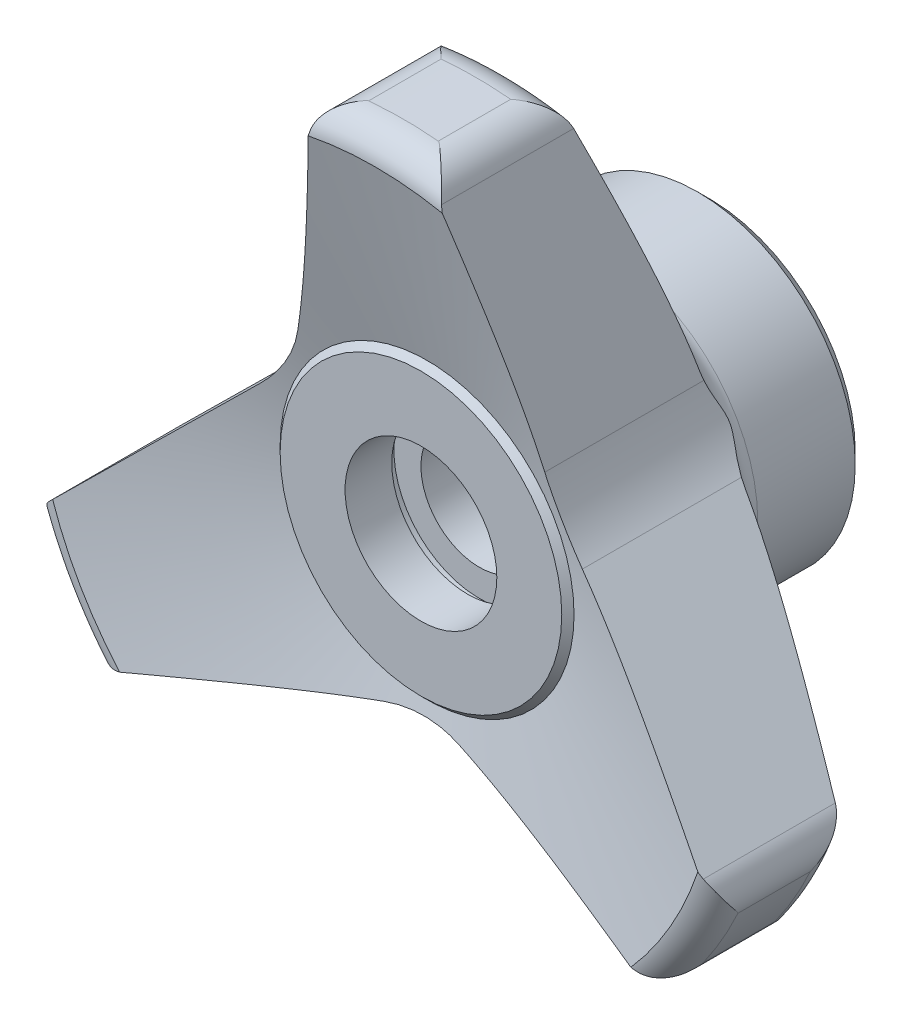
ISO-10303-21;
HEADER;
FILE_DESCRIPTION(('STEP AP214'),'2;1');
FILE_NAME('part.step','',(''),(''),'','','');
FILE_SCHEMA(('AUTOMOTIVE_DESIGN { 1 0 10303 214 1 1 1 1 }'));
ENDSEC;
DATA;
#1=APPLICATION_CONTEXT('core data for automotive mechanical design processes');
#2=APPLICATION_PROTOCOL_DEFINITION('international standard','automotive_design',2000,#1);
#3=PRODUCT_CONTEXT('',#1,'mechanical');
#4=PRODUCT('Part','Part','',(#3));
#5=PRODUCT_RELATED_PRODUCT_CATEGORY('part','',(#4));
#6=PRODUCT_DEFINITION_FORMATION('','',#4);
#7=PRODUCT_DEFINITION_CONTEXT('part definition',#1,'design');
#8=PRODUCT_DEFINITION('design','',#6,#7);
#9=PRODUCT_DEFINITION_SHAPE('','',#8);
#10=(LENGTH_UNIT() NAMED_UNIT(*) SI_UNIT(.MILLI.,.METRE.));
#11=(NAMED_UNIT(*) PLANE_ANGLE_UNIT() SI_UNIT($,.RADIAN.));
#12=(NAMED_UNIT(*) SI_UNIT($,.STERADIAN.) SOLID_ANGLE_UNIT());
#13=UNCERTAINTY_MEASURE_WITH_UNIT(LENGTH_MEASURE(1.E-05),#10,'distance_accuracy_value','');
#14=(GEOMETRIC_REPRESENTATION_CONTEXT(3) GLOBAL_UNCERTAINTY_ASSIGNED_CONTEXT((#13)) GLOBAL_UNIT_ASSIGNED_CONTEXT((#10,
#11,#12)) REPRESENTATION_CONTEXT('',''));
#15=CARTESIAN_POINT('',(0.,0.,0.));
#16=DIRECTION('',(0.,0.,1.));
#17=DIRECTION('',(1.,0.,0.));
#18=AXIS2_PLACEMENT_3D('',#15,#16,#17);
#19=CARTESIAN_POINT('',(0.,0.,11.5053506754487));
#20=DIRECTION('',(0.,0.,1.));
#21=DIRECTION('',(1.,0.,0.));
#22=AXIS2_PLACEMENT_3D('',#19,#20,#21);
#23=CONICAL_SURFACE('',#22,14.7507868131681,1.18682389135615);
#24=CARTESIAN_POINT('',(3.84351040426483,-14.2407350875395,11.5051506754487));
#25=CARTESIAN_POINT('',(4.14619590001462,-14.3250566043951,11.569916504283));
#26=CARTESIAN_POINT('',(4.44830271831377,-14.4092169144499,11.6375428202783));
#27=CARTESIAN_POINT('',(5.05138901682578,-14.577223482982,11.7779256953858));
#28=CARTESIAN_POINT('',(5.35236856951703,-14.6610697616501,11.8506819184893));
#29=CARTESIAN_POINT('',(5.95317832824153,-14.8284421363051,12.0007196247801));
#30=CARTESIAN_POINT('',(6.2530088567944,-14.9119683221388,12.0779997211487));
#31=CARTESIAN_POINT('',(6.85168127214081,-15.0787452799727,12.2365947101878));
#32=CARTESIAN_POINT('',(7.15052314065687,-15.1619960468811,12.3179096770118));
#33=CARTESIAN_POINT('',(8.04515556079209,-15.4112209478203,12.5670552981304));
#34=CARTESIAN_POINT('',(8.63957034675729,-15.5768118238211,12.7402176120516));
#35=CARTESIAN_POINT('',(9.82531039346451,-15.9071329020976,13.0977027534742));
#36=CARTESIAN_POINT('',(10.4166353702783,-16.0718630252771,13.2820265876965));
#37=CARTESIAN_POINT('',(11.5959120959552,-16.4003835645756,13.6592457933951));
#38=CARTESIAN_POINT('',(12.1838671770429,-16.5641749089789,13.8521299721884));
#39=CARTESIAN_POINT('',(13.3575791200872,-16.8911452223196,14.2448937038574));
#40=CARTESIAN_POINT('',(13.9433360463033,-17.0543242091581,14.4447730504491));
#41=CARTESIAN_POINT('',(15.113153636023,-17.3802096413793,14.8502060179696));
#42=CARTESIAN_POINT('',(15.697213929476,-17.5429159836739,15.0557607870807));
#43=CARTESIAN_POINT('',(16.8638205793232,-17.8679069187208,15.4714492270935));
#44=CARTESIAN_POINT('',(17.4463669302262,-18.0301915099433,15.6815829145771));
#45=CARTESIAN_POINT('',(18.3920326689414,-18.2936331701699,16.0261282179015));
#46=CARTESIAN_POINT('',(18.7555401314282,-18.3948983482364,16.1593944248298));
#47=CARTESIAN_POINT('',(19.4820847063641,-18.5972976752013,16.4272262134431));
#48=CARTESIAN_POINT('',(19.8451218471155,-18.6984318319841,16.561791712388));
#49=CARTESIAN_POINT('',(20.5709229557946,-18.9006240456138,16.8321346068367));
#50=CARTESIAN_POINT('',(20.9336867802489,-19.0016820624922,16.9679124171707));
#51=CARTESIAN_POINT('',(21.6588728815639,-19.2037029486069,17.2405215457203));
#52=CARTESIAN_POINT('',(22.0212951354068,-19.304665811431,17.3773529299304));
#53=CARTESIAN_POINT('',(22.3835543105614,-19.405583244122,17.5146469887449));
#54=B_SPLINE_CURVE_WITH_KNOTS('',3,(#24,#25,#26,#27,#28,#29,#30,#31,#32,#33,#34,#35,#36,#37,#38,
#39,#40,#41,#42,#43,#44,#45,#46,#47,#48,#49,#50,#51,#52,#53),.UNSPECIFIED.,.F.,.F.,(4,2,2,2,2,2,
2,2,2,2,2,2,2,2,4),(0.,0.962420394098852,1.92477780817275,2.88684173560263,3.84892335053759,
5.77142846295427,7.69410723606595,9.61434217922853,11.5345205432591,13.4550902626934,
15.3756669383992,16.5762353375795,17.7767277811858,18.9776480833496,20.1786442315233),.UNSPECIFIED.);
#55=CARTESIAN_POINT('',(3.84444519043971,-14.240995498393,11.5053506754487));
#56=VERTEX_POINT('',#55);
#57=CARTESIAN_POINT('',(22.3830266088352,-19.405436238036,17.514446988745));
#58=VERTEX_POINT('',#57);
#59=EDGE_CURVE('E319',#56,#58,#54,.T.);
#60=ORIENTED_EDGE('',*,*,#59,.F.);
#61=CARTESIAN_POINT('',(0.,0.,11.5053506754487));
#62=DIRECTION('',(0.,0.,1.));
#63=DIRECTION('',(1.,0.,0.));
#64=AXIS2_PLACEMENT_3D('',#61,#62,#63);
#65=CIRCLE('',#64,14.7507868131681);
#66=CARTESIAN_POINT('',(14.2552864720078,3.79111055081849,11.5053506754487));
#67=VERTEX_POINT('',#66);
#68=EDGE_CURVE('E535',#56,#67,#65,.T.);
#69=ORIENTED_EDGE('',*,*,#68,.T.);
#70=CARTESIAN_POINT('',(14.254593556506,3.791789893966,11.5051506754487));
#71=CARTESIAN_POINT('',(14.4789608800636,3.57181732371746,11.569916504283));
#72=CARTESIAN_POINT('',(14.702899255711,3.35226529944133,11.6375428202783));
#73=CARTESIAN_POINT('',(15.1499403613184,2.91398052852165,11.7779256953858));
#74=CARTESIAN_POINT('',(15.3730431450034,2.69524772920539,11.8506819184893));
#75=CARTESIAN_POINT('',(15.8183967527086,2.25861740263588,12.0007196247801));
#76=CARTESIAN_POINT('',(16.0406478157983,2.04071964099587,12.0779997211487));
#77=CARTESIAN_POINT('',(16.4844171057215,1.60564259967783,12.2365947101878));
#78=CARTESIAN_POINT('',(16.7059353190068,1.38846333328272,12.3179096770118));
#79=CARTESIAN_POINT('',(17.3690866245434,0.73830138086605,12.5670552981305));
#80=CARTESIAN_POINT('',(17.8096999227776,0.30631851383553,12.7402176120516));
#81=CARTESIAN_POINT('',(18.6886363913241,-0.555401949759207,13.0977027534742));
#82=CARTESIAN_POINT('',(19.126959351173,-0.985139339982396,13.2820265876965));
#83=CARTESIAN_POINT('',(20.0011048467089,-1.84216267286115,13.6592457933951));
#84=CARTESIAN_POINT('',(20.436929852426,-2.26945103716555,13.8521299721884));
#85=CARTESIAN_POINT('',(21.3069504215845,-3.12243023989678,14.2448937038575));
#86=CARTESIAN_POINT('',(21.7411460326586,-3.54812112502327,14.4447730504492));
#87=CARTESIAN_POINT('',(22.6082798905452,-4.3982701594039,14.8502060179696));
#88=CARTESIAN_POINT('',(23.0412178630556,-4.82272803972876,15.0557607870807));
#89=CARTESIAN_POINT('',(23.9059715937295,-5.67054356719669,15.4714492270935));
#90=CARTESIAN_POINT('',(24.3377873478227,-6.09390121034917,15.6815829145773));
#91=CARTESIAN_POINT('',(25.0387673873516,-6.78115093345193,16.0261282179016));
#92=CARTESIAN_POINT('',(25.3082193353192,-7.04532504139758,16.1593944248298));
#93=CARTESIAN_POINT('',(25.8467745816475,-7.57333143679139,16.4272262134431));
#94=CARTESIAN_POINT('',(26.1158779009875,-7.83716374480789,16.561791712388));
#95=CARTESIAN_POINT('',(26.6538820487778,-8.36462983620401,16.8321346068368));
#96=CARTESIAN_POINT('',(26.9227827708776,-8.62826351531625,16.9679124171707));
#97=CARTESIAN_POINT('',(27.4603310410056,-9.15528265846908,17.2405215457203));
#98=CARTESIAN_POINT('',(27.7289785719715,-9.4186681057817,17.3773529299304));
#99=CARTESIAN_POINT('',(27.9975052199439,-9.68193503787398,17.5146469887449));
#100=B_SPLINE_CURVE_WITH_KNOTS('',3,(#70,#71,#72,#73,#74,#75,#76,#77,#78,#79,#80,#81,#82,#83,
#84,#85,#86,#87,#88,#89,#90,#91,#92,#93,#94,#95,#96,#97,#98,#99),.UNSPECIFIED.,.F.,.F.,(4,2,2,2,
2,2,2,2,2,2,2,2,2,2,4),(0.,0.962420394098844,1.92477780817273,2.8868417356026,3.84892335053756,
5.77142846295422,7.69410723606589,9.61434217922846,11.534520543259,13.4550902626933,
15.3756669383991,16.5762353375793,17.7767277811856,18.9776480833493,20.178644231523),.UNSPECIFIED.);
#101=CARTESIAN_POINT('',(27.9971140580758,-9.6815515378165,17.514446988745));
#102=VERTEX_POINT('',#101);
#103=EDGE_CURVE('E310',#67,#102,#100,.T.);
#104=ORIENTED_EDGE('',*,*,#103,.T.);
#105=CARTESIAN_POINT('',(0.,0.,17.5144469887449));
#106=DIRECTION('',(0.,0.,1.));
#107=DIRECTION('',(1.,0.,0.));
#108=AXIS2_PLACEMENT_3D('',#105,#106,#107);
#109=CIRCLE('',#108,29.6238220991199);
#110=EDGE_CURVE('E533',#58,#102,#109,.T.);
#111=ORIENTED_EDGE('',*,*,#110,.F.);
#112=EDGE_LOOP('',(#60,#69,#104,#111));
#113=FACE_BOUND('',#112,.T.);
#114=ADVANCED_FACE('F14',(#113),#23,.T.);
#115=CARTESIAN_POINT('',(10.4110831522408,10.4489451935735,11.5051506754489));
#116=CARTESIAN_POINT('',(10.3327649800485,10.7532392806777,11.5699165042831));
#117=CARTESIAN_POINT('',(10.2545965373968,11.0569516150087,11.6375428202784));
#118=CARTESIAN_POINT('',(10.0985513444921,11.6632429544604,11.7779256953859));
#119=CARTESIAN_POINT('',(10.0206745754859,11.9658220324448,11.8506819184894));
#120=CARTESIAN_POINT('',(9.8652184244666,12.5698247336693,12.0007196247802));
#121=CARTESIAN_POINT('',(9.78763895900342,12.8712486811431,12.0779997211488));
#122=CARTESIAN_POINT('',(9.63273583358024,13.473102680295,12.2365947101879));
#123=CARTESIAN_POINT('',(9.55541217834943,13.7735327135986,12.3179096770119));
#124=CARTESIAN_POINT('',(9.32393106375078,14.6729195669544,12.5670552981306));
#125=CARTESIAN_POINT('',(9.17012957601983,15.2704933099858,12.7402176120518));
#126=CARTESIAN_POINT('',(8.86332599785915,16.462534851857,13.0977027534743));
#127=CARTESIAN_POINT('',(8.71032398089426,17.0570023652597,13.2820265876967));
#128=CARTESIAN_POINT('',(8.40519275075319,18.242546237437,13.6592457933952));
#129=CARTESIAN_POINT('',(8.25306267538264,18.8336259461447,13.8521299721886));
#130=CARTESIAN_POINT('',(7.94937130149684,20.0135754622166,14.2448937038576));
#131=CARTESIAN_POINT('',(7.79780998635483,20.6024453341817,14.4447730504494));
#132=CARTESIAN_POINT('',(7.49512625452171,21.7784798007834,14.8502060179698));
#133=CARTESIAN_POINT('',(7.34400393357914,22.3656440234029,15.0557607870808));
#134=CARTESIAN_POINT('',(7.04215101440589,23.5384504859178,15.4714492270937));
#135=CARTESIAN_POINT('',(6.89142041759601,24.124092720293,15.6815829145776));
#136=CARTESIAN_POINT('',(6.64673471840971,25.0747841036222,16.0261282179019));
#137=CARTESIAN_POINT('',(6.55267920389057,25.4402233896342,16.15939442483));
#138=CARTESIAN_POINT('',(6.36468987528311,26.1706291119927,16.4272262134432));
#139=CARTESIAN_POINT('',(6.27075605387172,26.5355955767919,16.5617917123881));
#140=CARTESIAN_POINT('',(6.08295909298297,27.2652538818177,16.8321346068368));
#141=CARTESIAN_POINT('',(5.98909599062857,27.6299455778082,16.9679124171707));
#142=CARTESIAN_POINT('',(5.80145815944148,28.3589856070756,17.2405215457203));
#143=CARTESIAN_POINT('',(5.70768343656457,28.7233339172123,17.3773529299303));
#144=CARTESIAN_POINT('',(5.61395090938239,29.0875182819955,17.5146469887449));
#145=B_SPLINE_CURVE_WITH_KNOTS('',3,(#115,#116,#117,#118,#119,#120,#121,#122,#123,#124,#125,
#126,#127,#128,#129,#130,#131,#132,#133,#134,#135,#136,#137,#138,#139,#140,#141,#142,#143,#144),
.UNSPECIFIED.,.F.,.F.,(4,2,2,2,2,2,2,2,2,2,2,2,2,2,4),(0.,0.962420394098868,1.92477780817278,
2.88684173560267,3.84892335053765,5.77142846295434,7.69410723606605,9.61434217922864,
11.5345205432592,13.4550902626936,15.3756669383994,16.5762353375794,17.7767277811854,
18.9776480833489,20.1786442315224),.UNSPECIFIED.);
#146=CARTESIAN_POINT('',(10.4108412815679,10.449884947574,11.5053506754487));
#147=VERTEX_POINT('',#146);
#148=CARTESIAN_POINT('',(5.61408744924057,29.086987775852,17.514446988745));
#149=VERTEX_POINT('',#148);
#150=EDGE_CURVE('E301',#147,#149,#145,.T.);
#151=ORIENTED_EDGE('',*,*,#150,.F.);
#152=CARTESIAN_POINT('',(-10.4108412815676,10.4498849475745,11.5053506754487));
#153=VERTEX_POINT('',#152);
#154=EDGE_CURVE('E542',#147,#153,#65,.T.);
#155=ORIENTED_EDGE('',*,*,#154,.T.);
#156=CARTESIAN_POINT('',(-10.4110831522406,10.448945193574,11.5051506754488));
#157=CARTESIAN_POINT('',(-10.3327649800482,10.7532392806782,11.5699165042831));
#158=CARTESIAN_POINT('',(-10.2545965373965,11.0569516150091,11.6375428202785));
#159=CARTESIAN_POINT('',(-10.0985513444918,11.6632429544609,11.777925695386));
#160=CARTESIAN_POINT('',(-10.0206745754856,11.9658220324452,11.8506819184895));
#161=CARTESIAN_POINT('',(-9.8652184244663,12.5698247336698,12.0007196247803));
#162=CARTESIAN_POINT('',(-9.78763895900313,12.8712486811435,12.0779997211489));
#163=CARTESIAN_POINT('',(-9.63273583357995,13.4731026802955,12.236594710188));
#164=CARTESIAN_POINT('',(-9.55541217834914,13.773532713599,12.317909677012));
#165=CARTESIAN_POINT('',(-9.3239310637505,14.6729195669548,12.5670552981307));
#166=CARTESIAN_POINT('',(-9.17012957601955,15.2704933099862,12.7402176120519));
#167=CARTESIAN_POINT('',(-8.86332599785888,16.4625348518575,13.0977027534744));
#168=CARTESIAN_POINT('',(-8.710323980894,17.0570023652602,13.2820265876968));
#169=CARTESIAN_POINT('',(-8.40519275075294,18.2425462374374,13.6592457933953));
#170=CARTESIAN_POINT('',(-8.25306267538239,18.8336259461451,13.8521299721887));
#171=CARTESIAN_POINT('',(-7.9493713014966,20.013575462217,14.2448937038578));
#172=CARTESIAN_POINT('',(-7.7978099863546,20.6024453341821,14.4447730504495));
#173=CARTESIAN_POINT('',(-7.49512625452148,21.7784798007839,14.8502060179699));
#174=CARTESIAN_POINT('',(-7.34400393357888,22.3656440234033,15.055760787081));
#175=CARTESIAN_POINT('',(-7.0421510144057,23.5384504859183,15.4714492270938));
#176=CARTESIAN_POINT('',(-6.89142041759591,24.1240927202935,15.6815829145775));
#177=CARTESIAN_POINT('',(-6.64673471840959,25.0747841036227,16.0261282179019));
#178=CARTESIAN_POINT('',(-6.55267920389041,25.4402233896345,16.1593944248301));
#179=CARTESIAN_POINT('',(-6.36468987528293,26.1706291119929,16.4272262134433));
#180=CARTESIAN_POINT('',(-6.27075605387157,26.5355955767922,16.5617917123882));
#181=CARTESIAN_POINT('',(-6.08295909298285,27.2652538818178,16.8321346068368));
#182=CARTESIAN_POINT('',(-5.98909599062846,27.6299455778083,16.9679124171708));
#183=CARTESIAN_POINT('',(-5.8014581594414,28.3589856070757,17.2405215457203));
#184=CARTESIAN_POINT('',(-5.70768343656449,28.7233339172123,17.3773529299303));
#185=CARTESIAN_POINT('',(-5.61395090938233,29.0875182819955,17.5146469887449));
#186=B_SPLINE_CURVE_WITH_KNOTS('',3,(#156,#157,#158,#159,#160,#161,#162,#163,#164,#165,#166,
#167,#168,#169,#170,#171,#172,#173,#174,#175,#176,#177,#178,#179,#180,#181,#182,#183,#184,#185),
.UNSPECIFIED.,.F.,.F.,(4,2,2,2,2,2,2,2,2,2,2,2,2,2,4),(0.,0.962420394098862,1.92477780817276,
2.88684173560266,3.84892335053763,5.77142846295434,7.69410723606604,9.61434217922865,
11.5345205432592,13.4550902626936,15.3756669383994,16.5762353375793,17.7767277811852,
18.9776480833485,20.1786442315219),.UNSPECIFIED.);
#187=CARTESIAN_POINT('',(-5.6140874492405,29.086987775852,17.514446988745));
#188=VERTEX_POINT('',#187);
#189=EDGE_CURVE('E292',#153,#188,#186,.T.);
#190=ORIENTED_EDGE('',*,*,#189,.T.);
#191=EDGE_CURVE('E532',#149,#188,#109,.T.);
#192=ORIENTED_EDGE('',*,*,#191,.F.);
#193=EDGE_LOOP('',(#151,#155,#190,#192));
#194=FACE_BOUND('',#193,.T.);
#195=ADVANCED_FACE('F281',(#194),#23,.T.);
#196=CARTESIAN_POINT('',(0.,0.,20.2959976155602));
#197=DIRECTION('',(0.,0.,1.));
#198=DIRECTION('',(1.,0.,0.));
#199=AXIS2_PLACEMENT_3D('',#196,#197,#198);
#200=TOROIDAL_SURFACE('',#199,28.5,3.00000000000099);
#201=CARTESIAN_POINT('',(-25.6647460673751,-18.2639209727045,20.2959976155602));
#202=CARTESIAN_POINT('',(-25.6631333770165,-18.2661871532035,20.2933519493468));
#203=CARTESIAN_POINT('',(-25.661517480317,-18.2684511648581,20.2907061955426));
#204=CARTESIAN_POINT('',(-25.5283394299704,-18.454497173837,20.0730745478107));
#205=CARTESIAN_POINT('',(-25.3756397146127,-18.6239145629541,19.8575536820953));
#206=CARTESIAN_POINT('',(-25.118043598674,-18.8509682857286,19.5383719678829));
#207=CARTESIAN_POINT('',(-25.0272389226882,-18.9222402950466,19.4324821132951));
#208=CARTESIAN_POINT('',(-24.836396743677,-19.0547767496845,19.2227976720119));
#209=CARTESIAN_POINT('',(-24.7363635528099,-19.1160458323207,19.1190021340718));
#210=CARTESIAN_POINT('',(-24.4734720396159,-19.2562175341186,18.8615580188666));
#211=CARTESIAN_POINT('',(-24.3048116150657,-19.3279269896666,18.7097948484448));
#212=CARTESIAN_POINT('',(-23.9487321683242,-19.4407383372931,18.4173019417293));
#213=CARTESIAN_POINT('',(-23.7613404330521,-19.4818840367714,18.2765566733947));
#214=CARTESIAN_POINT('',(-23.417857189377,-19.5217160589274,18.0441248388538));
#215=CARTESIAN_POINT('',(-23.2651465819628,-19.5282607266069,17.9488026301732));
#216=CARTESIAN_POINT('',(-22.9530816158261,-19.5166033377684,17.7720286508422));
#217=CARTESIAN_POINT('',(-22.793754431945,-19.4984943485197,17.6905260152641));
#218=CARTESIAN_POINT('',(-22.5606920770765,-19.4519850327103,17.5859012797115));
#219=CARTESIAN_POINT('',(-22.4879727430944,-19.434687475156,17.5552878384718));
#220=CARTESIAN_POINT('',(-22.4152062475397,-19.4144007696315,17.5268359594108));
#221=B_SPLINE_CURVE_WITH_KNOTS('',3,(#201,#202,#203,#204,#205,#206,#207,#208,#209,#210,#211,
#212,#213,#214,#215,#216,#217,#218,#219,#220),.UNSPECIFIED.,.F.,.F.,(4,2,2,2,2,2,2,2,2,4),(0.,
0.0115165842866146,0.94729012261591,1.41680055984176,1.88609271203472,2.5973213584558,
3.30752861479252,3.84609137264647,4.38262668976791,4.62469734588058),.UNSPECIFIED.);
#222=CARTESIAN_POINT('',(-25.6647460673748,-18.263920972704,20.2959999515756));
#223=VERTEX_POINT('',#222);
#224=CARTESIAN_POINT('',(-22.4154062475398,-19.414456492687,17.5269141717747));
#225=VERTEX_POINT('',#224);
#226=EDGE_CURVE('E673',#223,#225,#221,.T.);
#227=ORIENTED_EDGE('',*,*,#226,.F.);
#228=CARTESIAN_POINT('',(0.,0.,20.2959999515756));
#229=DIRECTION('',(0.,0.,1.));
#230=DIRECTION('',(1.,0.,0.));
#231=AXIS2_PLACEMENT_3D('',#228,#229,#230);
#232=CIRCLE('',#231,31.5);
#233=CARTESIAN_POINT('',(-28.6493925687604,-13.0943615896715,20.2959999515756));
#234=VERTEX_POINT('',#233);
#235=EDGE_CURVE('E695',#234,#223,#232,.T.);
#236=ORIENTED_EDGE('',*,*,#235,.F.);
#237=CARTESIAN_POINT('',(-28.0209116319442,-9.7048830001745,17.5268065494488));
#238=CARTESIAN_POINT('',(-28.0831503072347,-9.76589174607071,17.5596373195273));
#239=CARTESIAN_POINT('',(-28.1418835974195,-9.82877981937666,17.5953104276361));
#240=CARTESIAN_POINT('',(-28.2523387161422,-9.95744603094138,17.6715379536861));
#241=CARTESIAN_POINT('',(-28.304073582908,-10.0232184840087,17.7120830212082));
#242=CARTESIAN_POINT('',(-28.4481148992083,-10.2225432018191,17.8391503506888));
#243=CARTESIAN_POINT('',(-28.5305327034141,-10.359389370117,17.9318113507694));
#244=CARTESIAN_POINT('',(-28.6884638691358,-10.6730361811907,18.1542512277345));
#245=CARTESIAN_POINT('',(-28.7566776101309,-10.8510160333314,18.2874316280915));
#246=CARTESIAN_POINT('',(-28.8579486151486,-11.2083081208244,18.5664805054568));
#247=CARTESIAN_POINT('',(-28.8908109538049,-11.3876223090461,18.7124145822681));
#248=CARTESIAN_POINT('',(-28.9184484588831,-11.6801519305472,18.9592809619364));
#249=CARTESIAN_POINT('',(-28.9225460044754,-11.7944665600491,19.0580202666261));
#250=CARTESIAN_POINT('',(-28.9179986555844,-12.0207506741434,19.2578863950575));
#251=CARTESIAN_POINT('',(-28.9093490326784,-12.1327192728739,19.3590140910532));
#252=CARTESIAN_POINT('',(-28.8653285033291,-12.4633324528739,19.6642754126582));
#253=CARTESIAN_POINT('',(-28.8119561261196,-12.6775459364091,19.8710161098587));
#254=CARTESIAN_POINT('',(-28.7111830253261,-12.9516510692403,20.1481039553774));
#255=CARTESIAN_POINT('',(-28.6832493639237,-13.019765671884,20.2180766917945));
#256=CARTESIAN_POINT('',(-28.6517015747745,-13.089300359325,20.2907060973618));
#257=CARTESIAN_POINT('',(-28.6505488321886,-13.0918317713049,20.2933518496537));
#258=CARTESIAN_POINT('',(-28.6493925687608,-13.094361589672,20.2959976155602));
#259=B_SPLINE_CURVE_WITH_KNOTS('',3,(#237,#238,#239,#240,#241,#242,#243,#244,#245,#246,#247,
#248,#249,#250,#251,#252,#253,#254,#255,#256,#257,#258),.UNSPECIFIED.,.F.,.F.,(4,2,2,2,2,2,2,2,
2,2,4),(0.,0.279093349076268,0.557659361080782,1.10904884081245,1.8030557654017,
2.50087008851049,2.95363748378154,3.40657287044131,4.30909224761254,4.61372302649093,
4.62523961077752),.UNSPECIFIED.);
#260=CARTESIAN_POINT('',(-28.0211156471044,-9.70508300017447,17.5269141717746));
#261=VERTEX_POINT('',#260);
#262=EDGE_CURVE('E643',#261,#234,#259,.T.);
#263=ORIENTED_EDGE('',*,*,#262,.F.);
#264=CARTESIAN_POINT('',(-27.1608204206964,-8.8616386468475,17.2968119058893));
#265=CARTESIAN_POINT('',(-27.2352314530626,-8.93459216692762,17.2989935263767));
#266=CARTESIAN_POINT('',(-27.3095471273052,-9.00745219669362,17.3055282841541));
#267=CARTESIAN_POINT('',(-27.4575421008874,-9.15254834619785,17.3273686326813));
#268=CARTESIAN_POINT('',(-27.5312211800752,-9.22478425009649,17.3426771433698));
#269=CARTESIAN_POINT('',(-27.7462312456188,-9.43558284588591,17.4006858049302));
#270=CARTESIAN_POINT('',(-27.8859959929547,-9.57260997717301,17.4556063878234));
#271=CARTESIAN_POINT('',(-28.1427993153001,-9.82438321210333,17.5911312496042));
#272=CARTESIAN_POINT('',(-28.2607000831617,-9.93997462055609,17.6685332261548));
#273=CARTESIAN_POINT('',(-28.4310997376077,-10.107036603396,17.8050506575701));
#274=CARTESIAN_POINT('',(-28.4875124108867,-10.162344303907,17.8547437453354));
#275=CARTESIAN_POINT('',(-28.59712803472,-10.2698128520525,17.9607279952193));
#276=CARTESIAN_POINT('',(-28.6503291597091,-10.3219719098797,18.0170228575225));
#277=CARTESIAN_POINT('',(-28.7016891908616,-10.372325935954,18.0765149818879));
#278=B_SPLINE_CURVE_WITH_KNOTS('',3,(#264,#265,#266,#267,#268,#269,#270,#271,#272,#273,#274,
#275,#276,#277),.UNSPECIFIED.,.F.,.F.,(4,2,2,2,2,2,4),(0.,0.312510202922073,0.625124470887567,
1.23184385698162,1.77649419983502,2.05618088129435,2.33602507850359),.UNSPECIFIED.);
#279=CARTESIAN_POINT('',(-27.9971140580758,-9.6815515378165,17.514446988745));
#280=VERTEX_POINT('',#279);
#281=EDGE_CURVE('E209',#280,#261,#278,.T.);
#282=ORIENTED_EDGE('',*,*,#281,.F.);
#283=CARTESIAN_POINT('',(-22.3830266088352,-19.405436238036,17.514446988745));
#284=VERTEX_POINT('',#283);
#285=EDGE_CURVE('E528',#280,#284,#109,.T.);
#286=ORIENTED_EDGE('',*,*,#285,.T.);
#287=CARTESIAN_POINT('',(-22.3824987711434,-19.405289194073,17.5142469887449));
#288=CARTESIAN_POINT('',(-22.3880273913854,-19.4068293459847,17.5163412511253));
#289=CARTESIAN_POINT('',(-22.3935506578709,-19.4083680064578,17.5184504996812));
#290=CARTESIAN_POINT('',(-22.4045864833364,-19.4114423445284,17.5226989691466));
#291=CARTESIAN_POINT('',(-22.4100990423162,-19.4129780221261,17.5248381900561));
#292=CARTESIAN_POINT('',(-22.4156062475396,-19.414512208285,17.5269923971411));
#293=B_SPLINE_CURVE_WITH_KNOTS('',3,(#287,#288,#289,#290,#291,#292),.UNSPECIFIED.,.F.,.F.,(4,2,
4),(0.,0.0183277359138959,0.0366554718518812),.UNSPECIFIED.);
#294=EDGE_CURVE('E628',#284,#225,#293,.T.);
#295=ORIENTED_EDGE('',*,*,#294,.T.);
#296=EDGE_LOOP('',(#227,#236,#263,#282,#286,#295));
#297=FACE_BOUND('',#296,.T.);
#298=ADVANCED_FACE('F282',(#297),#200,.T.);
#299=CARTESIAN_POINT('',(21.2547294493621,-19.091117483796,17.2968100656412));
#300=CARTESIAN_POINT('',(21.3551150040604,-19.1190826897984,17.2989892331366));
#301=CARTESIAN_POINT('',(21.4553720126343,-19.1470120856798,17.3055215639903));
#302=CARTESIAN_POINT('',(21.6550277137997,-19.2026317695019,17.3273571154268));
#303=CARTESIAN_POINT('',(21.7544261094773,-19.2303219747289,17.3426632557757));
#304=CARTESIAN_POINT('',(22.0444905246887,-19.3111275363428,17.400665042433));
#305=CARTESIAN_POINT('',(22.2330438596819,-19.3636543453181,17.4555812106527));
#306=CARTESIAN_POINT('',(22.5794925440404,-19.4601673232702,17.5910982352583));
#307=CARTESIAN_POINT('',(22.7385509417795,-19.5044774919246,17.6684968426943));
#308=CARTESIAN_POINT('',(22.9684354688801,-19.5685182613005,17.8050095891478));
#309=CARTESIAN_POINT('',(23.0445413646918,-19.5897196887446,17.8547011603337));
#310=CARTESIAN_POINT('',(23.1924231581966,-19.6309163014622,17.9606825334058));
#311=CARTESIAN_POINT('',(23.2641965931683,-19.6509108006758,18.016976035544));
#312=CARTESIAN_POINT('',(23.3334863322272,-19.6702133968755,18.0764668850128));
#313=B_SPLINE_CURVE_WITH_KNOTS('',3,(#299,#300,#301,#302,#303,#304,#305,#306,#307,#308,#309,
#310,#311,#312),.UNSPECIFIED.,.F.,.F.,(4,2,2,2,2,2,4),(0.,0.312511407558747,0.625126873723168,
1.23184863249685,1.77650289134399,2.0561915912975,2.33603780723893),.UNSPECIFIED.);
#314=CARTESIAN_POINT('',(22.4154062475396,-19.414456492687,17.5269141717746));
#315=VERTEX_POINT('',#314);
#316=EDGE_CURVE('E328',#58,#315,#313,.T.);
#317=ORIENTED_EDGE('',*,*,#316,.F.);
#318=ORIENTED_EDGE('',*,*,#110,.T.);
#319=CARTESIAN_POINT('',(27.1608204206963,-8.8616386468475,17.2968119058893));
#320=CARTESIAN_POINT('',(27.2352314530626,-8.93459216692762,17.2989935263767));
#321=CARTESIAN_POINT('',(27.3095471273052,-9.00745219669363,17.3055282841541));
#322=CARTESIAN_POINT('',(27.4575421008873,-9.15254834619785,17.3273686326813));
#323=CARTESIAN_POINT('',(27.5312211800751,-9.22478425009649,17.3426771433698));
#324=CARTESIAN_POINT('',(27.7462312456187,-9.43558284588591,17.4006858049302));
#325=CARTESIAN_POINT('',(27.8859959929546,-9.57260997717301,17.4556063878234));
#326=CARTESIAN_POINT('',(28.1427993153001,-9.82438321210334,17.5911312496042));
#327=CARTESIAN_POINT('',(28.2607000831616,-9.9399746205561,17.6685332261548));
#328=CARTESIAN_POINT('',(28.4310997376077,-10.107036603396,17.8050506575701));
#329=CARTESIAN_POINT('',(28.4875124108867,-10.162344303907,17.8547437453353));
#330=CARTESIAN_POINT('',(28.59712803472,-10.2698128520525,17.9607279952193));
#331=CARTESIAN_POINT('',(28.6503291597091,-10.3219719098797,18.0170228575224));
#332=CARTESIAN_POINT('',(28.7016891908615,-10.372325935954,18.0765149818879));
#333=B_SPLINE_CURVE_WITH_KNOTS('',3,(#319,#320,#321,#322,#323,#324,#325,#326,#327,#328,#329,
#330,#331,#332),.UNSPECIFIED.,.F.,.F.,(4,2,2,2,2,2,4),(0.,0.312510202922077,0.625124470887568,
1.23184385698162,1.77649419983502,2.05618088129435,2.3360250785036),.UNSPECIFIED.);
#334=CARTESIAN_POINT('',(28.0211156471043,-9.70508300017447,17.5269141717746));
#335=VERTEX_POINT('',#334);
#336=EDGE_CURVE('E399',#102,#335,#333,.T.);
#337=ORIENTED_EDGE('',*,*,#336,.T.);
#338=CARTESIAN_POINT('',(28.6493925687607,-13.094361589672,20.2959976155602));
#339=CARTESIAN_POINT('',(28.6505487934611,-13.0918318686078,20.2933519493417));
#340=CARTESIAN_POINT('',(28.6517015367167,-13.0893004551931,20.2907061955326));
#341=CARTESIAN_POINT('',(28.7462330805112,-12.8809418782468,20.073074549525));
#342=CARTESIAN_POINT('',(28.8166029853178,-12.6639913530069,19.857553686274));
#343=CARTESIAN_POINT('',(28.8844392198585,-12.3273797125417,19.5383719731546));
#344=CARTESIAN_POINT('',(28.9007602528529,-12.2131045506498,19.432482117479));
#345=CARTESIAN_POINT('',(28.9201191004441,-11.9815621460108,19.2227976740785));
#346=CARTESIAN_POINT('',(28.9231630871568,-11.8642963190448,19.1190021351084));
#347=CARTESIAN_POINT('',(28.9131095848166,-11.5665397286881,18.8615580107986));
#348=CARTESIAN_POINT('',(28.8908815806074,-11.3846207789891,18.709794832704));
#349=CARTESIAN_POINT('',(28.8105393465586,-11.0198412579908,18.4173019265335));
#350=CARTESIAN_POINT('',(28.7524767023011,-10.8369824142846,18.2765566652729));
#351=CARTESIAN_POINT('',(28.6152313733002,-10.5196029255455,18.0441261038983));
#352=CARTESIAN_POINT('',(28.5445449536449,-10.3840810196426,17.9488050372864));
#353=CARTESIAN_POINT('',(28.3784195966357,-10.1196566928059,17.7720329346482));
#354=CARTESIAN_POINT('',(28.2830748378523,-9.9907312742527,17.6905310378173));
#355=CARTESIAN_POINT('',(28.1262481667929,-9.81212688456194,17.58589349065));
#356=CARTESIAN_POINT('',(28.0748870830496,-9.75777745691,17.5552683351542));
#357=CARTESIAN_POINT('',(28.0209116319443,-9.7048830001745,17.5268065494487));
#358=B_SPLINE_CURVE_WITH_KNOTS('',3,(#338,#339,#340,#341,#342,#343,#344,#345,#346,#347,#348,
#349,#350,#351,#352,#353,#354,#355,#356,#357),.UNSPECIFIED.,.F.,.F.,(4,2,2,2,2,2,2,2,2,4),(0.,
0.0115165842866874,0.947290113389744,1.4168005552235,1.88609271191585,2.59732139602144,
3.30752861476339,3.84608458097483,4.38261323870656,4.62478073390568),.UNSPECIFIED.);
#359=CARTESIAN_POINT('',(28.6493925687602,-13.0943615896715,20.2959999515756));
#360=VERTEX_POINT('',#359);
#361=EDGE_CURVE('E661',#360,#335,#358,.T.);
#362=ORIENTED_EDGE('',*,*,#361,.F.);
#363=CARTESIAN_POINT('',(25.6647460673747,-18.263920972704,20.2959999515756));
#364=VERTEX_POINT('',#363);
#365=EDGE_CURVE('E690',#364,#360,#232,.T.);
#366=ORIENTED_EDGE('',*,*,#365,.F.);
#367=CARTESIAN_POINT('',(22.4152062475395,-19.4144007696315,17.5268359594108));
#368=CARTESIAN_POINT('',(22.4991625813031,-19.4377948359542,17.5596691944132));
#369=CARTESIAN_POINT('',(22.5829936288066,-19.4572133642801,17.5953447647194));
#370=CARTESIAN_POINT('',(22.7496525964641,-19.4885330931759,17.6715771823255));
#371=CARTESIAN_POINT('',(22.8324821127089,-19.5004484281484,17.7121246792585));
#372=CARTESIAN_POINT('',(23.0771270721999,-19.5255228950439,17.8391991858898));
#373=CARTESIAN_POINT('',(23.2368504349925,-19.5284710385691,17.931864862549));
#374=CARTESIAN_POINT('',(23.587446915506,-19.5084090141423,18.1543155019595));
#375=CARTESIAN_POINT('',(23.775691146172,-19.4784873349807,18.28750198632));
#376=CARTESIAN_POINT('',(24.1357539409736,-19.3875307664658,18.5665627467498));
#377=CARTESIAN_POINT('',(24.3074767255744,-19.3263260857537,18.7125026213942));
#378=CARTESIAN_POINT('',(24.5746327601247,-19.2039844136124,18.9593770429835));
#379=CARTESIAN_POINT('',(24.6756796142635,-19.150371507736,19.0581186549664));
#380=CARTESIAN_POINT('',(24.8693707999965,-19.0332830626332,19.2579891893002));
#381=CARTESIAN_POINT('',(24.9620119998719,-18.9698038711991,19.3591189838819));
#382=CARTESIAN_POINT('',(25.226315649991,-18.7663622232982,19.664386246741));
#383=CARTESIAN_POINT('',(25.3851394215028,-18.6130256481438,19.8711305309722));
#384=CARTESIAN_POINT('',(25.5721008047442,-18.3887230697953,20.1481823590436));
#385=CARTESIAN_POINT('',(25.6170964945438,-18.3305062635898,20.2181158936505));
#386=CARTESIAN_POINT('',(25.6615174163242,-18.2684512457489,20.2907060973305));
#387=CARTESIAN_POINT('',(25.6631333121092,-18.2661872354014,20.293351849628));
#388=CARTESIAN_POINT('',(25.6647460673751,-18.2639209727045,20.2959976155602));
#389=B_SPLINE_CURVE_WITH_KNOTS('',3,(#367,#368,#369,#370,#371,#372,#373,#374,#375,#376,#377,
#378,#379,#380,#381,#382,#383,#384,#385,#386,#387,#388),.UNSPECIFIED.,.F.,.F.,(4,2,2,2,2,2,2,2,
2,2,4),(0.,0.279099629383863,0.557671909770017,1.10907389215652,1.80309928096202,
2.50093220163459,2.95370596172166,3.40664772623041,4.30917943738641,4.61363957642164,
4.62515616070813),.UNSPECIFIED.);
#390=EDGE_CURVE('E667',#315,#364,#389,.T.);
#391=ORIENTED_EDGE('',*,*,#390,.F.);
#392=EDGE_LOOP('',(#317,#318,#337,#362,#366,#391));
#393=FACE_BOUND('',#392,.T.);
#394=ADVANCED_FACE('F747',(#393),#200,.T.);
#395=CARTESIAN_POINT('',(5.61422402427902,29.0864571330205,17.514246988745));
#396=CARTESIAN_POINT('',(5.61279357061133,29.092014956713,17.5163411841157));
#397=CARTESIAN_POINT('',(5.61136450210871,29.0975673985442,17.5184503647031));
#398=CARTESIAN_POINT('',(5.60850913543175,29.1086615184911,17.5226986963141));
#399=CARTESIAN_POINT('',(5.60708283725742,29.1142031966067,17.5248378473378));
#400=CARTESIAN_POINT('',(5.60565792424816,29.119739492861,17.5269919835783));
#401=B_SPLINE_CURVE_WITH_KNOTS('',3,(#395,#396,#397,#398,#399,#400),.UNSPECIFIED.,.F.,.F.,(4,2,
4),(0.,0.0183271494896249,0.0366542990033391),.UNSPECIFIED.);
#402=CARTESIAN_POINT('',(5.60570939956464,29.119539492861,17.5269141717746));
#403=VERTEX_POINT('',#402);
#404=EDGE_CURVE('E455',#149,#403,#401,.T.);
#405=ORIENTED_EDGE('',*,*,#404,.F.);
#406=ORIENTED_EDGE('',*,*,#191,.T.);
#407=CARTESIAN_POINT('',(-5.61422402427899,29.0864571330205,17.5142469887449));
#408=CARTESIAN_POINT('',(-5.61279357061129,29.092014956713,17.5163411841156));
#409=CARTESIAN_POINT('',(-5.61136450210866,29.0975673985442,17.518450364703));
#410=CARTESIAN_POINT('',(-5.60850913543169,29.108661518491,17.5226986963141));
#411=CARTESIAN_POINT('',(-5.60708283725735,29.1142031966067,17.5248378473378));
#412=CARTESIAN_POINT('',(-5.6056579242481,29.119739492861,17.5269919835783));
#413=B_SPLINE_CURVE_WITH_KNOTS('',3,(#407,#408,#409,#410,#411,#412),.UNSPECIFIED.,.F.,.F.,(4,2,
4),(0.,0.0183271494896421,0.036654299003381),.UNSPECIFIED.);
#414=CARTESIAN_POINT('',(-5.60570939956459,29.119539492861,17.5269141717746));
#415=VERTEX_POINT('',#414);
#416=EDGE_CURVE('E471',#188,#415,#413,.T.);
#417=ORIENTED_EDGE('',*,*,#416,.T.);
#418=CARTESIAN_POINT('',(-2.98464650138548,31.3582825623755,20.2959976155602));
#419=CARTESIAN_POINT('',(-2.98741541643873,31.3580190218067,20.2933519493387));
#420=CARTESIAN_POINT('',(-2.99018405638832,31.3577516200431,20.2907061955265));
#421=CARTESIAN_POINT('',(-3.21789365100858,31.3354390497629,20.0730745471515));
#422=CARTESIAN_POINT('',(-3.44096327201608,31.2879059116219,19.8575536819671));
#423=CARTESIAN_POINT('',(-3.76639562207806,31.1783479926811,19.5383719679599));
#424=CARTESIAN_POINT('',(-3.87352133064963,31.1353448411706,19.432482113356));
#425=CARTESIAN_POINT('',(-4.08372235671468,31.0363388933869,19.2227976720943));
#426=CARTESIAN_POINT('',(-4.18679953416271,30.9803421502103,19.1190021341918));
#427=CARTESIAN_POINT('',(-4.43963754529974,30.8227572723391,18.8615580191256));
#428=CARTESIAN_POINT('',(-4.58606996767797,30.7125477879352,18.7097948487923));
#429=CARTESIAN_POINT('',(-4.86180718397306,30.4605796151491,18.4173019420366));
#430=CARTESIAN_POINT('',(-4.99113627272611,30.3188664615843,18.2765566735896));
#431=CARTESIAN_POINT('',(-5.19737345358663,30.0413172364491,18.044124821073));
#432=CARTESIAN_POINT('',(-5.27939661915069,29.9123382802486,17.9488025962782));
#433=CARTESIAN_POINT('',(-5.42533352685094,29.6362533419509,17.7720285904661));
#434=CARTESIAN_POINT('',(-5.48931428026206,29.4892174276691,17.6905259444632));
#435=CARTESIAN_POINT('',(-5.56556707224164,29.2641252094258,17.585901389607));
#436=CARTESIAN_POINT('',(-5.58694650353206,29.1925000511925,17.5552881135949));
#437=CARTESIAN_POINT('',(-5.6057608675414,29.119339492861,17.5268363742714));
#438=B_SPLINE_CURVE_WITH_KNOTS('',3,(#418,#419,#420,#421,#422,#423,#424,#425,#426,#427,#428,
#429,#430,#431,#432,#433,#434,#435,#436,#437),.UNSPECIFIED.,.F.,.F.,(4,2,2,2,2,2,2,2,2,4),(0.,
0.0115165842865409,0.947290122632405,1.41680055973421,1.88609271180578,2.59732135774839,
3.30752861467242,3.84609146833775,4.38262687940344,4.62469616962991),.UNSPECIFIED.);
#439=CARTESIAN_POINT('',(-2.98464650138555,31.358282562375,20.2959999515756));
#440=VERTEX_POINT('',#439);
#441=EDGE_CURVE('E649',#440,#415,#438,.T.);
#442=ORIENTED_EDGE('',*,*,#441,.F.);
#443=CARTESIAN_POINT('',(2.98464650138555,31.358282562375,20.2959999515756));
#444=VERTEX_POINT('',#443);
#445=EDGE_CURVE('E536',#444,#440,#232,.T.);
#446=ORIENTED_EDGE('',*,*,#445,.F.);
#447=CARTESIAN_POINT('',(5.60576086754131,29.119339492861,17.5268363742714));
#448=CARTESIAN_POINT('',(5.58404252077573,29.2037448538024,17.5596696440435));
#449=CARTESIAN_POINT('',(5.5589438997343,29.286053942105,17.5953452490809));
#450=CARTESIAN_POINT('',(5.50273802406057,29.4460447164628,17.6715777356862));
#451=CARTESIAN_POINT('',(5.47164221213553,29.523734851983,17.7121252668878));
#452=CARTESIAN_POINT('',(5.37103474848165,29.7481408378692,17.8391998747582));
#453=CARTESIAN_POINT('',(5.29372616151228,29.8879393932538,17.931865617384));
#454=CARTESIAN_POINT('',(5.10105353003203,30.181533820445,18.1543164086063));
#455=CARTESIAN_POINT('',(4.98101838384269,30.3295972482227,18.2875029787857));
#456=CARTESIAN_POINT('',(4.72221609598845,30.5959424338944,18.5665639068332));
#457=CARTESIAN_POINT('',(4.58334980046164,30.7140563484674,18.7125038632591));
#458=CARTESIAN_POINT('',(4.34382065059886,30.8842493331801,18.9593783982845));
#459=CARTESIAN_POINT('',(4.2468670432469,30.9449519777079,19.0581200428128));
#460=CARTESIAN_POINT('',(4.04861980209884,31.0541491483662,19.2579906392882));
#461=CARTESIAN_POINT('',(3.94732457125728,31.1026391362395,19.3591204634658));
#462=CARTESIAN_POINT('',(3.63898700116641,31.2298118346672,19.6643878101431));
#463=CARTESIAN_POINT('',(3.42678167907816,31.2906888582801,19.8711321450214));
#464=CARTESIAN_POINT('',(3.1390497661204,31.3404506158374,20.1481834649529));
#465=CARTESIAN_POINT('',(3.06613526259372,31.3503095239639,20.2181164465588));
#466=CARTESIAN_POINT('',(2.99018415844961,31.3577516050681,20.2907060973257));
#467=CARTESIAN_POINT('',(2.9874155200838,31.3580190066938,20.2933518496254));
#468=CARTESIAN_POINT('',(2.98464650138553,31.3582825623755,20.2959976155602));
#469=B_SPLINE_CURVE_WITH_KNOTS('',3,(#447,#448,#449,#450,#451,#452,#453,#454,#455,#456,#457,
#458,#459,#460,#461,#462,#463,#464,#465,#466,#467,#468),.UNSPECIFIED.,.F.,.F.,(4,2,2,2,2,2,2,2,
2,2,4),(0.,0.279099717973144,0.557672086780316,1.10907424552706,1.80309989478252,
2.50093307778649,2.95370692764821,3.40664878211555,4.30918066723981,4.61363839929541,
4.62515498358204),.UNSPECIFIED.);
#470=EDGE_CURVE('E655',#403,#444,#469,.T.);
#471=ORIENTED_EDGE('',*,*,#470,.F.);
#472=EDGE_LOOP('',(#405,#406,#417,#442,#446,#471));
#473=FACE_BOUND('',#472,.T.);
#474=ADVANCED_FACE('F795',(#473),#200,.T.);
#475=CARTESIAN_POINT('',(0.,0.,33.2944338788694));
#476=DIRECTION('',(0.,0.,1.));
#477=DIRECTION('',(1.,0.,0.));
#478=AXIS2_PLACEMENT_3D('',#475,#476,#477);
#479=CYLINDRICAL_SURFACE('',#478,31.5);
#480=CARTESIAN_POINT('',(0.,0.,26.5));
#481=DIRECTION('',(0.,0.,1.));
#482=DIRECTION('',(1.,0.,0.));
#483=AXIS2_PLACEMENT_3D('',#480,#481,#482);
#484=CIRCLE('',#483,31.5);
#485=CARTESIAN_POINT('',(25.6647460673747,-18.263920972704,26.5000000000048));
#486=VERTEX_POINT('',#485);
#487=CARTESIAN_POINT('',(28.6493925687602,-13.0943615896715,26.4999999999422));
#488=VERTEX_POINT('',#487);
#489=EDGE_CURVE('E687',#486,#488,#484,.T.);
#490=ORIENTED_EDGE('',*,*,#489,.F.);
#491=DIRECTION('',(0.,0.,-1.));
#492=VECTOR('',#491,1.);
#493=CARTESIAN_POINT('',(25.6647460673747,-18.263920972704,28.9148145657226));
#494=LINE('',#493,#492);
#495=EDGE_CURVE('E706',#486,#364,#494,.T.);
#496=ORIENTED_EDGE('',*,*,#495,.T.);
#497=ORIENTED_EDGE('',*,*,#365,.T.);
#498=DIRECTION('',(0.,0.,-1.));
#499=VECTOR('',#498,1.);
#500=CARTESIAN_POINT('',(28.6493925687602,-13.0943615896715,28.9148145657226));
#501=LINE('',#500,#499);
#502=EDGE_CURVE('E708',#488,#360,#501,.T.);
#503=ORIENTED_EDGE('',*,*,#502,.F.);
#504=EDGE_LOOP('',(#490,#496,#497,#503));
#505=FACE_BOUND('',#504,.T.);
#506=ADVANCED_FACE('F705',(#505),#479,.T.);
#507=CARTESIAN_POINT('',(2.98464650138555,31.358282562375,26.500000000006));
#508=VERTEX_POINT('',#507);
#509=CARTESIAN_POINT('',(-2.98464650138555,31.358282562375,26.4999999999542));
#510=VERTEX_POINT('',#509);
#511=EDGE_CURVE('E688',#508,#510,#484,.T.);
#512=ORIENTED_EDGE('',*,*,#511,.F.);
#513=DIRECTION('',(0.,0.,-1.));
#514=VECTOR('',#513,1.);
#515=CARTESIAN_POINT('',(2.98464650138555,31.358282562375,28.9148145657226));
#516=LINE('',#515,#514);
#517=EDGE_CURVE('E804',#508,#444,#516,.T.);
#518=ORIENTED_EDGE('',*,*,#517,.T.);
#519=ORIENTED_EDGE('',*,*,#445,.T.);
#520=DIRECTION('',(0.,0.,-1.));
#521=VECTOR('',#520,1.);
#522=CARTESIAN_POINT('',(-2.98464650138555,31.358282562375,28.9148145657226));
#523=LINE('',#522,#521);
#524=EDGE_CURVE('E809',#510,#440,#523,.T.);
#525=ORIENTED_EDGE('',*,*,#524,.F.);
#526=EDGE_LOOP('',(#512,#518,#519,#525));
#527=FACE_BOUND('',#526,.T.);
#528=ADVANCED_FACE('F856',(#527),#479,.T.);
#529=CARTESIAN_POINT('',(0.,0.,26.420178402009));
#530=DIRECTION('',(0.,0.,1.));
#531=DIRECTION('',(1.,0.,0.));
#532=AXIS2_PLACEMENT_3D('',#529,#530,#531);
#533=TOROIDAL_SURFACE('',#532,29.0012746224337,2.50000000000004);
#534=CARTESIAN_POINT('',(-22.4152062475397,-19.4144007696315,28.8334612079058));
#535=CARTESIAN_POINT('',(-22.4893951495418,-19.4350790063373,28.8146299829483));
#536=CARTESIAN_POINT('',(-22.5636574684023,-19.452688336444,28.7930835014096));
#537=CARTESIAN_POINT('',(-22.7116721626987,-19.4819962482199,28.7452346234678));
#538=CARTESIAN_POINT('',(-22.7854252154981,-19.4937054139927,28.7189408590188));
#539=CARTESIAN_POINT('',(-23.0038139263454,-19.5202308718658,28.634419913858));
#540=CARTESIAN_POINT('',(-23.1471429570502,-19.5268630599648,28.5701343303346));
#541=CARTESIAN_POINT('',(-23.4637243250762,-19.5198444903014,28.4113310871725));
#542=CARTESIAN_POINT('',(-23.6350272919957,-19.5004504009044,28.3133017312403));
#543=CARTESIAN_POINT('',(-23.9650703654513,-19.4355199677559,28.1040098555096));
#544=CARTESIAN_POINT('',(-24.1237375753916,-19.3898429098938,27.9926786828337));
#545=CARTESIAN_POINT('',(-24.3741413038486,-19.2958393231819,27.8012079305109));
#546=CARTESIAN_POINT('',(-24.4701775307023,-19.2537877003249,27.7234573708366));
#547=CARTESIAN_POINT('',(-24.6555821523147,-19.161020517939,27.5651398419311));
#548=CARTESIAN_POINT('',(-24.7449482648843,-19.1103020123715,27.4845719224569));
#549=CARTESIAN_POINT('',(-24.9165436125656,-19.001131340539,27.3216279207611));
#550=CARTESIAN_POINT('',(-24.9987893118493,-18.9426978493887,27.2392565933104));
#551=CARTESIAN_POINT('',(-25.1562127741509,-18.8186219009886,27.0732946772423));
#552=CARTESIAN_POINT('',(-25.2313926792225,-18.7529816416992,26.9897044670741));
#553=CARTESIAN_POINT('',(-25.3647282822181,-18.6244009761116,26.8336905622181));
#554=CARTESIAN_POINT('',(-25.423798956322,-18.5623488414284,26.7613261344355));
#555=CARTESIAN_POINT('',(-25.510977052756,-18.4624879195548,26.6518466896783));
#556=CARTESIAN_POINT('',(-25.5407125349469,-18.4268194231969,26.6139840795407));
#557=CARTESIAN_POINT('',(-25.5862879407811,-18.3693926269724,26.5588718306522));
#558=CARTESIAN_POINT('',(-25.60205241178,-18.349028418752,26.5403382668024));
#559=CARTESIAN_POINT('',(-25.6234180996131,-18.3205988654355,26.5204555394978));
#560=CARTESIAN_POINT('',(-25.628275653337,-18.3140841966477,26.5162577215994));
#561=CARTESIAN_POINT('',(-25.6381907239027,-18.3006660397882,26.5089518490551));
#562=CARTESIAN_POINT('',(-25.6432461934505,-18.2937663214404,26.5058348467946));
#563=CARTESIAN_POINT('',(-25.6511025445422,-18.2829415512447,26.5024600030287));
#564=CARTESIAN_POINT('',(-25.6538263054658,-18.2791706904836,26.5015476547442));
#565=CARTESIAN_POINT('',(-25.6593302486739,-18.2715129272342,26.5003028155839));
#566=CARTESIAN_POINT('',(-25.6621107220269,-18.2676252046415,26.4999768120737));
#567=CARTESIAN_POINT('',(-25.6648883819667,-18.263720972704,26.5000002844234));
#568=B_SPLINE_CURVE_WITH_KNOTS('',3,(#534,#535,#536,#537,#538,#539,#540,#541,#542,#543,#544,
#545,#546,#547,#548,#549,#550,#551,#552,#553,#554,#555,#556,#557,#558,#559,#560,#561,#562,#563,
#564,#565,#566,#567),.UNSPECIFIED.,.F.,.F.,(4,2,2,2,2,2,2,2,2,2,2,2,2,2,2,2,4),(0.,
0.237611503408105,0.474795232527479,0.944222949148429,1.53612566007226,2.13122718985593,
2.52234417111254,2.91359436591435,3.30391428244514,3.69411548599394,4.03019643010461,
4.21003765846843,4.30487262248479,4.33227632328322,4.35944741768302,4.37363368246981,
4.38797596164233),.UNSPECIFIED.);
#569=CARTESIAN_POINT('',(-22.4154062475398,-19.414456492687,28.833410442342));
#570=VERTEX_POINT('',#569);
#571=CARTESIAN_POINT('',(-25.6647460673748,-18.263920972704,26.4999999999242));
#572=VERTEX_POINT('',#571);
#573=EDGE_CURVE('E750',#570,#572,#568,.T.);
#574=ORIENTED_EDGE('',*,*,#573,.F.);
#575=CARTESIAN_POINT('',(-22.4156062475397,-19.414512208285,28.8333596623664));
#576=CARTESIAN_POINT('',(-22.3724553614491,-19.4024913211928,28.8443176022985));
#577=CARTESIAN_POINT('',(-22.3290642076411,-19.3904035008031,28.8542375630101));
#578=CARTESIAN_POINT('',(-22.2419792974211,-19.3661435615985,28.8719838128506));
#579=CARTESIAN_POINT('',(-22.1982863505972,-19.3539716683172,28.8798143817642));
#580=CARTESIAN_POINT('',(-22.0666851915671,-19.3173104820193,28.9002172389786));
#581=CARTESIAN_POINT('',(-21.9783207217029,-19.2926940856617,28.9096839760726));
#582=CARTESIAN_POINT('',(-21.8896986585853,-19.2680059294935,28.9150145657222));
#583=B_SPLINE_CURVE_WITH_KNOTS('',3,(#575,#576,#577,#578,#579,#580,#581,#582),.UNSPECIFIED.,.F.,
.F.,(4,2,2,4),(0.,0.13832390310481,0.276362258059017,0.552649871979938),.UNSPECIFIED.);
#584=CARTESIAN_POINT('',(-21.8929909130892,-19.2689230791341,28.9148145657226));
#585=VERTEX_POINT('',#584);
#586=EDGE_CURVE('E622',#570,#585,#583,.T.);
#587=ORIENTED_EDGE('',*,*,#586,.T.);
#588=CARTESIAN_POINT('',(0.,0.,28.9148145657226));
#589=DIRECTION('',(0.,0.,1.));
#590=DIRECTION('',(1.,0.,0.));
#591=AXIS2_PLACEMENT_3D('',#588,#589,#590);
#592=CIRCLE('',#591,29.1649523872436);
#593=CARTESIAN_POINT('',(-27.6338723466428,-9.32542475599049,28.9148145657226));
#594=VERTEX_POINT('',#593);
#595=EDGE_CURVE('E217',#594,#585,#592,.T.);
#596=ORIENTED_EDGE('',*,*,#595,.F.);
#597=CARTESIAN_POINT('',(-28.0213196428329,-9.70528300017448,28.833340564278));
#598=CARTESIAN_POINT('',(-27.9893293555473,-9.67391931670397,28.8443013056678));
#599=CARTESIAN_POINT('',(-27.9571608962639,-9.64238095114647,28.8542237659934));
#600=CARTESIAN_POINT('',(-27.8925995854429,-9.57908422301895,28.8719744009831));
#601=CARTESIAN_POINT('',(-27.8602073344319,-9.54732644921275,28.8798068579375));
#602=CARTESIAN_POINT('',(-27.7626432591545,-9.45167339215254,28.9002144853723));
#603=CARTESIAN_POINT('',(-27.6971331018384,-9.38744640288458,28.9096832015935));
#604=CARTESIAN_POINT('',(-27.6314319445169,-9.3230321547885,28.9150145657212));
#605=B_SPLINE_CURVE_WITH_KNOTS('',3,(#597,#598,#599,#600,#601,#602,#603,#604),.UNSPECIFIED.,.F.,
.F.,(4,2,2,4),(0.,0.138344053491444,0.276402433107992,0.552730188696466),.UNSPECIFIED.);
#606=CARTESIAN_POINT('',(-28.0211156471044,-9.70508300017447,28.833410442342));
#607=VERTEX_POINT('',#606);
#608=EDGE_CURVE('E37',#607,#594,#605,.T.);
#609=ORIENTED_EDGE('',*,*,#608,.F.);
#610=CARTESIAN_POINT('',(-28.6493011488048,-13.0945615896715,26.5000002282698));
#611=CARTESIAN_POINT('',(-28.6524690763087,-13.0876336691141,26.4999321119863));
#612=CARTESIAN_POINT('',(-28.655572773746,-13.0807730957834,26.5007875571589));
#613=CARTESIAN_POINT('',(-28.6615547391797,-13.0674217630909,26.5038163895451));
#614=CARTESIAN_POINT('',(-28.6644364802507,-13.0609261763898,26.5059601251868));
#615=CARTESIAN_POINT('',(-28.6745504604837,-13.037922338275,26.5152281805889));
#616=CARTESIAN_POINT('',(-28.6812556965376,-13.0222670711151,26.5247903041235));
#617=CARTESIAN_POINT('',(-28.6941355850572,-12.9915380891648,26.5456943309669));
#618=CARTESIAN_POINT('',(-28.7002926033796,-12.9764889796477,26.5570750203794));
#619=CARTESIAN_POINT('',(-28.7203459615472,-12.9263681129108,26.5964602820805));
#620=CARTESIAN_POINT('',(-28.7333187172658,-12.8920421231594,26.6259264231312));
#621=CARTESIAN_POINT('',(-28.7578717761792,-12.8233861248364,26.6854248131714));
#622=CARTESIAN_POINT('',(-28.7694502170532,-12.7890561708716,26.7154577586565));
#623=CARTESIAN_POINT('',(-28.7911715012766,-12.7206055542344,26.7754198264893));
#624=CARTESIAN_POINT('',(-28.8013300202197,-12.6864873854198,26.8053458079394));
#625=CARTESIAN_POINT('',(-28.8204168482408,-12.6179562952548,26.8652144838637));
#626=CARTESIAN_POINT('',(-28.8293456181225,-12.5835434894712,26.8951571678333));
#627=CARTESIAN_POINT('',(-28.8620686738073,-12.4475253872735,27.0128342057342));
#628=CARTESIAN_POINT('',(-28.8812382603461,-12.3446116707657,27.1004067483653));
#629=CARTESIAN_POINT('',(-28.9088041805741,-12.1360211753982,27.2740825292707));
#630=CARTESIAN_POINT('',(-28.9171924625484,-12.0303423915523,27.3601846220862));
#631=CARTESIAN_POINT('',(-28.9226391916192,-11.8162447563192,27.5305318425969));
#632=CARTESIAN_POINT('',(-28.9196367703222,-11.7078142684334,27.6147645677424));
#633=CARTESIAN_POINT('',(-28.9014839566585,-11.4895313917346,27.7798843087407));
#634=CARTESIAN_POINT('',(-28.8863406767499,-11.3796798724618,27.8607732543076));
#635=CARTESIAN_POINT('',(-28.8352941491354,-11.1196040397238,28.0465173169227));
#636=CARTESIAN_POINT('',(-28.7938821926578,-10.9690732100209,28.1495250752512));
#637=CARTESIAN_POINT('',(-28.6850007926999,-10.6705351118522,28.343081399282));
#638=CARTESIAN_POINT('',(-28.6176860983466,-10.5225182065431,28.4336997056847));
#639=CARTESIAN_POINT('',(-28.4699009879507,-10.2596059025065,28.5824869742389));
#640=CARTESIAN_POINT('',(-28.3942508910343,-10.1436964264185,28.6435548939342));
#641=CARTESIAN_POINT('',(-28.2228516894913,-9.91822065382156,28.7509615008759));
#642=CARTESIAN_POINT('',(-28.1269057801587,-9.80873096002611,28.7971438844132));
#643=CARTESIAN_POINT('',(-28.0209116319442,-9.7048830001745,28.833480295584));
#644=B_SPLINE_CURVE_WITH_KNOTS('',3,(#610,#611,#612,#613,#614,#615,#616,#617,#618,#619,#620,
#621,#622,#623,#624,#625,#626,#627,#628,#629,#630,#631,#632,#633,#634,#635,#636,#637,#638,#639,
#640,#641,#642,#643),.UNSPECIFIED.,.F.,.F.,(4,2,2,2,2,2,2,2,2,2,2,2,2,2,2,2,4),(0.,
0.0226637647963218,0.0448248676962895,0.102940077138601,0.162520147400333,0.303530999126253,
0.444728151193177,0.584216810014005,0.723653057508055,1.13260177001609,1.54185571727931,
1.95329966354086,2.36450275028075,2.92364259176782,3.47949259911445,3.93130773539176,
4.38772324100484),.UNSPECIFIED.);
#645=CARTESIAN_POINT('',(-28.6493925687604,-13.0943615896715,26.5000000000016));
#646=VERTEX_POINT('',#645);
#647=EDGE_CURVE('E195',#646,#607,#644,.T.);
#648=ORIENTED_EDGE('',*,*,#647,.F.);
#649=EDGE_CURVE('E691',#646,#572,#484,.T.);
#650=ORIENTED_EDGE('',*,*,#649,.T.);
#651=EDGE_LOOP('',(#574,#587,#596,#609,#648,#650));
#652=FACE_BOUND('',#651,.T.);
#653=ADVANCED_FACE('F214',(#652),#533,.T.);
#654=CARTESIAN_POINT('',(22.4156062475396,-19.414512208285,28.8333596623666));
#655=CARTESIAN_POINT('',(22.3724553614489,-19.4024913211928,28.8443176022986));
#656=CARTESIAN_POINT('',(22.3290642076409,-19.3904035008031,28.8542375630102));
#657=CARTESIAN_POINT('',(22.2419792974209,-19.3661435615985,28.8719838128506));
#658=CARTESIAN_POINT('',(22.1982863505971,-19.3539716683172,28.8798143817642));
#659=CARTESIAN_POINT('',(22.066685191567,-19.3173104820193,28.9002172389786));
#660=CARTESIAN_POINT('',(21.9783207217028,-19.2926940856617,28.9096839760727));
#661=CARTESIAN_POINT('',(21.8896986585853,-19.2680059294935,28.9150145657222));
#662=B_SPLINE_CURVE_WITH_KNOTS('',3,(#654,#655,#656,#657,#658,#659,#660,#661),.UNSPECIFIED.,.F.,
.F.,(4,2,2,4),(0.,0.138323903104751,0.276362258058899,0.552649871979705),.UNSPECIFIED.);
#663=CARTESIAN_POINT('',(22.4154062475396,-19.414456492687,28.833410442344));
#664=VERTEX_POINT('',#663);
#665=CARTESIAN_POINT('',(21.8929909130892,-19.2689230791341,28.9148145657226));
#666=VERTEX_POINT('',#665);
#667=EDGE_CURVE('E29',#664,#666,#662,.T.);
#668=ORIENTED_EDGE('',*,*,#667,.F.);
#669=CARTESIAN_POINT('',(25.6648883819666,-18.263720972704,26.5000002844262));
#670=CARTESIAN_POINT('',(25.6604753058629,-18.2699247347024,26.4999303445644));
#671=CARTESIAN_POINT('',(25.6560882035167,-18.2760395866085,26.5007829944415));
#672=CARTESIAN_POINT('',(25.647521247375,-18.2878896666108,26.5038053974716));
#673=CARTESIAN_POINT('',(25.6433389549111,-18.2936303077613,26.505945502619));
#674=CARTESIAN_POINT('',(25.6284926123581,-18.3138665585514,26.5151938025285));
#675=CARTESIAN_POINT('',(25.6183022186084,-18.3274821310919,26.5247343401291));
#676=CARTESIAN_POINT('',(25.5981603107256,-18.3539634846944,26.5455947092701));
#677=CARTESIAN_POINT('',(25.588221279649,-18.366801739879,26.5569533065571));
#678=CARTESIAN_POINT('',(25.5549037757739,-18.4091560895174,26.5962538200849));
#679=CARTESIAN_POINT('',(25.5317105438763,-18.4375015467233,26.62565630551));
#680=CARTESIAN_POINT('',(25.4846286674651,-18.492991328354,26.6850285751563));
#681=CARTESIAN_POINT('',(25.4607391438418,-18.5201340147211,26.7149990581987));
#682=CARTESIAN_POINT('',(25.4124266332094,-18.5730755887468,26.7748378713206));
#683=CARTESIAN_POINT('',(25.3880135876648,-18.5988867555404,26.8047030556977));
#684=CARTESIAN_POINT('',(25.3383209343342,-18.6495943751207,26.8644509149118));
#685=CARTESIAN_POINT('',(25.3130416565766,-18.6744911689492,26.8943335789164));
#686=CARTESIAN_POINT('',(25.2116711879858,-18.7708467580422,27.0119791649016));
#687=CARTESIAN_POINT('',(25.1321305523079,-18.8389505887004,27.0995823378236));
#688=CARTESIAN_POINT('',(24.9652643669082,-18.9672070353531,27.2733209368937));
#689=CARTESIAN_POINT('',(24.8779330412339,-19.0273536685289,27.3594552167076));
#690=CARTESIAN_POINT('',(24.6952272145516,-19.1392021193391,27.5298679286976));
#691=CARTESIAN_POINT('',(24.5998121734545,-19.1908570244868,27.6141339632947));
#692=CARTESIAN_POINT('',(24.401671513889,-19.2843537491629,27.7793206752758));
#693=CARTESIAN_POINT('',(24.2989502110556,-19.3262012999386,27.8602432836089));
#694=CARTESIAN_POINT('',(24.0481664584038,-19.412107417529,28.046056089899));
#695=CARTESIAN_POINT('',(23.8970833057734,-19.4515488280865,28.1490997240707));
#696=CARTESIAN_POINT('',(23.584066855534,-19.5065985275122,28.3427284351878));
#697=CARTESIAN_POINT('',(23.4222026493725,-19.5223457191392,28.4333832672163));
#698=CARTESIAN_POINT('',(23.1205236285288,-19.5258743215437,28.5822632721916));
#699=CARTESIAN_POINT('',(22.9822398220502,-19.5183312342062,28.6433829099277));
#700=CARTESIAN_POINT('',(22.7011073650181,-19.4826441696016,28.7508789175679));
#701=CARTESIAN_POINT('',(22.5582265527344,-19.454290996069,28.7970986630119));
#702=CARTESIAN_POINT('',(22.4152062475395,-19.4144007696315,28.8334612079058));
#703=B_SPLINE_CURVE_WITH_KNOTS('',3,(#669,#670,#671,#672,#673,#674,#675,#676,#677,#678,#679,
#680,#681,#682,#683,#684,#685,#686,#687,#688,#689,#690,#691,#692,#693,#694,#695,#696,#697,#698,
#699,#700,#701,#702),.UNSPECIFIED.,.F.,.F.,(4,2,2,2,2,2,2,2,2,2,2,2,2,2,2,2,4),(0.,
0.0226504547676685,0.0447982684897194,0.102819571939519,0.162302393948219,0.303028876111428,
0.443941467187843,0.583150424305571,0.722306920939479,1.13138161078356,1.54076214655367,
1.95233337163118,2.36366347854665,2.92292028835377,3.47888561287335,3.93097193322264,
4.38766626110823),.UNSPECIFIED.);
#704=EDGE_CURVE('E701',#486,#664,#703,.T.);
#705=ORIENTED_EDGE('',*,*,#704,.F.);
#706=ORIENTED_EDGE('',*,*,#489,.T.);
#707=CARTESIAN_POINT('',(28.0209116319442,-9.7048830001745,28.833480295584));
#708=CARTESIAN_POINT('',(28.0759143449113,-9.75879092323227,28.8146513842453));
#709=CARTESIAN_POINT('',(28.1282961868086,-9.81429692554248,28.7931072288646));
#710=CARTESIAN_POINT('',(28.2276863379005,-9.9278227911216,28.7452629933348));
#711=CARTESIAN_POINT('',(28.2747041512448,-9.98583794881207,28.7189715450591));
#712=CARTESIAN_POINT('',(28.4068731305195,-10.1616987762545,28.6344574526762));
#713=CARTESIAN_POINT('',(28.4842837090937,-10.2825051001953,28.5701763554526));
#714=CARTESIAN_POINT('',(28.6365018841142,-10.5601720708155,28.4113835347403));
#715=CARTESIAN_POINT('',(28.7053613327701,-10.7182162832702,28.3133601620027));
#716=CARTESIAN_POINT('',(28.8141601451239,-11.0364967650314,28.1040800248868));
#717=CARTESIAN_POINT('',(28.8539412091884,-11.1967402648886,27.9927546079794));
#718=CARTESIAN_POINT('',(28.8977427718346,-11.4605914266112,27.8012925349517));
#719=CARTESIAN_POINT('',(28.909346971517,-11.5647850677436,27.7235449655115));
#720=CARTESIAN_POINT('',(28.921718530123,-11.7717301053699,27.5652332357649));
#721=CARTESIAN_POINT('',(28.92248219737,-11.8744809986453,27.4846681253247));
#722=CARTESIAN_POINT('',(28.9137438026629,-12.0776692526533,27.3217294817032));
#723=CARTESIAN_POINT('',(28.904266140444,-12.1781115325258,27.239360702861));
#724=CARTESIAN_POINT('',(28.8755339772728,-12.376479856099,27.0734036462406));
#725=CARTESIAN_POINT('',(28.8562824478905,-12.4744066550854,26.9898157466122));
#726=CARTESIAN_POINT('',(28.8115950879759,-12.6542076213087,26.8337703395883));
#727=CARTESIAN_POINT('',(28.7873825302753,-12.7364290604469,26.761372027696));
#728=CARTESIAN_POINT('',(28.7444730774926,-12.8619080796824,26.6518484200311));
#729=CARTESIAN_POINT('',(28.7284464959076,-12.9055061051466,26.6139749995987));
#730=CARTESIAN_POINT('',(28.7014946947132,-12.9737036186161,26.5588526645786));
#731=CARTESIAN_POINT('',(28.6917400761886,-12.997539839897,26.540318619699));
#732=CARTESIAN_POINT('',(28.6778007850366,-13.0302602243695,26.5204390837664));
#733=CARTESIAN_POINT('',(28.6745877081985,-13.0377240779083,26.5162426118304));
#734=CARTESIAN_POINT('',(28.6679247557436,-13.0530194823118,26.5089400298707));
#735=CARTESIAN_POINT('',(28.664477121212,-13.060847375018,26.505824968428));
#736=CARTESIAN_POINT('',(28.6590343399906,-13.0730552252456,26.5024557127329));
#737=CARTESIAN_POINT('',(28.6571342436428,-13.0772912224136,26.5015458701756));
#738=CARTESIAN_POINT('',(28.6532620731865,-13.0858696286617,26.500303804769));
#739=CARTESIAN_POINT('',(28.6512894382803,-13.0902126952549,26.4999780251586));
#740=CARTESIAN_POINT('',(28.6493011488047,-13.0945615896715,26.5000002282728));
#741=B_SPLINE_CURVE_WITH_KNOTS('',3,(#707,#708,#709,#710,#711,#712,#713,#714,#715,#716,#717,
#718,#719,#720,#721,#722,#723,#724,#725,#726,#727,#728,#729,#730,#731,#732,#733,#734,#735,#736,
#737,#738,#739,#740),.UNSPECIFIED.,.F.,.F.,(4,2,2,2,2,2,2,2,2,2,2,2,2,2,2,2,4),(0.,
0.237605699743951,0.474783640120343,0.944199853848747,1.53608439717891,2.13116757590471,
2.52227550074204,2.9135166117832,3.30382765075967,3.69402009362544,4.03025698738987,
4.21014894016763,4.30498895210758,4.33239014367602,4.35955878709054,4.37371712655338,
4.38803071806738),.UNSPECIFIED.);
#742=CARTESIAN_POINT('',(28.0211156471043,-9.70508300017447,28.833410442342));
#743=VERTEX_POINT('',#742);
#744=EDGE_CURVE('E700',#743,#488,#741,.T.);
#745=ORIENTED_EDGE('',*,*,#744,.F.);
#746=CARTESIAN_POINT('',(28.0213196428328,-9.70528300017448,28.833340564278));
#747=CARTESIAN_POINT('',(27.9893293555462,-9.67391931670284,28.8443013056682));
#748=CARTESIAN_POINT('',(27.9571608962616,-9.6423809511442,28.8542237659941));
#749=CARTESIAN_POINT('',(27.8925995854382,-9.5790842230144,28.8719744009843));
#750=CARTESIAN_POINT('',(27.860207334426,-9.54732644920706,28.8798068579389));
#751=CARTESIAN_POINT('',(27.7626432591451,-9.45167339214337,28.9002144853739));
#752=CARTESIAN_POINT('',(27.6971331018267,-9.38744640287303,28.9096832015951));
#753=CARTESIAN_POINT('',(27.6314319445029,-9.32303215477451,28.9150145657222));
#754=B_SPLINE_CURVE_WITH_KNOTS('',3,(#746,#747,#748,#749,#750,#751,#752,#753),.UNSPECIFIED.,.F.,
.F.,(4,2,2,4),(0.,0.138344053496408,0.276402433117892,0.552730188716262),.UNSPECIFIED.);
#755=CARTESIAN_POINT('',(27.6338723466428,-9.32542475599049,28.9148145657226));
#756=VERTEX_POINT('',#755);
#757=EDGE_CURVE('E393',#743,#756,#754,.T.);
#758=ORIENTED_EDGE('',*,*,#757,.T.);
#759=EDGE_CURVE('E685',#666,#756,#592,.T.);
#760=ORIENTED_EDGE('',*,*,#759,.F.);
#761=EDGE_LOOP('',(#668,#705,#706,#745,#758,#760));
#762=FACE_BOUND('',#761,.T.);
#763=ADVANCED_FACE('F699',(#762),#533,.T.);
#764=CARTESIAN_POINT('',(5.60565792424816,29.119739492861,28.8333599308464));
#765=CARTESIAN_POINT('',(5.61682295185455,29.0763593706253,28.8443178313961));
#766=CARTESIAN_POINT('',(5.62805014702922,29.0327377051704,28.8542377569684));
#767=CARTESIAN_POINT('',(5.65058283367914,28.9451901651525,28.8719839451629));
#768=CARTESIAN_POINT('',(5.66188811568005,28.9012651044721,28.8798144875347));
#769=CARTESIAN_POINT('',(5.6959391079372,28.7689648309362,28.9002172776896));
#770=CARTESIAN_POINT('',(5.71880287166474,28.6801309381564,28.9096839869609));
#771=CARTESIAN_POINT('',(5.74173328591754,28.5910380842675,28.9150145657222));
#772=B_SPLINE_CURVE_WITH_KNOTS('',3,(#764,#765,#766,#767,#768,#769,#770,#771),.UNSPECIFIED.,.F.,
.F.,(4,2,2,4),(0.,0.138323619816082,0.276361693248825,0.552648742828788),.UNSPECIFIED.);
#773=CARTESIAN_POINT('',(5.60570939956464,29.119539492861,28.833410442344));
#774=VERTEX_POINT('',#773);
#775=CARTESIAN_POINT('',(5.74088143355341,28.594347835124,28.9148145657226));
#776=VERTEX_POINT('',#775);
#777=EDGE_CURVE('E450',#774,#776,#772,.T.);
#778=ORIENTED_EDGE('',*,*,#777,.F.);
#779=CARTESIAN_POINT('',(2.98444650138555,31.3583015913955,26.500000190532));
#780=CARTESIAN_POINT('',(2.9920336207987,31.3575807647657,26.4999334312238));
#781=CARTESIAN_POINT('',(2.99952996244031,31.35683799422,26.5007909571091));
#782=CARTESIAN_POINT('',(3.01408921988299,31.3553421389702,26.5038245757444));
#783=CARTESIAN_POINT('',(3.02115806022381,31.3545896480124,26.5059710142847));
#784=CARTESIAN_POINT('',(3.04615977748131,31.3518438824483,26.5152537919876));
#785=CARTESIAN_POINT('',(3.06308802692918,31.3498206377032,26.5248320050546));
#786=CARTESIAN_POINT('',(3.09617548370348,31.3456049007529,26.5457685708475));
#787=CARTESIAN_POINT('',(3.11230453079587,31.343409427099,26.5571657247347));
#788=CARTESIAN_POINT('',(3.16580718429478,31.3357029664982,26.5966141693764));
#789=CARTESIAN_POINT('',(3.20207223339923,31.3297634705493,26.6261277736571));
#790=CARTESIAN_POINT('',(3.27390940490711,31.3166727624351,26.6857202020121));
#791=CARTESIAN_POINT('',(3.30948054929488,31.3095199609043,26.7157997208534));
#792=CARTESIAN_POINT('',(3.37972228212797,31.2940722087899,26.7758536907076));
#793=CARTESIAN_POINT('',(3.41439855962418,31.2857921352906,26.8058250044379));
#794=CARTESIAN_POINT('',(3.48339055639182,31.2680155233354,26.8657837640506));
#795=CARTESIAN_POINT('',(3.51770640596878,31.2585194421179,26.8957711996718));
#796=CARTESIAN_POINT('',(3.6518817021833,31.2188058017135,27.0134716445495));
#797=CARTESIAN_POINT('',(3.75056306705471,31.1839330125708,27.101021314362));
#798=CARTESIAN_POINT('',(3.94493187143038,31.1034805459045,27.2746501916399));
#799=CARTESIAN_POINT('',(4.04061702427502,31.0578929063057,27.3607282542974));
#800=CARTESIAN_POINT('',(4.2286952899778,30.9555401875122,27.5310265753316));
#801=CARTESIAN_POINT('',(4.32106804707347,30.8987166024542,27.6152344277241));
#802=CARTESIAN_POINT('',(4.50097136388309,30.7738427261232,27.7803041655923));
#803=CARTESIAN_POINT('',(4.58850472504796,30.705799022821,27.8611679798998));
#804=CARTESIAN_POINT('',(4.78815427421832,30.5315435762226,28.0468607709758));
#805=CARTESIAN_POINT('',(4.89778104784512,30.4204083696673,28.1498417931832));
#806=CARTESIAN_POINT('',(5.10182103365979,30.1768394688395,28.3433442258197));
#807=CARTESIAN_POINT('',(5.19631994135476,30.0445349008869,28.4339353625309));
#808=CARTESIAN_POINT('',(5.35003167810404,29.7851523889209,28.5826433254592));
#809=CARTESIAN_POINT('',(5.41253841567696,29.6617469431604,28.6436642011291));
#810=CARTESIAN_POINT('',(5.52202585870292,29.4007199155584,28.7509922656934));
#811=CARTESIAN_POINT('',(5.56884219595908,29.2629665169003,28.7971435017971));
#812=CARTESIAN_POINT('',(5.60576086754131,29.119339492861,28.8334609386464));
#813=B_SPLINE_CURVE_WITH_KNOTS('',3,(#779,#780,#781,#782,#783,#784,#785,#786,#787,#788,#789,
#790,#791,#792,#793,#794,#795,#796,#797,#798,#799,#800,#801,#802,#803,#804,#805,#806,#807,#808,
#809,#810,#811,#812),.UNSPECIFIED.,.F.,.F.,(4,2,2,2,2,2,2,2,2,2,2,2,2,2,2,2,4),(0.,
0.0226736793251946,0.0448446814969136,0.103029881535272,0.162682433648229,0.303905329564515,
0.445314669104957,0.585011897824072,0.724656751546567,1.13351138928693,1.5426708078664,
1.95401966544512,2.36512785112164,2.92418051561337,3.47994474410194,3.93148868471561,
4.38762491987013),.UNSPECIFIED.);
#814=EDGE_CURVE('E753',#508,#774,#813,.T.);
#815=ORIENTED_EDGE('',*,*,#814,.F.);
#816=ORIENTED_EDGE('',*,*,#511,.T.);
#817=CARTESIAN_POINT('',(-5.60576086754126,29.119339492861,28.8334609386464));
#818=CARTESIAN_POINT('',(-5.5865742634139,29.1939280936,28.8146296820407));
#819=CARTESIAN_POINT('',(-5.56469319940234,29.2670458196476,28.7930831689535));
#820=CARTESIAN_POINT('',(-5.51606718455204,29.4098842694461,28.7452342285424));
#821=CARTESIAN_POINT('',(-5.48933106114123,29.4796108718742,28.7189404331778));
#822=CARTESIAN_POINT('',(-5.4031083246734,29.6820037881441,28.6344193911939));
#823=CARTESIAN_POINT('',(-5.3371873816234,29.8094464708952,28.570133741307));
#824=CARTESIAN_POINT('',(-5.17281826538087,30.0801047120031,28.4113303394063));
#825=CARTESIAN_POINT('',(-5.07037090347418,30.2187603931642,28.3133008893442));
#826=CARTESIAN_POINT('',(-4.84911777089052,30.4721208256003,28.1040088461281));
#827=CARTESIAN_POINT('',(-4.73022658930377,30.5866920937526,27.9926776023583));
#828=CARTESIAN_POINT('',(-4.52361512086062,30.7565461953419,27.8012067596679));
#829=CARTESIAN_POINT('',(-4.43917920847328,30.8186901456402,27.7234561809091));
#830=CARTESIAN_POINT('',(-4.26613812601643,30.9328715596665,27.5651386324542));
#831=CARTESIAN_POINT('',(-4.17753154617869,30.9849055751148,27.4845707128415));
#832=CARTESIAN_POINT('',(-3.99718922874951,31.0789260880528,27.3216266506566));
#833=CARTESIAN_POINT('',(-3.90546143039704,31.1209361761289,27.239255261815));
#834=CARTESIAN_POINT('',(-3.71929663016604,31.1952308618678,27.0732932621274));
#835=CARTESIAN_POINT('',(-3.62486045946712,31.2275184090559,26.9897030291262));
#836=CARTESIAN_POINT('',(-3.44680543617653,31.2787094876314,26.8336600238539));
#837=CARTESIAN_POINT('',(-3.36349765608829,31.2988467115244,26.7612664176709));
#838=CARTESIAN_POINT('',(-3.23338907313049,31.3244173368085,26.6517587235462));
#839=CARTESIAN_POINT('',(-3.18762910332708,31.332333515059,26.6138955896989));
#840=CARTESIAN_POINT('',(-3.11510960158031,31.3430865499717,26.5587944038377));
#841=CARTESIAN_POINT('',(-3.08959757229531,31.3465551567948,26.5402698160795));
#842=CARTESIAN_POINT('',(-3.05430089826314,31.3508416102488,26.5204055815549));
#843=CARTESIAN_POINT('',(-3.04623264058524,31.3517905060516,26.5162127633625));
#844=CARTESIAN_POINT('',(-3.02965928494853,31.3536671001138,26.5089181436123));
#845=CARTESIAN_POINT('',(-3.02115847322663,31.3545949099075,26.5058073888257));
#846=CARTESIAN_POINT('',(-3.00787842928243,31.3559835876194,26.5024473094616));
#847=CARTESIAN_POINT('',(-3.00327136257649,31.356454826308,26.5015412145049));
#848=CARTESIAN_POINT('',(-2.9939298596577,31.3573882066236,26.500303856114));
#849=CARTESIAN_POINT('',(-2.98919458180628,31.3578501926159,26.4999789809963));
#850=CARTESIAN_POINT('',(-2.98444650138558,31.3583015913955,26.500000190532));
#851=B_SPLINE_CURVE_WITH_KNOTS('',3,(#817,#818,#819,#820,#821,#822,#823,#824,#825,#826,#827,
#828,#829,#830,#831,#832,#833,#834,#835,#836,#837,#838,#839,#840,#841,#842,#843,#844,#845,#846,
#847,#848,#849,#850),.UNSPECIFIED.,.F.,.F.,(4,2,2,2,2,2,2,2,2,2,2,2,2,2,2,2,4),(0.,
0.237611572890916,0.474795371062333,0.944223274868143,1.53612629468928,2.13122803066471,
2.52234502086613,2.91359517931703,3.30391527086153,3.69411683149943,4.03033217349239,
4.21017987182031,4.30498273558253,4.33237296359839,4.3595308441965,4.37365332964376,
4.38793010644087),.UNSPECIFIED.);
#852=CARTESIAN_POINT('',(-5.60570939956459,29.119539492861,28.833410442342));
#853=VERTEX_POINT('',#852);
#854=EDGE_CURVE('E204',#853,#510,#851,.T.);
#855=ORIENTED_EDGE('',*,*,#854,.F.);
#856=CARTESIAN_POINT('',(-5.6056579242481,29.119739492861,28.8333599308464));
#857=CARTESIAN_POINT('',(-5.61682295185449,29.0763593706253,28.8443178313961));
#858=CARTESIAN_POINT('',(-5.62805014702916,29.0327377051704,28.8542377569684));
#859=CARTESIAN_POINT('',(-5.65058283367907,28.9451901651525,28.8719839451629));
#860=CARTESIAN_POINT('',(-5.66188811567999,28.9012651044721,28.8798144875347));
#861=CARTESIAN_POINT('',(-5.69593910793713,28.7689648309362,28.9002172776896));
#862=CARTESIAN_POINT('',(-5.71880287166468,28.6801309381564,28.9096839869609));
#863=CARTESIAN_POINT('',(-5.74173328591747,28.5910380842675,28.9150145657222));
#864=B_SPLINE_CURVE_WITH_KNOTS('',3,(#856,#857,#858,#859,#860,#861,#862,#863),.UNSPECIFIED.,.F.,
.F.,(4,2,2,4),(0.,0.138323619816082,0.276361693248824,0.552648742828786),.UNSPECIFIED.);
#865=CARTESIAN_POINT('',(-5.74088143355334,28.594347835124,28.9148145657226));
#866=VERTEX_POINT('',#865);
#867=EDGE_CURVE('E490',#853,#866,#864,.T.);
#868=ORIENTED_EDGE('',*,*,#867,.T.);
#869=EDGE_CURVE('E686',#776,#866,#592,.T.);
#870=ORIENTED_EDGE('',*,*,#869,.F.);
#871=EDGE_LOOP('',(#778,#815,#816,#855,#868,#870));
#872=FACE_BOUND('',#871,.T.);
#873=ADVANCED_FACE('F870',(#872),#533,.T.);
#874=CARTESIAN_POINT('',(0.,0.,33.2944338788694));
#875=DIRECTION('',(0.,0.,1.));
#876=DIRECTION('',(1.,0.,0.));
#877=AXIS2_PLACEMENT_3D('',#874,#875,#876);
#878=CYLINDRICAL_SURFACE('',#877,7.31199999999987);
#879=CARTESIAN_POINT('',(0.,0.,20.));
#880=DIRECTION('',(0.,0.,1.));
#881=DIRECTION('',(1.,0.,0.));
#882=AXIS2_PLACEMENT_3D('',#879,#880,#881);
#883=CIRCLE('',#882,7.31199999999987);
#884=CARTESIAN_POINT('',(7.31199999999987,0.,20.));
#885=VERTEX_POINT('',#884);
#886=EDGE_CURVE('E560',#885,#885,#883,.T.);
#887=ORIENTED_EDGE('',*,*,#886,.F.);
#888=EDGE_LOOP('',(#887));
#889=FACE_BOUND('',#888,.T.);
#890=CARTESIAN_POINT('',(0.,0.,21.));
#891=DIRECTION('',(0.,0.,-1.));
#892=DIRECTION('',(-1.,0.,0.));
#893=AXIS2_PLACEMENT_3D('',#890,#891,#892);
#894=CIRCLE('',#893,7.31199999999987);
#895=CARTESIAN_POINT('',(-7.31199999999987,0.,21.));
#896=VERTEX_POINT('',#895);
#897=EDGE_CURVE('E818',#896,#896,#894,.F.);
#898=ORIENTED_EDGE('',*,*,#897,.T.);
#899=EDGE_LOOP('',(#898));
#900=FACE_BOUND('',#899,.T.);
#901=ADVANCED_FACE('F876',(#889,#900),#878,.F.);
#902=CARTESIAN_POINT('',(0.,7.312,20.));
#903=DIRECTION('',(0.,0.,-1.));
#904=DIRECTION('',(-1.,0.,0.));
#905=AXIS2_PLACEMENT_3D('',#902,#903,#904);
#906=PLANE('',#905);
#907=CARTESIAN_POINT('',(0.,0.,20.));
#908=DIRECTION('',(0.,0.,1.));
#909=DIRECTION('',(1.,0.,0.));
#910=AXIS2_PLACEMENT_3D('',#907,#908,#909);
#911=CIRCLE('',#910,5.);
#912=CARTESIAN_POINT('',(5.,0.,20.));
#913=VERTEX_POINT('',#912);
#914=EDGE_CURVE('E558',#913,#913,#911,.T.);
#915=ORIENTED_EDGE('',*,*,#914,.F.);
#916=EDGE_LOOP('',(#915));
#917=FACE_BOUND('',#916,.T.);
#918=ORIENTED_EDGE('',*,*,#886,.T.);
#919=EDGE_LOOP('',(#918));
#920=FACE_BOUND('',#919,.T.);
#921=ADVANCED_FACE('F881',(#917,#920),#906,.F.);
#922=CARTESIAN_POINT('',(0.,0.,33.2944338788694));
#923=DIRECTION('',(0.,0.,1.));
#924=DIRECTION('',(1.,0.,0.));
#925=AXIS2_PLACEMENT_3D('',#922,#923,#924);
#926=CYLINDRICAL_SURFACE('',#925,5.);
#927=CARTESIAN_POINT('',(0.,0.,0.649999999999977));
#928=DIRECTION('',(0.,0.,-1.));
#929=DIRECTION('',(-1.,0.,0.));
#930=AXIS2_PLACEMENT_3D('',#927,#928,#929);
#931=CIRCLE('',#930,5.);
#932=CARTESIAN_POINT('',(-5.,0.,0.649999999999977));
#933=VERTEX_POINT('',#932);
#934=EDGE_CURVE('E22',#933,#933,#931,.T.);
#935=ORIENTED_EDGE('',*,*,#934,.T.);
#936=EDGE_LOOP('',(#935));
#937=FACE_BOUND('',#936,.T.);
#938=ORIENTED_EDGE('',*,*,#914,.T.);
#939=EDGE_LOOP('',(#938));
#940=FACE_BOUND('',#939,.T.);
#941=ADVANCED_FACE('F771',(#937,#940),#926,.F.);
#942=CARTESIAN_POINT('',(0.,8.,0.));
#943=DIRECTION('',(0.,0.,-1.));
#944=DIRECTION('',(-1.,0.,0.));
#945=AXIS2_PLACEMENT_3D('',#942,#943,#944);
#946=PLANE('',#945);
#947=CARTESIAN_POINT('',(0.,0.,0.));
#948=DIRECTION('',(0.,0.,-1.));
#949=DIRECTION('',(-1.,0.,0.));
#950=AXIS2_PLACEMENT_3D('',#947,#948,#949);
#951=CIRCLE('',#950,5.65);
#952=CARTESIAN_POINT('',(-5.65,0.,0.));
#953=VERTEX_POINT('',#952);
#954=EDGE_CURVE('E9',#953,#953,#951,.F.);
#955=ORIENTED_EDGE('',*,*,#954,.T.);
#956=EDGE_LOOP('',(#955));
#957=FACE_BOUND('',#956,.T.);
#958=CARTESIAN_POINT('',(0.,0.,0.));
#959=DIRECTION('',(0.,0.,1.));
#960=DIRECTION('',(1.,0.,0.));
#961=AXIS2_PLACEMENT_3D('',#958,#959,#960);
#962=CIRCLE('',#961,8.);
#963=CARTESIAN_POINT('',(8.,0.,0.));
#964=VERTEX_POINT('',#963);
#965=EDGE_CURVE('E555',#964,#964,#962,.T.);
#966=ORIENTED_EDGE('',*,*,#965,.F.);
#967=EDGE_LOOP('',(#966));
#968=FACE_BOUND('',#967,.T.);
#969=ADVANCED_FACE('F1025',(#957,#968),#946,.T.);
#970=CARTESIAN_POINT('',(0.,0.,33.2944338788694));
#971=DIRECTION('',(0.,0.,1.));
#972=DIRECTION('',(1.,0.,0.));
#973=AXIS2_PLACEMENT_3D('',#970,#971,#972);
#974=CYLINDRICAL_SURFACE('',#973,8.);
#975=ORIENTED_EDGE('',*,*,#965,.T.);
#976=EDGE_LOOP('',(#975));
#977=FACE_BOUND('',#976,.T.);
#978=CARTESIAN_POINT('',(0.,0.,0.299999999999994));
#979=DIRECTION('',(0.,0.,1.));
#980=DIRECTION('',(1.,0.,0.));
#981=AXIS2_PLACEMENT_3D('',#978,#979,#980);
#982=CIRCLE('',#981,8.);
#983=CARTESIAN_POINT('',(8.,0.,0.299999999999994));
#984=VERTEX_POINT('',#983);
#985=EDGE_CURVE('E552',#984,#984,#982,.T.);
#986=ORIENTED_EDGE('',*,*,#985,.F.);
#987=EDGE_LOOP('',(#986));
#988=FACE_BOUND('',#987,.T.);
#989=ADVANCED_FACE('F1033',(#977,#988),#974,.T.);
#990=CARTESIAN_POINT('',(0.,12.5,0.299999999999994));
#991=DIRECTION('',(0.,0.,-1.));
#992=DIRECTION('',(-1.,0.,0.));
#993=AXIS2_PLACEMENT_3D('',#990,#991,#992);
#994=PLANE('',#993);
#995=ORIENTED_EDGE('',*,*,#985,.T.);
#996=EDGE_LOOP('',(#995));
#997=FACE_BOUND('',#996,.T.);
#998=CARTESIAN_POINT('',(0.,0.,0.299999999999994));
#999=DIRECTION('',(0.,0.,1.));
#1000=DIRECTION('',(1.,0.,0.));
#1001=AXIS2_PLACEMENT_3D('',#998,#999,#1000);
#1002=CIRCLE('',#1001,12.5);
#1003=CARTESIAN_POINT('',(12.5,0.,0.299999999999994));
#1004=VERTEX_POINT('',#1003);
#1005=EDGE_CURVE('E549',#1004,#1004,#1002,.T.);
#1006=ORIENTED_EDGE('',*,*,#1005,.F.);
#1007=EDGE_LOOP('',(#1006));
#1008=FACE_BOUND('',#1007,.T.);
#1009=ADVANCED_FACE('F1042',(#997,#1008),#994,.T.);
#1010=CARTESIAN_POINT('',(0.,0.,1.3));
#1011=DIRECTION('',(0.,0.,1.));
#1012=DIRECTION('',(1.,0.,0.));
#1013=AXIS2_PLACEMENT_3D('',#1010,#1011,#1012);
#1014=CONICAL_SURFACE('',#1013,13.5,0.785398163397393);
#1015=ORIENTED_EDGE('',*,*,#1005,.T.);
#1016=EDGE_LOOP('',(#1015));
#1017=FACE_BOUND('',#1016,.T.);
#1018=CARTESIAN_POINT('',(0.,0.,1.3));
#1019=DIRECTION('',(0.,0.,1.));
#1020=DIRECTION('',(1.,0.,0.));
#1021=AXIS2_PLACEMENT_3D('',#1018,#1019,#1020);
#1022=CIRCLE('',#1021,13.5);
#1023=CARTESIAN_POINT('',(13.5,0.,1.3));
#1024=VERTEX_POINT('',#1023);
#1025=EDGE_CURVE('E546',#1024,#1024,#1022,.T.);
#1026=ORIENTED_EDGE('',*,*,#1025,.F.);
#1027=EDGE_LOOP('',(#1026));
#1028=FACE_BOUND('',#1027,.T.);
#1029=ADVANCED_FACE('F1051',(#1017,#1028),#1014,.T.);
#1030=CARTESIAN_POINT('',(0.,0.,33.2944338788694));
#1031=DIRECTION('',(0.,0.,1.));
#1032=DIRECTION('',(1.,0.,0.));
#1033=AXIS2_PLACEMENT_3D('',#1030,#1031,#1032);
#1034=CYLINDRICAL_SURFACE('',#1033,13.5);
#1035=ORIENTED_EDGE('',*,*,#1025,.T.);
#1036=EDGE_LOOP('',(#1035));
#1037=FACE_BOUND('',#1036,.T.);
#1038=CARTESIAN_POINT('',(0.,0.,9.6509829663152));
#1039=DIRECTION('',(0.,0.,1.));
#1040=DIRECTION('',(1.,0.,0.));
#1041=AXIS2_PLACEMENT_3D('',#1038,#1039,#1040);
#1042=CIRCLE('',#1041,13.5);
#1043=CARTESIAN_POINT('',(13.5,0.,9.6509829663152));
#1044=VERTEX_POINT('',#1043);
#1045=EDGE_CURVE('E543',#1044,#1044,#1042,.T.);
#1046=ORIENTED_EDGE('',*,*,#1045,.F.);
#1047=EDGE_LOOP('',(#1046));
#1048=FACE_BOUND('',#1047,.T.);
#1049=ADVANCED_FACE('F1060',(#1037,#1048),#1034,.T.);
#1050=CARTESIAN_POINT('',(0.,0.,9.6509829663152));
#1051=DIRECTION('',(0.,0.,1.));
#1052=DIRECTION('',(1.,0.,0.));
#1053=AXIS2_PLACEMENT_3D('',#1050,#1051,#1052);
#1054=TOROIDAL_SURFACE('',#1053,15.5,2.);
#1055=CARTESIAN_POINT('',(-6.88982090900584,-15.0893701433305,11.3292124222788));
#1056=CARTESIAN_POINT('',(-6.78701015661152,-15.06072933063,11.3737321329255));
#1057=CARTESIAN_POINT('',(-6.68216379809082,-15.0315214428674,11.4128534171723));
#1058=CARTESIAN_POINT('',(-6.4696720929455,-14.9723259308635,11.481222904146));
#1059=CARTESIAN_POINT('',(-6.36203099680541,-14.9423394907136,11.5104852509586));
#1060=CARTESIAN_POINT('',(-6.1458242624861,-14.8821090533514,11.5599761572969));
#1061=CARTESIAN_POINT('',(-6.03727381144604,-14.8518692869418,11.5802779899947));
#1062=CARTESIAN_POINT('',(-5.81907385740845,-14.791083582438,11.6129971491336));
#1063=CARTESIAN_POINT('',(-5.70942426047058,-14.7605376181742,11.6254137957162));
#1064=CARTESIAN_POINT('',(-5.53742383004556,-14.7126220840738,11.6392084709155));
#1065=CARTESIAN_POINT('',(-5.47524257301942,-14.695299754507,11.6430387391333));
#1066=CARTESIAN_POINT('',(-5.35074891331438,-14.6606185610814,11.6485075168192));
#1067=CARTESIAN_POINT('',(-5.28843644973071,-14.6432596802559,11.6501445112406));
#1068=CARTESIAN_POINT('',(-5.06341794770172,-14.5805744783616,11.6522730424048));
#1069=CARTESIAN_POINT('',(-4.90062923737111,-14.5352251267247,11.6466751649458));
#1070=CARTESIAN_POINT('',(-4.57587825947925,-14.4447566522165,11.6226522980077));
#1071=CARTESIAN_POINT('',(-4.41391663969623,-14.399637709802,11.6042184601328));
#1072=CARTESIAN_POINT('',(-4.09132537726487,-14.3097708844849,11.5555004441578));
#1073=CARTESIAN_POINT('',(-3.93069917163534,-14.2650239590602,11.5251918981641));
#1074=CARTESIAN_POINT('',(-3.61182584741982,-14.1761928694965,11.4533667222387));
#1075=CARTESIAN_POINT('',(-3.45357819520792,-14.1321085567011,11.4118526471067));
#1076=CARTESIAN_POINT('',(-3.18687482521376,-14.0578108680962,11.33177605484));
#1077=CARTESIAN_POINT('',(-3.07763066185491,-14.0273778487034,11.2960188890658));
#1078=CARTESIAN_POINT('',(-2.86102358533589,-13.967035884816,11.218913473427));
#1079=CARTESIAN_POINT('',(-2.75366003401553,-13.9371267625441,11.1775671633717));
#1080=CARTESIAN_POINT('',(-2.54167278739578,-13.878071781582,11.0891085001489));
#1081=CARTESIAN_POINT('',(-2.43703932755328,-13.848923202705,11.0420215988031));
#1082=CARTESIAN_POINT('',(-2.28228929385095,-13.8058132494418,10.9664364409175));
#1083=CARTESIAN_POINT('',(-2.23105068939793,-13.7915393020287,10.9404031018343));
#1084=CARTESIAN_POINT('',(-2.12944688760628,-13.7632347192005,10.8865371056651));
#1085=CARTESIAN_POINT('',(-2.07908186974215,-13.7492041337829,10.8587040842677));
#1086=CARTESIAN_POINT('',(-2.02922590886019,-13.735315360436,10.8299003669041));
#1087=B_SPLINE_CURVE_WITH_KNOTS('',3,(#1055,#1056,#1057,#1058,#1059,#1060,#1061,#1062,#1063,
#1064,#1065,#1066,#1067,#1068,#1069,#1070,#1071,#1072,#1073,#1074,#1075,#1076,#1077,#1078,#1079,
#1080,#1081,#1082,#1083,#1084,#1085,#1086),.UNSPECIFIED.,.F.,.F.,(4,2,2,2,2,2,2,2,2,2,2,2,2,2,2,
4),(0.,0.346586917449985,0.692674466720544,1.03587699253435,1.37910910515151,1.57306313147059,
1.76715106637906,2.27378028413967,2.78075909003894,3.28878375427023,3.79669268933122,
4.15328439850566,4.50975266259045,4.86469432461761,5.04232077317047,5.21998329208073),.UNSPECIFIED.);
#1088=CARTESIAN_POINT('',(-3.84444519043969,-14.240995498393,11.5053506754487));
#1089=VERTEX_POINT('',#1088);
#1090=CARTESIAN_POINT('',(-3.22031315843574,-14.067126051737,11.341335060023));
#1091=VERTEX_POINT('',#1090);
#1092=EDGE_CURVE('E637',#1089,#1091,#1087,.T.);
#1093=ORIENTED_EDGE('',*,*,#1092,.F.);
#1094=CARTESIAN_POINT('',(-14.2552864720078,3.79111055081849,11.5053506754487));
#1095=VERTEX_POINT('',#1094);
#1096=EDGE_CURVE('E523',#1095,#1089,#65,.T.);
#1097=ORIENTED_EDGE('',*,*,#1096,.F.);
#1098=CARTESIAN_POINT('',(-14.2559795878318,3.79043101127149,11.5055506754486));
#1099=CARTESIAN_POINT('',(-14.1778475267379,3.86703267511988,11.4830062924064));
#1100=CARTESIAN_POINT('',(-14.1001528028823,3.94320556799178,11.4580420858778));
#1101=CARTESIAN_POINT('',(-13.9456406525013,4.09469124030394,11.4032749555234));
#1102=CARTESIAN_POINT('',(-13.8688231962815,4.17000404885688,11.3734721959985));
#1103=CARTESIAN_POINT('',(-13.7924430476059,4.24488811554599,11.3412497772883));
#1104=B_SPLINE_CURVE_WITH_KNOTS('',3,(#1098,#1099,#1100,#1101,#1102,#1103),.UNSPECIFIED.,.F.,
.F.,(4,2,4),(0.,0.334899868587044,0.669788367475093),.UNSPECIFIED.);
#1105=CARTESIAN_POINT('',(-13.7926470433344,4.24468811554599,11.3413358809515));
#1106=VERTEX_POINT('',#1105);
#1107=EDGE_CURVE('E268',#1095,#1106,#1104,.T.);
#1108=ORIENTED_EDGE('',*,*,#1107,.T.);
#1109=CARTESIAN_POINT('',(-10.5722804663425,9.82263602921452,11.3413972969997));
#1110=CARTESIAN_POINT('',(-10.6133513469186,9.66313091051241,11.2917928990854));
#1111=CARTESIAN_POINT('',(-10.6573330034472,9.50575753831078,11.2381511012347));
#1112=CARTESIAN_POINT('',(-10.751058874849,9.194786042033,11.1254824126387));
#1113=CARTESIAN_POINT('',(-10.8007998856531,9.04118587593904,11.0664585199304));
#1114=CARTESIAN_POINT('',(-10.9093420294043,8.72752931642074,10.9418535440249));
#1115=CARTESIAN_POINT('',(-10.968516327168,8.56767489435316,10.8760935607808));
#1116=CARTESIAN_POINT('',(-11.0624588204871,8.32960035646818,10.7783181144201));
#1117=CARTESIAN_POINT('',(-11.0946356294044,8.25052863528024,10.7458711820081));
#1118=CARTESIAN_POINT('',(-11.1608297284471,8.09272536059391,10.6820376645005));
#1119=CARTESIAN_POINT('',(-11.1948469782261,8.01399379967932,10.6506510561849));
#1120=CARTESIAN_POINT('',(-11.2677335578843,7.85018037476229,10.5874633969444));
#1121=CARTESIAN_POINT('',(-11.3067722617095,7.7651050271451,10.5558378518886));
#1122=CARTESIAN_POINT('',(-11.387449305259,7.59464684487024,10.4968155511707));
#1123=CARTESIAN_POINT('',(-11.4290884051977,7.50926392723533,10.4694200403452));
#1124=CARTESIAN_POINT('',(-11.5140963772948,7.34016882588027,10.4220734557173));
#1125=CARTESIAN_POINT('',(-11.5573922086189,7.25647086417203,10.4019474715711));
#1126=CARTESIAN_POINT('',(-11.6466880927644,7.08880864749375,10.3710903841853));
#1127=CARTESIAN_POINT('',(-11.692684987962,7.00484480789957,10.3603485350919));
#1128=CARTESIAN_POINT('',(-11.7879451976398,6.83584288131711,10.3503534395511));
#1129=CARTESIAN_POINT('',(-11.8372550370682,6.75081625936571,10.3513309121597));
#1130=CARTESIAN_POINT('',(-11.9375260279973,6.58268787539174,10.365106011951));
#1131=CARTESIAN_POINT('',(-11.988488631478,6.49958792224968,10.3779143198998));
#1132=CARTESIAN_POINT('',(-12.0928436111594,6.33391236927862,10.4132006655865));
#1133=CARTESIAN_POINT('',(-12.1462644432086,6.2514114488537,10.4359303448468));
#1134=CARTESIAN_POINT('',(-12.2541165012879,6.08916717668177,10.4878264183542));
#1135=CARTESIAN_POINT('',(-12.3085481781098,6.00942510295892,10.5169957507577));
#1136=CARTESIAN_POINT('',(-12.4189982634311,5.85167549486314,10.5794728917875));
#1137=CARTESIAN_POINT('',(-12.4750259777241,5.77368734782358,10.6128124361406));
#1138=CARTESIAN_POINT('',(-12.5884655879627,5.61968031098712,10.6816405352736));
#1139=CARTESIAN_POINT('',(-12.6458777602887,5.54366182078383,10.7171295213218));
#1140=CARTESIAN_POINT('',(-12.7622800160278,5.39327399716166,10.7889996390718));
#1141=CARTESIAN_POINT('',(-12.8212701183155,5.31890468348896,10.8253807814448));
#1142=CARTESIAN_POINT('',(-12.941001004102,5.17158037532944,10.8981269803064));
#1143=CARTESIAN_POINT('',(-13.0017418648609,5.09862544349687,10.934492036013));
#1144=CARTESIAN_POINT('',(-13.1779369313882,4.89204154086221,11.0372939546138));
#1145=CARTESIAN_POINT('',(-13.2957247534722,4.7599244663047,11.1028302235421));
#1146=CARTESIAN_POINT('',(-13.477891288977,4.56456816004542,11.1964399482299));
#1147=CARTESIAN_POINT('',(-13.5395413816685,4.49990573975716,11.2268667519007));
#1148=CARTESIAN_POINT('',(-13.6647497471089,4.37150385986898,11.2857380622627));
#1149=CARTESIAN_POINT('',(-13.7283084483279,4.30776461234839,11.3141821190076));
#1150=CARTESIAN_POINT('',(-13.7928510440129,4.24448811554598,11.3414219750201));
#1151=B_SPLINE_CURVE_WITH_KNOTS('',3,(#1109,#1110,#1111,#1112,#1113,#1114,#1115,#1116,#1117,
#1118,#1119,#1120,#1121,#1122,#1123,#1124,#1125,#1126,#1127,#1128,#1129,#1130,#1131,#1132,#1133,
#1134,#1135,#1136,#1137,#1138,#1139,#1140,#1141,#1142,#1143,#1144,#1145,#1146,#1147,#1148,#1149,
#1150),.UNSPECIFIED.,.F.,.F.,(4,2,2,2,2,2,2,2,2,2,2,2,2,2,2,2,2,2,2,2,4),(0.,0.515795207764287,
1.03130483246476,1.57925454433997,1.85321579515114,2.12717104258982,2.42350050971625,
2.71991701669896,3.00863288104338,3.297017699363,3.59108914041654,3.88542632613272,
4.18770720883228,4.490126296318,4.79500552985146,5.0999461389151,5.40489039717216,
5.70984813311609,6.27581250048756,6.55891587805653,6.84208329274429),.UNSPECIFIED.);
#1152=CARTESIAN_POINT('',(-10.572331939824,9.82243602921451,11.3413350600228));
#1153=VERTEX_POINT('',#1152);
#1154=EDGE_CURVE('E504',#1153,#1106,#1151,.T.);
#1155=ORIENTED_EDGE('',*,*,#1154,.F.);
#1156=CARTESIAN_POINT('',(-10.6132016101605,9.663642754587,11.2898190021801));
#1157=CARTESIAN_POINT('',(-10.5934374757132,9.74043347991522,11.3157542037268));
#1158=CARTESIAN_POINT('',(-10.5735647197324,9.81764623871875,11.3403311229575));
#1159=CARTESIAN_POINT('',(-10.5336239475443,9.97283041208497,11.3867838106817));
#1160=CARTESIAN_POINT('',(-10.5135559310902,10.0508018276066,11.4086595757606));
#1161=CARTESIAN_POINT('',(-10.4530609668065,10.2858463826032,11.4702898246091));
#1162=CARTESIAN_POINT('',(-10.4123736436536,10.4439311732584,11.5060073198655));
#1163=CARTESIAN_POINT('',(-10.3294853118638,10.7659819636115,11.5670404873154));
#1164=CARTESIAN_POINT('',(-10.2872716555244,10.9299971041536,11.5920794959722));
#1165=CARTESIAN_POINT('',(-10.2025045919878,11.2593474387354,11.6296028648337));
#1166=CARTESIAN_POINT('',(-10.1599512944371,11.4246822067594,11.6420911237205));
#1167=CARTESIAN_POINT('',(-10.077804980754,11.7438499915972,11.6528395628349));
#1168=CARTESIAN_POINT('',(-10.0382201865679,11.8976510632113,11.6520624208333));
#1169=CARTESIAN_POINT('',(-9.95917603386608,12.2047658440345,11.6372363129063));
#1170=CARTESIAN_POINT('',(-9.91971673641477,12.3580793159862,11.6231816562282));
#1171=CARTESIAN_POINT('',(-9.84167877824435,12.6612846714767,11.5802634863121));
#1172=CARTESIAN_POINT('',(-9.80309528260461,12.81119534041,11.5515456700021));
#1173=CARTESIAN_POINT('',(-9.72697064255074,13.1069667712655,11.4773228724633));
#1174=CARTESIAN_POINT('',(-9.68942808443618,13.2528330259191,11.4318419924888));
#1175=CARTESIAN_POINT('',(-9.62160037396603,13.5163679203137,11.3298299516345));
#1176=CARTESIAN_POINT('',(-9.5910690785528,13.6349929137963,11.2759657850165));
#1177=CARTESIAN_POINT('',(-9.53194446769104,13.8647131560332,11.1523950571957));
#1178=CARTESIAN_POINT('',(-9.50335525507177,13.9757924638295,11.0826562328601));
#1179=CARTESIAN_POINT('',(-9.44886553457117,14.1875045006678,10.9246264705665));
#1180=CARTESIAN_POINT('',(-9.42300953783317,14.2879642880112,10.8360834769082));
#1181=CARTESIAN_POINT('',(-9.37622190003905,14.4697509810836,10.6405548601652));
#1182=CARTESIAN_POINT('',(-9.35526025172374,14.5511944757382,10.5336889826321));
#1183=CARTESIAN_POINT('',(-9.32688836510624,14.6614293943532,10.346867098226));
#1184=CARTESIAN_POINT('',(-9.31735500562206,14.6984699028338,10.2721065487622));
#1185=CARTESIAN_POINT('',(-9.3053971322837,14.7449305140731,10.1557159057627));
#1186=CARTESIAN_POINT('',(-9.30179024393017,14.7589445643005,10.1160148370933));
#1187=CARTESIAN_POINT('',(-9.29543596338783,14.783633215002,10.0354714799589));
#1188=CARTESIAN_POINT('',(-9.29268958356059,14.7943038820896,9.9946279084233));
#1189=CARTESIAN_POINT('',(-9.2904033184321,14.803186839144,9.953348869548));
#1190=B_SPLINE_CURVE_WITH_KNOTS('',3,(#1156,#1157,#1158,#1159,#1160,#1161,#1162,#1163,#1164,
#1165,#1166,#1167,#1168,#1169,#1170,#1171,#1172,#1173,#1174,#1175,#1176,#1177,#1178,#1179,#1180,
#1181,#1182,#1183,#1184,#1185,#1186,#1187,#1188,#1189),.UNSPECIFIED.,.F.,.F.,(4,2,2,2,2,2,2,2,2,
2,2,2,2,2,2,2,4),(0.,0.250253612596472,0.500507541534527,1.00140123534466,1.51458246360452,
2.02760423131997,2.50356477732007,2.97972941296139,3.45125224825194,3.92209977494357,
4.32258485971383,4.72389126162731,5.13096110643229,5.53546552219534,5.78633444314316,
5.91295947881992,6.03973293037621),.UNSPECIFIED.);
#1191=EDGE_CURVE('E463',#153,#1153,#1190,.F.);
#1192=ORIENTED_EDGE('',*,*,#1191,.F.);
#1193=ORIENTED_EDGE('',*,*,#154,.F.);
#1194=CARTESIAN_POINT('',(10.6132016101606,9.6636427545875,11.2898190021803));
#1195=CARTESIAN_POINT('',(10.5934374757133,9.74043347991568,11.315754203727));
#1196=CARTESIAN_POINT('',(10.5735647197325,9.81764623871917,11.3403311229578));
#1197=CARTESIAN_POINT('',(10.5336239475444,9.97283041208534,11.3867838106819));
#1198=CARTESIAN_POINT('',(10.5135559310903,10.0508018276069,11.4086595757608));
#1199=CARTESIAN_POINT('',(10.4530609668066,10.2858463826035,11.4702898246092));
#1200=CARTESIAN_POINT('',(10.4123736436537,10.4439311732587,11.5060073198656));
#1201=CARTESIAN_POINT('',(10.329485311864,10.7659819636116,11.5670404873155));
#1202=CARTESIAN_POINT('',(10.2872716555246,10.9299971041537,11.5920794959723));
#1203=CARTESIAN_POINT('',(10.202504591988,11.2593474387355,11.6296028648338));
#1204=CARTESIAN_POINT('',(10.1599512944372,11.4246822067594,11.6420911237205));
#1205=CARTESIAN_POINT('',(10.0778049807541,11.7438499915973,11.6528395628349));
#1206=CARTESIAN_POINT('',(10.0382201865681,11.8976510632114,11.6520624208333));
#1207=CARTESIAN_POINT('',(9.95917603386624,12.2047658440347,11.6372363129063));
#1208=CARTESIAN_POINT('',(9.9197167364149,12.3580793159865,11.6231816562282));
#1209=CARTESIAN_POINT('',(9.84167877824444,12.661284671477,11.580263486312));
#1210=CARTESIAN_POINT('',(9.80309528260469,12.8111953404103,11.5515456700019));
#1211=CARTESIAN_POINT('',(9.72697064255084,13.1069667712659,11.4773228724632));
#1212=CARTESIAN_POINT('',(9.68942808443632,13.2528330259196,11.4318419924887));
#1213=CARTESIAN_POINT('',(9.62160037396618,13.5163679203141,11.3298299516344));
#1214=CARTESIAN_POINT('',(9.59106907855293,13.6349929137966,11.2759657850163));
#1215=CARTESIAN_POINT('',(9.53194446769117,13.8647131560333,11.1523950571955));
#1216=CARTESIAN_POINT('',(9.5033552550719,13.9757924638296,11.0826562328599));
#1217=CARTESIAN_POINT('',(9.44886553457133,14.1875045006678,10.9246264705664));
#1218=CARTESIAN_POINT('',(9.42300953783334,14.2879642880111,10.836083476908));
#1219=CARTESIAN_POINT('',(9.37622190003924,14.4697509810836,10.6405548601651));
#1220=CARTESIAN_POINT('',(9.35526025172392,14.5511944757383,10.5336889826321));
#1221=CARTESIAN_POINT('',(9.32688836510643,14.6614293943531,10.346867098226));
#1222=CARTESIAN_POINT('',(9.31735500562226,14.6984699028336,10.2721065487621));
#1223=CARTESIAN_POINT('',(9.3053971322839,14.744930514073,10.1557159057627));
#1224=CARTESIAN_POINT('',(9.30179024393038,14.7589445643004,10.1160148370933));
#1225=CARTESIAN_POINT('',(9.29543596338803,14.7836332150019,10.0354714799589));
#1226=CARTESIAN_POINT('',(9.29268958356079,14.7943038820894,9.99462790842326));
#1227=CARTESIAN_POINT('',(9.29040331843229,14.8031868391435,9.95334886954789));
#1228=B_SPLINE_CURVE_WITH_KNOTS('',3,(#1194,#1195,#1196,#1197,#1198,#1199,#1200,#1201,#1202,
#1203,#1204,#1205,#1206,#1207,#1208,#1209,#1210,#1211,#1212,#1213,#1214,#1215,#1216,#1217,#1218,
#1219,#1220,#1221,#1222,#1223,#1224,#1225,#1226,#1227),.UNSPECIFIED.,.F.,.F.,(4,2,2,2,2,2,2,2,2,
2,2,2,2,2,2,2,4),(0.,0.250253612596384,0.500507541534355,1.00140123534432,1.5145824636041,
2.02760423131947,2.5035647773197,2.97972941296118,3.45125224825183,3.92209977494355,
4.32258485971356,4.72389126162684,5.1309611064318,5.53546552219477,5.78633444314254,
5.91295947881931,6.03973293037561),.UNSPECIFIED.);
#1229=CARTESIAN_POINT('',(10.5723319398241,9.82243602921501,11.3413350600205));
#1230=VERTEX_POINT('',#1229);
#1231=EDGE_CURVE('E415',#147,#1230,#1228,.F.);
#1232=ORIENTED_EDGE('',*,*,#1231,.T.);
#1233=CARTESIAN_POINT('',(13.7928490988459,4.2444900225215,11.3414211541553));
#1234=CARTESIAN_POINT('',(13.6752451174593,4.35981334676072,11.2918168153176));
#1235=CARTESIAN_POINT('',(13.5609428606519,4.47659168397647,11.2381746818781));
#1236=CARTESIAN_POINT('',(13.3384894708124,4.71325136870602,11.1255047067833));
#1237=CARTESIAN_POINT('',(13.2303349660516,4.83313096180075,11.066479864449));
#1238=CARTESIAN_POINT('',(13.0129648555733,5.083964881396,10.9418724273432));
#1239=CARTESIAN_POINT('',(12.904110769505,5.21514140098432,10.876110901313));
#1240=CARTESIAN_POINT('',(12.7448988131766,5.41553965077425,10.7783328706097));
#1241=CARTESIAN_POINT('',(12.6925076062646,5.48294292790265,10.7458850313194));
#1242=CARTESIAN_POINT('',(12.5889401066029,5.61917334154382,10.6820496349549));
#1243=CARTESIAN_POINT('',(12.53776378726,5.68800044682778,10.6506620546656));
#1244=CARTESIAN_POINT('',(12.4323384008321,5.83303094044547,10.5874728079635));
#1245=CARTESIAN_POINT('',(12.3781796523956,5.90937772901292,10.5558466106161));
#1246=CARTESIAN_POINT('',(12.2708957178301,6.06447641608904,10.4968228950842));
#1247=CARTESIAN_POINT('',(12.2177708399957,6.14322901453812,10.4694266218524));
#1248=CARTESIAN_POINT('',(12.1138329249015,6.30139686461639,10.4220784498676));
#1249=CARTESIAN_POINT('',(12.06299568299,6.38074174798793,10.4019516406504));
#1250=CARTESIAN_POINT('',(11.9624426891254,6.54190666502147,10.3710928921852));
#1251=CARTESIAN_POINT('',(11.9127257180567,6.62372375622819,10.3603502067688));
#1252=CARTESIAN_POINT('',(11.8139945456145,6.79072414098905,10.3503535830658));
#1253=CARTESIAN_POINT('',(11.7650135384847,6.87594199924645,10.3513303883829));
#1254=CARTESIAN_POINT('',(11.6695441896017,7.04684543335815,10.3651045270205));
#1255=CARTESIAN_POINT('',(11.6230581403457,7.13253136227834,10.3779125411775));
#1256=CARTESIAN_POINT('',(11.5317550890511,7.30574530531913,10.4131986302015));
#1257=CARTESIAN_POINT('',(11.487016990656,7.39326062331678,10.4359283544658));
#1258=CARTESIAN_POINT('',(11.4004341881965,7.5677874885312,10.487824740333));
#1259=CARTESIAN_POINT('',(11.3585908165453,7.65479878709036,10.5169943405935));
#1260=CARTESIAN_POINT('',(11.2772016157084,7.82932406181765,10.5794706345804));
#1261=CARTESIAN_POINT('',(11.23767710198,7.91683641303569,10.6128088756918));
#1262=CARTESIAN_POINT('',(11.1610254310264,8.0920751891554,10.6816342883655));
#1263=CARTESIAN_POINT('',(11.1238987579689,8.17980165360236,10.7171218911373));
#1264=CARTESIAN_POINT('',(11.0518624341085,8.35579644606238,10.7889892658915));
#1265=CARTESIAN_POINT('',(11.0169528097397,8.44406478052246,10.8253690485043));
#1266=CARTESIAN_POINT('',(10.9492335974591,8.6214103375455,10.8981126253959));
#1267=CARTESIAN_POINT('',(10.9164241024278,8.7104875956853,10.934476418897));
#1268=CARTESIAN_POINT('',(10.8256169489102,8.96635969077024,11.0372751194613));
#1269=CARTESIAN_POINT('',(10.7700952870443,9.13441943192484,11.1028096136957));
#1270=CARTESIAN_POINT('',(10.6919964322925,9.38984907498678,11.1964172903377));
#1271=CARTESIAN_POINT('',(10.6668225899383,9.47556765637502,11.2268435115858));
#1272=CARTESIAN_POINT('',(10.6182281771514,9.64819577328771,11.2857139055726));
#1273=CARTESIAN_POINT('',(10.5948080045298,9.73510557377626,11.3141576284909));
#1274=CARTESIAN_POINT('',(10.5722804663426,9.82263602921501,11.3413972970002));
#1275=B_SPLINE_CURVE_WITH_KNOTS('',3,(#1233,#1234,#1235,#1236,#1237,#1238,#1239,#1240,#1241,
#1242,#1243,#1244,#1245,#1246,#1247,#1248,#1249,#1250,#1251,#1252,#1253,#1254,#1255,#1256,#1257,
#1258,#1259,#1260,#1261,#1262,#1263,#1264,#1265,#1266,#1267,#1268,#1269,#1270,#1271,#1272,#1273,
#1274),.UNSPECIFIED.,.F.,.F.,(4,2,2,2,2,2,2,2,2,2,2,2,2,2,2,2,2,2,2,2,4),(0.,0.515807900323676,
1.0313301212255,1.57929345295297,1.8532615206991,2.12722358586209,2.42355621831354,
2.71997590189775,3.0086947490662,3.29708253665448,3.59115752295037,3.88549825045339,
4.18778272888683,4.49020543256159,4.7950736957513,5.10000332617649,5.4049365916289,
5.70988333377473,6.27582871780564,6.55892255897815,6.84208042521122),.UNSPECIFIED.);
#1276=CARTESIAN_POINT('',(13.7926450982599,4.24469002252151,11.341335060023));
#1277=VERTEX_POINT('',#1276);
#1278=EDGE_CURVE('E410',#1277,#1230,#1275,.T.);
#1279=ORIENTED_EDGE('',*,*,#1278,.F.);
#1280=CARTESIAN_POINT('',(14.2559795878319,3.79043101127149,11.5055506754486));
#1281=CARTESIAN_POINT('',(14.1778471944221,3.86703300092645,11.4830061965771));
#1282=CARTESIAN_POINT('',(14.1001521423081,3.94320621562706,11.4580418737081));
#1283=CARTESIAN_POINT('',(13.9456393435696,4.09469252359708,11.4032744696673));
#1284=CARTESIAN_POINT('',(13.8688215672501,4.1700056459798,11.3734715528));
#1285=CARTESIAN_POINT('',(13.7924411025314,4.24489002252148,11.3412489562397));
#1286=B_SPLINE_CURVE_WITH_KNOTS('',3,(#1280,#1281,#1282,#1283,#1284,#1285),.UNSPECIFIED.,.F.,
.F.,(4,2,4),(0.,0.334901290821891,0.669791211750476),.UNSPECIFIED.);
#1287=EDGE_CURVE('E367',#67,#1277,#1286,.T.);
#1288=ORIENTED_EDGE('',*,*,#1287,.F.);
#1289=ORIENTED_EDGE('',*,*,#68,.F.);
#1290=CARTESIAN_POINT('',(6.88982090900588,-15.0893701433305,11.3292124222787));
#1291=CARTESIAN_POINT('',(6.78701015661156,-15.06072933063,11.3737321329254));
#1292=CARTESIAN_POINT('',(6.68216379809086,-15.0315214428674,11.4128534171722));
#1293=CARTESIAN_POINT('',(6.46967209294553,-14.9723259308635,11.4812229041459));
#1294=CARTESIAN_POINT('',(6.36203099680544,-14.9423394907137,11.5104852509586));
#1295=CARTESIAN_POINT('',(6.14582426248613,-14.8821090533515,11.5599761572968));
#1296=CARTESIAN_POINT('',(6.03727381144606,-14.8518692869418,11.5802779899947));
#1297=CARTESIAN_POINT('',(5.81907385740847,-14.791083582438,11.6129971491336));
#1298=CARTESIAN_POINT('',(5.70942426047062,-14.7605376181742,11.6254137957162));
#1299=CARTESIAN_POINT('',(5.53742383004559,-14.7126220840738,11.6392084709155));
#1300=CARTESIAN_POINT('',(5.47524257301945,-14.6952997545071,11.6430387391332));
#1301=CARTESIAN_POINT('',(5.35074891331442,-14.6606185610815,11.6485075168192));
#1302=CARTESIAN_POINT('',(5.28843644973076,-14.6432596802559,11.6501445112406));
#1303=CARTESIAN_POINT('',(5.06341794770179,-14.5805744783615,11.6522730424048));
#1304=CARTESIAN_POINT('',(4.90062923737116,-14.5352251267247,11.6466751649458));
#1305=CARTESIAN_POINT('',(4.57587825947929,-14.4447566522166,11.6226522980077));
#1306=CARTESIAN_POINT('',(4.41391663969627,-14.399637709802,11.6042184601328));
#1307=CARTESIAN_POINT('',(4.0913253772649,-14.3097708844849,11.5555004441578));
#1308=CARTESIAN_POINT('',(3.93069917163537,-14.2650239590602,11.5251918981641));
#1309=CARTESIAN_POINT('',(3.61182584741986,-14.1761928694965,11.4533667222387));
#1310=CARTESIAN_POINT('',(3.45357819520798,-14.1321085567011,11.4118526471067));
#1311=CARTESIAN_POINT('',(3.18687482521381,-14.0578108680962,11.33177605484));
#1312=CARTESIAN_POINT('',(3.07763066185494,-14.0273778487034,11.2960188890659));
#1313=CARTESIAN_POINT('',(2.86102358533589,-13.967035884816,11.2189134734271));
#1314=CARTESIAN_POINT('',(2.75366003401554,-13.9371267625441,11.1775671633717));
#1315=CARTESIAN_POINT('',(2.54167278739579,-13.878071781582,11.089108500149));
#1316=CARTESIAN_POINT('',(2.43703932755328,-13.8489232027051,11.0420215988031));
#1317=CARTESIAN_POINT('',(2.28228929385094,-13.8058132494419,10.9664364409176));
#1318=CARTESIAN_POINT('',(2.23105068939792,-13.7915393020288,10.9404031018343));
#1319=CARTESIAN_POINT('',(2.12944688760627,-13.7632347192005,10.8865371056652));
#1320=CARTESIAN_POINT('',(2.07908186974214,-13.7492041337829,10.8587040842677));
#1321=CARTESIAN_POINT('',(2.02922590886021,-13.735315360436,10.8299003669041));
#1322=B_SPLINE_CURVE_WITH_KNOTS('',3,(#1290,#1291,#1292,#1293,#1294,#1295,#1296,#1297,#1298,
#1299,#1300,#1301,#1302,#1303,#1304,#1305,#1306,#1307,#1308,#1309,#1310,#1311,#1312,#1313,#1314,
#1315,#1316,#1317,#1318,#1319,#1320,#1321),.UNSPECIFIED.,.F.,.F.,(4,2,2,2,2,2,2,2,2,2,2,2,2,2,2,
4),(0.,0.346586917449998,0.692674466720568,1.03587699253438,1.37910910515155,1.57306313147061,
1.76715106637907,2.27378028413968,2.78075909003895,3.28878375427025,3.79669268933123,
4.15328439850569,4.50975266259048,4.86469432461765,5.04232077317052,5.21998329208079),.UNSPECIFIED.);
#1323=CARTESIAN_POINT('',(3.2203131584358,-14.067126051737,11.3413350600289));
#1324=VERTEX_POINT('',#1323);
#1325=EDGE_CURVE('E327',#56,#1324,#1322,.T.);
#1326=ORIENTED_EDGE('',*,*,#1325,.T.);
#1327=CARTESIAN_POINT('',(-3.22051315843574,-14.0671817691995,11.3413976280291));
#1328=CARTESIAN_POINT('',(-3.06184217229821,-14.0229976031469,11.2917932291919));
#1329=CARTESIAN_POINT('',(-2.90356194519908,-13.9824001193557,11.2381514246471));
#1330=CARTESIAN_POINT('',(-2.58738967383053,-13.9080833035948,11.1254827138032));
#1331=CARTESIAN_POINT('',(-2.42949746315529,-13.8743601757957,11.0664588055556));
#1332=CARTESIAN_POINT('',(-2.10359173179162,-13.8115321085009,10.9418537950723));
#1333=CARTESIAN_POINT('',(-1.93556654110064,-13.7828513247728,10.8760937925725));
#1334=CARTESIAN_POINT('',(-1.68241662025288,-13.7451706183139,10.7783183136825));
#1335=CARTESIAN_POINT('',(-1.59785007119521,-13.7335006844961,10.7458713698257));
#1336=CARTESIAN_POINT('',(-1.42809132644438,-13.7119248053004,10.6820378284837));
#1337=CARTESIAN_POINT('',(-1.34289914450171,-13.7020188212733,10.6506512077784));
#1338=CARTESIAN_POINT('',(-1.16458923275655,-13.6832337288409,10.5874635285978));
#1339=CARTESIAN_POINT('',(-1.07139245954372,-13.6745045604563,10.5558379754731));
#1340=CARTESIAN_POINT('',(-0.883432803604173,-13.6591438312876,10.4968156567));
#1341=CARTESIAN_POINT('',(-0.788669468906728,-13.6525128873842,10.4694201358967));
#1342=CARTESIAN_POINT('',(-0.599724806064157,-13.6415843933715,10.4220735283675));
#1343=CARTESIAN_POINT('',(-0.50559231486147,-13.6372306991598,10.4019475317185));
#1344=CARTESIAN_POINT('',(-0.31574460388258,-13.6307320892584,10.3710904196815));
#1345=CARTESIAN_POINT('',(-0.220031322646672,-13.628584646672,10.3603485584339));
#1346=CARTESIAN_POINT('',(-0.0260412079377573,-13.6265814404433,10.3503534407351));
#1347=CARTESIAN_POINT('',(0.0722489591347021,-13.6267717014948,10.3513309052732));
#1348=CARTESIAN_POINT('',(0.267987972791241,-13.6295447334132,10.3651059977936));
#1349=CARTESIAN_POINT('',(0.365435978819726,-13.6321296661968,10.3779143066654));
#1350=CARTESIAN_POINT('',(0.561092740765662,-13.6396659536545,10.4132006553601));
#1351=CARTESIAN_POINT('',(0.659251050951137,-13.6446792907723,10.4359303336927));
#1352=CARTESIAN_POINT('',(0.853684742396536,-13.6569597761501,10.487826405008));
#1353=CARTESIAN_POINT('',(0.949959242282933,-13.6642279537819,10.516995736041));
#1354=CARTESIAN_POINT('',(1.14179587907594,-13.6810054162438,10.5794717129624));
#1355=CARTESIAN_POINT('',(1.23734593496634,-13.6905323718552,10.6128099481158));
#1356=CARTESIAN_POINT('',(1.4274327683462,-13.7117694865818,10.6816353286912));
#1357=CARTESIAN_POINT('',(1.52196933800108,-13.7234800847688,10.7171229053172));
#1358=CARTESIAN_POINT('',(1.71040324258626,-13.7490922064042,10.7889902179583));
#1359=CARTESIAN_POINT('',(1.80430056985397,-13.7629937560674,10.825369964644));
#1360=CARTESIAN_POINT('',(1.99174572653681,-13.7930199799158,10.8981134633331));
#1361=CARTESIAN_POINT('',(2.08529354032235,-13.8091447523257,10.9344772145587));
#1362=CARTESIAN_POINT('',(2.35228860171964,-13.8584394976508,11.0372758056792));
#1363=CARTESIAN_POINT('',(2.52559329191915,-13.8943861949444,11.1028102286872));
#1364=CARTESIAN_POINT('',(2.78585105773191,-13.9544654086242,11.1964177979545));
#1365=CARTESIAN_POINT('',(2.87267237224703,-13.9755235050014,11.2268439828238));
#1366=CARTESIAN_POINT('',(3.04646976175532,-14.019753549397,11.2857143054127));
#1367=CARTESIAN_POINT('',(3.13344586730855,-14.0429259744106,11.314157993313));
#1368=CARTESIAN_POINT('',(3.2205131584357,-14.0671817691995,11.3413976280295));
#1369=B_SPLINE_CURVE_WITH_KNOTS('',3,(#1327,#1328,#1329,#1330,#1331,#1332,#1333,#1334,#1335,
#1336,#1337,#1338,#1339,#1340,#1341,#1342,#1343,#1344,#1345,#1346,#1347,#1348,#1349,#1350,#1351,
#1352,#1353,#1354,#1355,#1356,#1357,#1358,#1359,#1360,#1361,#1362,#1363,#1364,#1365,#1366,#1367,
#1368),.UNSPECIFIED.,.F.,.F.,(4,2,2,2,2,2,2,2,2,2,2,2,2,2,2,2,2,2,2,2,4),(0.,0.515795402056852,
1.03130522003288,1.57925510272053,1.85321643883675,2.1271717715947,2.42350127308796,
2.7199178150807,3.0086337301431,3.29701859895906,3.59109013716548,3.88542742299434,
4.18770830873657,4.49012739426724,4.79499531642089,5.09992460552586,5.40485754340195,
5.70980395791,6.27574886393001,6.55884245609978,6.8420000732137),.UNSPECIFIED.);
#1370=EDGE_CURVE('E732',#1091,#1324,#1369,.T.);
#1371=ORIENTED_EDGE('',*,*,#1370,.F.);
#1372=EDGE_LOOP('',(#1093,#1097,#1108,#1155,#1192,#1193,#1232,#1279,#1288,#1289,#1326,#1371));
#1373=FACE_BOUND('',#1372,.T.);
#1374=ORIENTED_EDGE('',*,*,#1045,.T.);
#1375=EDGE_LOOP('',(#1374));
#1376=FACE_BOUND('',#1375,.T.);
#1377=ADVANCED_FACE('F279',(#1373,#1376),#1054,.F.);
#1378=ORIENTED_EDGE('',*,*,#1096,.T.);
#1379=CARTESIAN_POINT('',(-3.8435104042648,-14.2407350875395,11.5051506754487));
#1380=CARTESIAN_POINT('',(-4.1461959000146,-14.3250566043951,11.569916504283));
#1381=CARTESIAN_POINT('',(-4.44830271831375,-14.4092169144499,11.6375428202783));
#1382=CARTESIAN_POINT('',(-5.05138901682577,-14.5772234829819,11.7779256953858));
#1383=CARTESIAN_POINT('',(-5.35236856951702,-14.66106976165,11.8506819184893));
#1384=CARTESIAN_POINT('',(-5.95317832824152,-14.828442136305,12.0007196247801));
#1385=CARTESIAN_POINT('',(-6.25300885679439,-14.9119683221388,12.0779997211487));
#1386=CARTESIAN_POINT('',(-6.8516812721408,-15.0787452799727,12.2365947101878));
#1387=CARTESIAN_POINT('',(-7.15052314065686,-15.1619960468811,12.3179096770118));
#1388=CARTESIAN_POINT('',(-8.04515556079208,-15.4112209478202,12.5670552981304));
#1389=CARTESIAN_POINT('',(-8.63957034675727,-15.5768118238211,12.7402176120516));
#1390=CARTESIAN_POINT('',(-9.82531039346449,-15.9071329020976,13.0977027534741));
#1391=CARTESIAN_POINT('',(-10.4166353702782,-16.0718630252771,13.2820265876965));
#1392=CARTESIAN_POINT('',(-11.5959120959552,-16.4003835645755,13.659245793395));
#1393=CARTESIAN_POINT('',(-12.1838671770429,-16.5641749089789,13.8521299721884));
#1394=CARTESIAN_POINT('',(-13.3575791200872,-16.8911452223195,14.2448937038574));
#1395=CARTESIAN_POINT('',(-13.9433360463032,-17.0543242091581,14.4447730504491));
#1396=CARTESIAN_POINT('',(-15.113153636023,-17.3802096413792,14.8502060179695));
#1397=CARTESIAN_POINT('',(-15.697213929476,-17.5429159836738,15.0557607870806));
#1398=CARTESIAN_POINT('',(-16.8638205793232,-17.8679069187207,15.4714492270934));
#1399=CARTESIAN_POINT('',(-17.4463669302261,-18.0301915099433,15.6815829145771));
#1400=CARTESIAN_POINT('',(-18.3920326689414,-18.2936331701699,16.0261282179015));
#1401=CARTESIAN_POINT('',(-18.7555401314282,-18.3948983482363,16.1593944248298));
#1402=CARTESIAN_POINT('',(-19.4820847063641,-18.5972976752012,16.4272262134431));
#1403=CARTESIAN_POINT('',(-19.8451218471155,-18.698431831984,16.561791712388));
#1404=CARTESIAN_POINT('',(-20.5709229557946,-18.9006240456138,16.8321346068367));
#1405=CARTESIAN_POINT('',(-20.9336867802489,-19.0016820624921,16.9679124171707));
#1406=CARTESIAN_POINT('',(-21.6588728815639,-19.2037029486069,17.2405215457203));
#1407=CARTESIAN_POINT('',(-22.0212951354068,-19.304665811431,17.3773529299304));
#1408=CARTESIAN_POINT('',(-22.3835543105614,-19.405583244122,17.5146469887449));
#1409=B_SPLINE_CURVE_WITH_KNOTS('',3,(#1379,#1380,#1381,#1382,#1383,#1384,#1385,#1386,#1387,
#1388,#1389,#1390,#1391,#1392,#1393,#1394,#1395,#1396,#1397,#1398,#1399,#1400,#1401,#1402,#1403,
#1404,#1405,#1406,#1407,#1408),.UNSPECIFIED.,.F.,.F.,(4,2,2,2,2,2,2,2,2,2,2,2,2,2,4),(0.,
0.962420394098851,1.92477780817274,2.88684173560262,3.84892335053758,5.77142846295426,
7.69410723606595,9.61434217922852,11.5345205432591,13.4550902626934,15.3756669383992,
16.5762353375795,17.7767277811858,18.9776480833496,20.1786442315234),.UNSPECIFIED.);
#1410=EDGE_CURVE('E529',#1089,#284,#1409,.T.);
#1411=ORIENTED_EDGE('',*,*,#1410,.T.);
#1412=ORIENTED_EDGE('',*,*,#285,.F.);
#1413=CARTESIAN_POINT('',(-14.254593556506,3.7917898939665,11.5051506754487));
#1414=CARTESIAN_POINT('',(-14.4789608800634,3.5718173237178,11.5699165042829));
#1415=CARTESIAN_POINT('',(-14.7028992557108,3.35226529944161,11.6375428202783));
#1416=CARTESIAN_POINT('',(-15.1499403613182,2.91398052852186,11.7779256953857));
#1417=CARTESIAN_POINT('',(-15.3730431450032,2.69524772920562,11.8506819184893));
#1418=CARTESIAN_POINT('',(-15.8183967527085,2.25861740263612,12.0007196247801));
#1419=CARTESIAN_POINT('',(-16.0406478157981,2.04071964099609,12.0779997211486));
#1420=CARTESIAN_POINT('',(-16.4844171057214,1.60564259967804,12.2365947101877));
#1421=CARTESIAN_POINT('',(-16.7059353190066,1.38846333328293,12.3179096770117));
#1422=CARTESIAN_POINT('',(-17.3690866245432,0.738301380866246,12.5670552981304));
#1423=CARTESIAN_POINT('',(-17.8096999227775,0.306318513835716,12.7402176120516));
#1424=CARTESIAN_POINT('',(-18.688636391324,-0.555401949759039,13.0977027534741));
#1425=CARTESIAN_POINT('',(-19.1269593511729,-0.985139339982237,13.2820265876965));
#1426=CARTESIAN_POINT('',(-20.0011048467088,-1.842162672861,13.659245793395));
#1427=CARTESIAN_POINT('',(-20.4369298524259,-2.26945103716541,13.8521299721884));
#1428=CARTESIAN_POINT('',(-21.3069504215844,-3.12243023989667,14.2448937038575));
#1429=CARTESIAN_POINT('',(-21.7411460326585,-3.54812112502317,14.4447730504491));
#1430=CARTESIAN_POINT('',(-22.6082798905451,-4.39827015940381,14.8502060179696));
#1431=CARTESIAN_POINT('',(-23.0412178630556,-4.82272803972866,15.0557607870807));
#1432=CARTESIAN_POINT('',(-23.9059715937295,-5.67054356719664,15.4714492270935));
#1433=CARTESIAN_POINT('',(-24.3377873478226,-6.09390121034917,15.6815829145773));
#1434=CARTESIAN_POINT('',(-25.0387673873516,-6.78115093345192,16.0261282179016));
#1435=CARTESIAN_POINT('',(-25.3082193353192,-7.04532504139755,16.1593944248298));
#1436=CARTESIAN_POINT('',(-25.8467745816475,-7.57333143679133,16.4272262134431));
#1437=CARTESIAN_POINT('',(-26.1158779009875,-7.83716374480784,16.561791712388));
#1438=CARTESIAN_POINT('',(-26.6538820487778,-8.36462983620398,16.8321346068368));
#1439=CARTESIAN_POINT('',(-26.9227827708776,-8.62826351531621,16.9679124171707));
#1440=CARTESIAN_POINT('',(-27.4603310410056,-9.15528265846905,17.2405215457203));
#1441=CARTESIAN_POINT('',(-27.7289785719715,-9.41866810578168,17.3773529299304));
#1442=CARTESIAN_POINT('',(-27.9975052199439,-9.68193503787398,17.5146469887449));
#1443=B_SPLINE_CURVE_WITH_KNOTS('',3,(#1413,#1414,#1415,#1416,#1417,#1418,#1419,#1420,#1421,
#1422,#1423,#1424,#1425,#1426,#1427,#1428,#1429,#1430,#1431,#1432,#1433,#1434,#1435,#1436,#1437,
#1438,#1439,#1440,#1441,#1442),.UNSPECIFIED.,.F.,.F.,(4,2,2,2,2,2,2,2,2,2,2,2,2,2,4),(0.,
0.962420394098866,1.92477780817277,2.88684173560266,3.84892335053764,5.77142846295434,
7.69410723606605,9.61434217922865,11.5345205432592,13.4550902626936,15.3756669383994,
16.5762353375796,17.7767277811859,18.9776480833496,20.1786442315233),.UNSPECIFIED.);
#1444=EDGE_CURVE('E220',#1095,#280,#1443,.T.);
#1445=ORIENTED_EDGE('',*,*,#1444,.F.);
#1446=EDGE_LOOP('',(#1378,#1411,#1412,#1445));
#1447=FACE_BOUND('',#1446,.T.);
#1448=ADVANCED_FACE('F275',(#1447),#23,.T.);
#1449=DIRECTION('',(0.,0.,-1.));
#1450=VECTOR('',#1449,1.);
#1451=CARTESIAN_POINT('',(-25.6647460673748,-18.263920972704,28.9148145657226));
#1452=LINE('',#1451,#1450);
#1453=EDGE_CURVE('E218',#572,#223,#1452,.T.);
#1454=ORIENTED_EDGE('',*,*,#1453,.F.);
#1455=ORIENTED_EDGE('',*,*,#649,.F.);
#1456=DIRECTION('',(0.,0.,-1.));
#1457=VECTOR('',#1456,1.);
#1458=CARTESIAN_POINT('',(-28.6493925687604,-13.0943615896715,28.9148145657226));
#1459=LINE('',#1458,#1457);
#1460=EDGE_CURVE('E200',#646,#234,#1459,.T.);
#1461=ORIENTED_EDGE('',*,*,#1460,.T.);
#1462=ORIENTED_EDGE('',*,*,#235,.T.);
#1463=EDGE_LOOP('',(#1454,#1455,#1461,#1462));
#1464=FACE_BOUND('',#1463,.T.);
#1465=ADVANCED_FACE('F278',(#1464),#479,.T.);
#1466=CARTESIAN_POINT('',(0.,0.,28.9148145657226));
#1467=DIRECTION('',(0.,0.,1.));
#1468=DIRECTION('',(1.,0.,0.));
#1469=AXIS2_PLACEMENT_3D('',#1466,#1467,#1468);
#1470=CONICAL_SURFACE('',#1469,29.1649523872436,1.30899693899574);
#1471=CARTESIAN_POINT('',(0.,0.,24.4732377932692));
#1472=DIRECTION('',(0.,0.,1.));
#1473=DIRECTION('',(1.,0.,0.));
#1474=AXIS2_PLACEMENT_3D('',#1471,#1472,#1473);
#1475=CIRCLE('',#1474,12.5887622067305);
#1476=CARTESIAN_POINT('',(12.5887622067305,0.,24.4732377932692));
#1477=VERTEX_POINT('',#1476);
#1478=EDGE_CURVE('E682',#1477,#1477,#1475,.T.);
#1479=ORIENTED_EDGE('',*,*,#1478,.F.);
#1480=EDGE_LOOP('',(#1479));
#1481=FACE_BOUND('',#1480,.T.);
#1482=ORIENTED_EDGE('',*,*,#595,.T.);
#1483=CARTESIAN_POINT('',(-21.8937894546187,-19.269145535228,28.9150145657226));
#1484=CARTESIAN_POINT('',(-21.5076771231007,-19.161583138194,28.8183117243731));
#1485=CARTESIAN_POINT('',(-21.1214736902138,-19.0539953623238,28.7220009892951));
#1486=CARTESIAN_POINT('',(-20.3488612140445,-18.8387625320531,28.530268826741));
#1487=CARTESIAN_POINT('',(-19.9624521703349,-18.7311174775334,28.4348474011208));
#1488=CARTESIAN_POINT('',(-18.8028886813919,-18.4080886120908,28.1500765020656));
#1489=CARTESIAN_POINT('',(-18.0293931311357,-18.1926097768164,27.9622192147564));
#1490=CARTESIAN_POINT('',(-16.4817525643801,-17.7614711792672,27.5917121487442));
#1491=CARTESIAN_POINT('',(-15.707608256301,-17.5458116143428,27.409059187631));
#1492=CARTESIAN_POINT('',(-14.1578717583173,-17.1140891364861,27.0503601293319));
#1493=CARTESIAN_POINT('',(-13.3822795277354,-16.8980262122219,26.8743142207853));
#1494=CARTESIAN_POINT('',(-11.8288073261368,-16.4652630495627,26.5308443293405));
#1495=CARTESIAN_POINT('',(-11.0509262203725,-16.248562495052,26.363425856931));
#1496=CARTESIAN_POINT('',(-9.49295393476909,-15.8145457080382,26.0402840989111));
#1497=CARTESIAN_POINT('',(-8.71286294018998,-15.5972295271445,25.8845598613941));
#1498=CARTESIAN_POINT('',(-7.54038972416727,-15.2706042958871,25.6627909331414));
#1499=CARTESIAN_POINT('',(-7.14904797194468,-15.1615850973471,25.5908160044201));
#1500=CARTESIAN_POINT('',(-6.36560591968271,-14.9433353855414,25.4514911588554));
#1501=CARTESIAN_POINT('',(-5.97350563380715,-14.8341048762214,25.3841411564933));
#1502=CARTESIAN_POINT('',(-5.18837431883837,-14.6153845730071,25.2547777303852));
#1503=CARTESIAN_POINT('',(-4.79534306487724,-14.5058947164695,25.1927657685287));
#1504=CARTESIAN_POINT('',(-4.00839493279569,-14.2866682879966,25.0749416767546));
#1505=CARTESIAN_POINT('',(-3.61447799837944,-14.1769317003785,25.0191299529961));
#1506=CARTESIAN_POINT('',(-3.22011315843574,-14.067070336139,24.966843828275));
#1507=B_SPLINE_CURVE_WITH_KNOTS('',3,(#1483,#1484,#1485,#1486,#1487,#1488,#1489,#1490,#1491,
#1492,#1493,#1494,#1495,#1496,#1497,#1498,#1499,#1500,#1501,#1502,#1503,#1504,#1505,#1506),
.UNSPECIFIED.,.F.,.F.,(4,2,2,2,2,2,2,2,2,2,2,4),(0.,1.23694527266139,2.47389312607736,
4.94777362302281,7.42010739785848,9.89251170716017,12.3664760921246,14.8402388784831,
16.0779270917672,17.3155924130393,18.5535956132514,19.7916798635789),.UNSPECIFIED.);
#1508=CARTESIAN_POINT('',(-3.22031315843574,-14.067126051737,24.966870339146));
#1509=VERTEX_POINT('',#1508);
#1510=EDGE_CURVE('E205',#585,#1509,#1507,.T.);
#1511=ORIENTED_EDGE('',*,*,#1510,.T.);
#1512=CARTESIAN_POINT('',(-3.22051315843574,-14.0671817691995,24.9668968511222));
#1513=CARTESIAN_POINT('',(-3.06961432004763,-14.0251419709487,24.9468925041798));
#1514=CARTESIAN_POINT('',(-2.91775743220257,-13.9860197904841,24.9281227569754));
#1515=CARTESIAN_POINT('',(-2.61233292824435,-13.9136967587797,24.8932017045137));
#1516=CARTESIAN_POINT('',(-2.45876520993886,-13.8804962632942,24.8770505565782));
#1517=CARTESIAN_POINT('',(-1.99579888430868,-13.7899071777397,24.8327491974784));
#1518=CARTESIAN_POINT('',(-1.68416888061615,-13.7415398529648,24.8087553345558));
#1519=CARTESIAN_POINT('',(-1.06537326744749,-13.67038331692,24.773281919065));
#1520=CARTESIAN_POINT('',(-0.758294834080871,-13.646976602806,24.7615004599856));
#1521=CARTESIAN_POINT('',(-0.143094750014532,-13.6238611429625,24.7498672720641));
#1522=CARTESIAN_POINT('',(0.165026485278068,-13.6241438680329,24.7500112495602));
#1523=CARTESIAN_POINT('',(0.703161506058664,-13.6453462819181,24.7606787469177));
#1524=CARTESIAN_POINT('',(0.933450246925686,-13.6610906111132,24.7685991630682));
#1525=CARTESIAN_POINT('',(1.39242545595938,-13.7057819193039,24.790946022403));
#1526=CARTESIAN_POINT('',(1.62111199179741,-13.7347283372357,24.8053721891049));
#1527=CARTESIAN_POINT('',(2.08040704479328,-13.8063363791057,24.8407639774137));
#1528=CARTESIAN_POINT('',(2.31096600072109,-13.8492545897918,24.8618517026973));
#1529=CARTESIAN_POINT('',(2.76858425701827,-13.9483466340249,24.910005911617));
#1530=CARTESIAN_POINT('',(2.99564359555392,-14.0045203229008,24.937072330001));
#1531=CARTESIAN_POINT('',(3.2205131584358,-14.0671817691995,24.9668968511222));
#1532=B_SPLINE_CURVE_WITH_KNOTS('',3,(#1512,#1513,#1514,#1515,#1516,#1517,#1518,#1519,#1520,
#1521,#1522,#1523,#1524,#1525,#1526,#1527,#1528,#1529,#1530,#1531),.UNSPECIFIED.,.F.,.F.,(4,2,2,
2,2,2,2,2,2,4),(0.,0.473681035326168,0.947390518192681,1.89490894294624,2.81840041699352,
3.7415593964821,4.43399756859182,5.12640631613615,5.83232512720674,6.53823623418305),.UNSPECIFIED.);
#1533=CARTESIAN_POINT('',(3.2203131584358,-14.067126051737,24.966870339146));
#1534=VERTEX_POINT('',#1533);
#1535=EDGE_CURVE('E593',#1509,#1534,#1532,.T.);
#1536=ORIENTED_EDGE('',*,*,#1535,.T.);
#1537=CARTESIAN_POINT('',(21.8937894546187,-19.269145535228,28.9150145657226));
#1538=CARTESIAN_POINT('',(21.5076771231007,-19.161583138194,28.8183117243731));
#1539=CARTESIAN_POINT('',(21.1214736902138,-19.0539953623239,28.7220009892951));
#1540=CARTESIAN_POINT('',(20.3488612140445,-18.8387625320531,28.530268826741));
#1541=CARTESIAN_POINT('',(19.9624521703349,-18.7311174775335,28.4348474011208));
#1542=CARTESIAN_POINT('',(18.8028886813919,-18.4080886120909,28.1500765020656));
#1543=CARTESIAN_POINT('',(18.0293931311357,-18.1926097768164,27.9622192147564));
#1544=CARTESIAN_POINT('',(16.4817525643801,-17.7614711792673,27.5917121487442));
#1545=CARTESIAN_POINT('',(15.707608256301,-17.5458116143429,27.409059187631));
#1546=CARTESIAN_POINT('',(14.1578717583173,-17.1140891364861,27.050360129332));
#1547=CARTESIAN_POINT('',(13.3822795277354,-16.8980262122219,26.8743142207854));
#1548=CARTESIAN_POINT('',(11.8288073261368,-16.4652630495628,26.5308443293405));
#1549=CARTESIAN_POINT('',(11.0509262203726,-16.2485624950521,26.363425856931));
#1550=CARTESIAN_POINT('',(9.49295393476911,-15.8145457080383,26.0402840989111));
#1551=CARTESIAN_POINT('',(8.71286294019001,-15.5972295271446,25.8845598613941));
#1552=CARTESIAN_POINT('',(7.54038972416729,-15.2706042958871,25.6627909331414));
#1553=CARTESIAN_POINT('',(7.1490479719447,-15.1615850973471,25.5908160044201));
#1554=CARTESIAN_POINT('',(6.36560591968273,-14.9433353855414,25.4514911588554));
#1555=CARTESIAN_POINT('',(5.97350563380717,-14.8341048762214,25.3841411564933));
#1556=CARTESIAN_POINT('',(5.1883743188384,-14.6153845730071,25.2547777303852));
#1557=CARTESIAN_POINT('',(4.79534306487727,-14.5058947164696,25.1927657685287));
#1558=CARTESIAN_POINT('',(4.00839493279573,-14.2866682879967,25.0749416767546));
#1559=CARTESIAN_POINT('',(3.61447799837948,-14.1769317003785,25.0191299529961));
#1560=CARTESIAN_POINT('',(3.2201131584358,-14.067070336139,24.966843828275));
#1561=B_SPLINE_CURVE_WITH_KNOTS('',3,(#1537,#1538,#1539,#1540,#1541,#1542,#1543,#1544,#1545,
#1546,#1547,#1548,#1549,#1550,#1551,#1552,#1553,#1554,#1555,#1556,#1557,#1558,#1559,#1560),
.UNSPECIFIED.,.F.,.F.,(4,2,2,2,2,2,2,2,2,2,2,4),(0.,1.23694527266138,2.47389312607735,
4.9477736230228,7.42010739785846,9.89251170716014,12.3664760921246,14.8402388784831,
16.0779270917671,17.3155924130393,18.5535956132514,19.7916798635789),.UNSPECIFIED.);
#1562=EDGE_CURVE('E354',#666,#1534,#1561,.T.);
#1563=ORIENTED_EDGE('',*,*,#1562,.F.);
#1564=ORIENTED_EDGE('',*,*,#759,.T.);
#1565=CARTESIAN_POINT('',(27.6344642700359,-9.32600508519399,28.9150145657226));
#1566=CARTESIAN_POINT('',(27.3482551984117,-9.04540208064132,28.8183113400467));
#1567=CARTESIAN_POINT('',(27.0619785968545,-8.76473286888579,28.7220002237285));
#1568=CARTESIAN_POINT('',(26.4892729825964,-8.20324501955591,28.5302673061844));
#1569=CARTESIAN_POINT('',(26.2028439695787,-7.92242638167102,28.4348455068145));
#1570=CARTESIAN_POINT('',(25.3433076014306,-7.07972602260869,28.1500734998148));
#1571=CARTESIAN_POINT('',(24.7699473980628,-6.51759640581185,27.962215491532));
#1572=CARTESIAN_POINT('',(23.6227455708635,-5.39286518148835,27.591707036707));
#1573=CARTESIAN_POINT('',(23.0489044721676,-4.8302640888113,27.4090534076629));
#1574=CARTESIAN_POINT('',(21.900149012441,-3.7040096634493,27.0503530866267));
#1575=CARTESIAN_POINT('',(21.3252346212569,-3.14035630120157,26.8743065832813));
#1576=CARTESIAN_POINT('',(20.1737100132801,-2.0113869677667,26.530835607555));
#1577=CARTESIAN_POINT('',(19.5970989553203,-1.44607017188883,26.3634166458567));
#1578=CARTESIAN_POINT('',(18.4422385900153,-0.313830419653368,26.0402740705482));
#1579=CARTESIAN_POINT('',(17.8639894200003,0.253092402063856,25.8845495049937));
#1580=CARTESIAN_POINT('',(16.994883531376,1.10517484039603,25.6627802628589));
#1581=CARTESIAN_POINT('',(16.7047980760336,1.38957830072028,25.5908052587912));
#1582=CARTESIAN_POINT('',(16.1240648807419,1.95893649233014,25.4514803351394));
#1583=CARTESIAN_POINT('',(15.8334171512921,2.24389121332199,25.3841303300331));
#1584=CARTESIAN_POINT('',(15.2514317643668,2.8144770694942,25.2547669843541));
#1585=CARTESIAN_POINT('',(14.9600939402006,3.10010836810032,25.1927551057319));
#1586=CARTESIAN_POINT('',(14.376761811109,3.67201458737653,25.0749312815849));
#1587=CARTESIAN_POINT('',(14.0847674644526,3.95828954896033,25.0191197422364));
#1588=CARTESIAN_POINT('',(13.7924411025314,4.24489002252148,24.966833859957));
#1589=B_SPLINE_CURVE_WITH_KNOTS('',3,(#1565,#1566,#1567,#1568,#1569,#1570,#1571,#1572,#1573,
#1574,#1575,#1576,#1577,#1578,#1579,#1580,#1581,#1582,#1583,#1584,#1585,#1586,#1587,#1588),
.UNSPECIFIED.,.F.,.F.,(4,2,2,2,2,2,2,2,2,2,2,4),(0.,1.2369501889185,2.47390295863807,
4.94779328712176,7.42013685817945,9.89255096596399,12.3665251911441,14.8402978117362,
16.077990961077,17.3156612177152,18.5536693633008,19.7917585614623),.UNSPECIFIED.);
#1590=CARTESIAN_POINT('',(13.7926450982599,4.24469002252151,24.9668703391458));
#1591=VERTEX_POINT('',#1590);
#1592=EDGE_CURVE('E384',#756,#1591,#1589,.T.);
#1593=ORIENTED_EDGE('',*,*,#1592,.T.);
#1594=CARTESIAN_POINT('',(13.7928490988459,4.2444900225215,24.9669068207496));
#1595=CARTESIAN_POINT('',(13.6809911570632,4.35415189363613,24.9469020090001));
#1596=CARTESIAN_POINT('',(13.571180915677,4.46610229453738,24.9281317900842));
#1597=CARTESIAN_POINT('',(13.3558330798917,4.69444534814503,24.8932097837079));
#1598=CARTESIAN_POINT('',(13.2502957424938,4.81083826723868,24.8770581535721));
#1599=CARTESIAN_POINT('',(12.9403570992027,5.16648327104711,24.8327553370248));
#1600=CARTESIAN_POINT('',(12.7426527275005,5.41217851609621,24.8087604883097));
#1601=CARTESIAN_POINT('',(12.3716275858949,5.91249193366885,24.7732851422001));
#1602=CARTESIAN_POINT('',(12.1978156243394,6.16672584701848,24.7615027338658));
#1603=CARTESIAN_POINT('',(11.8701931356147,6.68794632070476,24.749867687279));
#1604=CARTESIAN_POINT('',(11.7163754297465,6.95492825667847,24.7500107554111));
#1605=CARTESIAN_POINT('',(11.4656640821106,7.43157219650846,24.7606768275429));
#1606=CARTESIAN_POINT('',(11.3641512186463,7.63888472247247,24.7685968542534));
#1607=CARTESIAN_POINT('',(11.1733610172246,8.05872380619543,24.7909432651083));
#1608=CARTESIAN_POINT('',(11.084083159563,8.27125014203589,24.8053693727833));
#1609=CARTESIAN_POINT('',(10.9164446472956,8.70482539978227,24.8407613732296));
#1610=CARTESIAN_POINT('',(10.8383310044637,8.9259597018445,24.861849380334));
#1611=CARTESIAN_POINT('',(10.6953338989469,9.37182552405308,24.9100044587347));
#1612=CARTESIAN_POINT('',(10.6304502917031,9.59655700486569,24.9370714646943));
#1613=CARTESIAN_POINT('',(10.5722804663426,9.82263602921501,24.966896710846));
#1614=B_SPLINE_CURVE_WITH_KNOTS('',3,(#1594,#1595,#1596,#1597,#1598,#1599,#1600,#1601,#1602,
#1603,#1604,#1605,#1606,#1607,#1608,#1609,#1610,#1611,#1612,#1613),.UNSPECIFIED.,.F.,.F.,(4,2,2,
2,2,2,2,2,2,4),(0.,0.473682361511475,0.947393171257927,1.89491425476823,2.81840798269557,
3.74156921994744,4.43402392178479,5.12644920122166,5.83238535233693,6.53831378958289),.UNSPECIFIED.);
#1615=CARTESIAN_POINT('',(10.5723319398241,9.82243602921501,24.9668703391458));
#1616=VERTEX_POINT('',#1615);
#1617=EDGE_CURVE('E587',#1591,#1616,#1614,.T.);
#1618=ORIENTED_EDGE('',*,*,#1617,.T.);
#1619=CARTESIAN_POINT('',(5.74067481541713,28.5951506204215,28.9150145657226));
#1620=CARTESIAN_POINT('',(5.84057920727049,28.206986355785,28.8183117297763));
#1621=CARTESIAN_POINT('',(5.94050717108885,27.8187305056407,28.722001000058));
#1622=CARTESIAN_POINT('',(6.14041629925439,27.0420121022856,28.5302688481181));
#1623=CARTESIAN_POINT('',(6.24039746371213,26.6535495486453,28.4348474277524));
#1624=CARTESIAN_POINT('',(6.54042798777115,25.4878237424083,28.1500765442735));
#1625=CARTESIAN_POINT('',(6.74056560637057,24.7102175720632,27.9622192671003));
#1626=CARTESIAN_POINT('',(7.14100888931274,23.1543523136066,27.5917122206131));
#1627=CARTESIAN_POINT('',(7.34131437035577,22.3760939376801,27.4090592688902));
#1628=CARTESIAN_POINT('',(7.7422999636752,20.8181216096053,27.0503602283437));
#1629=CARTESIAN_POINT('',(7.94298008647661,20.0384076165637,26.8743143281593));
#1630=CARTESIAN_POINT('',(8.34493227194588,18.4766797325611,26.5308444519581));
#1631=CARTESIAN_POINT('',(8.54620462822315,17.6946647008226,26.3634259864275));
#1632=CARTESIAN_POINT('',(8.94932118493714,16.1284128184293,26.0402842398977));
#1633=CARTESIAN_POINT('',(9.15116533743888,15.344176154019,25.8845600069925));
#1634=CARTESIAN_POINT('',(9.45453618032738,14.165472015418,25.6627910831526));
#1635=CARTESIAN_POINT('',(9.55579365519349,13.7720505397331,25.5908161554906));
#1636=CARTESIAN_POINT('',(9.75850487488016,12.9844450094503,25.4514913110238));
#1637=CARTESIAN_POINT('',(9.85995861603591,12.5902609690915,25.3841413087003));
#1638=CARTESIAN_POINT('',(10.063106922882,11.8009571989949,25.2547778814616));
#1639=CARTESIAN_POINT('',(10.1648015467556,11.4058372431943,25.1927659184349));
#1640=CARTESIAN_POINT('',(10.3684199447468,10.6147070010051,25.0749418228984));
#1641=CARTESIAN_POINT('',(10.4703437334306,10.2186966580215,25.0191300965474));
#1642=CARTESIAN_POINT('',(10.5723834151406,9.822236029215,24.966843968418));
#1643=B_SPLINE_CURVE_WITH_KNOTS('',3,(#1619,#1620,#1621,#1622,#1623,#1624,#1625,#1626,#1627,
#1628,#1629,#1630,#1631,#1632,#1633,#1634,#1635,#1636,#1637,#1638,#1639,#1640,#1641,#1642),
.UNSPECIFIED.,.F.,.F.,(4,2,2,2,2,2,2,2,2,2,2,4),(0.,1.23694520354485,2.47389298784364,
4.94777334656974,7.42010698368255,9.89251115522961,12.3664754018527,14.840238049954,
16.0779261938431,17.3155914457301,18.5535945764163,19.7916787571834),.UNSPECIFIED.);
#1644=EDGE_CURVE('E441',#776,#1616,#1643,.T.);
#1645=ORIENTED_EDGE('',*,*,#1644,.F.);
#1646=ORIENTED_EDGE('',*,*,#869,.T.);
#1647=CARTESIAN_POINT('',(-5.74067481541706,28.5951506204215,28.9150145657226));
#1648=CARTESIAN_POINT('',(-5.84057920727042,28.206986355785,28.8183117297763));
#1649=CARTESIAN_POINT('',(-5.94050717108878,27.8187305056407,28.722001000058));
#1650=CARTESIAN_POINT('',(-6.14041629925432,27.0420121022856,28.5302688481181));
#1651=CARTESIAN_POINT('',(-6.24039746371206,26.6535495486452,28.4348474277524));
#1652=CARTESIAN_POINT('',(-6.54042798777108,25.4878237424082,28.1500765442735));
#1653=CARTESIAN_POINT('',(-6.7405656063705,24.7102175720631,27.9622192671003));
#1654=CARTESIAN_POINT('',(-7.14100888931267,23.1543523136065,27.5917122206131));
#1655=CARTESIAN_POINT('',(-7.3413143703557,22.3760939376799,27.4090592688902));
#1656=CARTESIAN_POINT('',(-7.74229996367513,20.8181216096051,27.0503602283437));
#1657=CARTESIAN_POINT('',(-7.94298008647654,20.0384076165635,26.8743143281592));
#1658=CARTESIAN_POINT('',(-8.3449322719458,18.4766797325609,26.5308444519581));
#1659=CARTESIAN_POINT('',(-8.54620462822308,17.6946647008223,26.3634259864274));
#1660=CARTESIAN_POINT('',(-8.94932118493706,16.128412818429,26.0402842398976));
#1661=CARTESIAN_POINT('',(-9.1511653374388,15.3441761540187,25.8845600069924));
#1662=CARTESIAN_POINT('',(-9.4545361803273,14.1654720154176,25.6627910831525));
#1663=CARTESIAN_POINT('',(-9.55579365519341,13.7720505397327,25.5908161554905));
#1664=CARTESIAN_POINT('',(-9.75850487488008,12.9844450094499,25.4514913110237));
#1665=CARTESIAN_POINT('',(-9.85995861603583,12.5902609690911,25.3841413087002));
#1666=CARTESIAN_POINT('',(-10.0631069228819,11.8009571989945,25.2547778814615));
#1667=CARTESIAN_POINT('',(-10.1648015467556,11.4058372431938,25.1927659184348));
#1668=CARTESIAN_POINT('',(-10.3684199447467,10.6147070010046,25.0749418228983));
#1669=CARTESIAN_POINT('',(-10.4703437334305,10.218696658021,25.0191300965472));
#1670=CARTESIAN_POINT('',(-10.5723834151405,9.8222360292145,24.9668439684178));
#1671=B_SPLINE_CURVE_WITH_KNOTS('',3,(#1647,#1648,#1649,#1650,#1651,#1652,#1653,#1654,#1655,
#1656,#1657,#1658,#1659,#1660,#1661,#1662,#1663,#1664,#1665,#1666,#1667,#1668,#1669,#1670),
.UNSPECIFIED.,.F.,.F.,(4,2,2,2,2,2,2,2,2,2,2,4),(0.,1.23694520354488,2.4738929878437,
4.94777334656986,7.42010698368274,9.89251115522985,12.366475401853,14.8402380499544,
16.0779261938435,17.3155914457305,18.5535945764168,19.7916787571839),.UNSPECIFIED.);
#1672=CARTESIAN_POINT('',(-10.572331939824,9.82243602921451,24.9668703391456));
#1673=VERTEX_POINT('',#1672);
#1674=EDGE_CURVE('E482',#866,#1673,#1671,.T.);
#1675=ORIENTED_EDGE('',*,*,#1674,.T.);
#1676=CARTESIAN_POINT('',(-10.5722804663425,9.82263602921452,24.966896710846));
#1677=CARTESIAN_POINT('',(-10.6113223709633,9.67093388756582,24.946892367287));
#1678=CARTESIAN_POINT('',(-10.6533700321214,9.51986086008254,24.9281226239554));
#1679=CARTESIAN_POINT('',(-10.7434487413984,9.21919393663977,24.8932015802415));
#1680=CARTESIAN_POINT('',(-10.7914801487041,9.06960013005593,24.8770504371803));
#1681=CARTESIAN_POINT('',(-10.9445109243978,8.623364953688,24.8327490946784));
#1682=CARTESIAN_POINT('',(-11.0584386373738,8.32930177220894,24.8087552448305));
#1683=CARTESIAN_POINT('',(-11.3062131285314,7.75783083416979,24.7732818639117));
#1684=CARTESIAN_POINT('',(-11.4394815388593,7.48018982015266,24.7615004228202));
#1685=CARTESIAN_POINT('',(-11.7270630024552,6.93585331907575,24.7498672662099));
#1686=CARTESIAN_POINT('',(-11.8813684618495,6.66915392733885,24.7500112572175));
#1687=CARTESIAN_POINT('',(-12.1688013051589,6.21371106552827,24.7606789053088));
#1688=CARTESIAN_POINT('',(-12.2975844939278,6.02214200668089,24.7685996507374));
#1689=CARTESIAN_POINT('',(-12.5657841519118,5.64699329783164,24.7909475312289));
#1690=CARTESIAN_POINT('',(-12.7052001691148,5.46341330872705,24.8053743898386));
#1691=CARTESIAN_POINT('',(-12.9968716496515,5.10144674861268,24.8407679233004));
#1692=CARTESIAN_POINT('',(-13.1493245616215,4.9232314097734,24.8618567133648));
#1693=CARTESIAN_POINT('',(-13.4639607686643,4.57645995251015,24.9100133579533));
#1694=CARTESIAN_POINT('',(-13.6261439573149,4.40790372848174,24.9370811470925));
#1695=CARTESIAN_POINT('',(-13.792851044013,4.24448811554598,24.966907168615));
#1696=B_SPLINE_CURVE_WITH_KNOTS('',3,(#1676,#1677,#1678,#1679,#1680,#1681,#1682,#1683,#1684,
#1685,#1686,#1687,#1688,#1689,#1690,#1691,#1692,#1693,#1694,#1695),.UNSPECIFIED.,.F.,.F.,(4,2,2,
2,2,2,2,2,2,4),(0.,0.473681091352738,0.947390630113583,1.89490915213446,2.81840044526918,
3.74155925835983,4.4340170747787,5.126445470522,5.83238486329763,6.5383165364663),.UNSPECIFIED.);
#1697=CARTESIAN_POINT('',(-13.7926470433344,4.24468811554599,24.966870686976));
#1698=VERTEX_POINT('',#1697);
#1699=EDGE_CURVE('E564',#1673,#1698,#1696,.T.);
#1700=ORIENTED_EDGE('',*,*,#1699,.T.);
#1701=CARTESIAN_POINT('',(-27.6344642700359,-9.32600508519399,28.9150145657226));
#1702=CARTESIAN_POINT('',(-27.3482552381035,-9.04540211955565,28.8183113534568));
#1703=CARTESIAN_POINT('',(-27.0619786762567,-8.76473294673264,28.7220002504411));
#1704=CARTESIAN_POINT('',(-26.4892731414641,-8.20324517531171,28.5302673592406));
#1705=CARTESIAN_POINT('',(-26.2028441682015,-7.92242657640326,28.4348455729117));
#1706=CARTESIAN_POINT('',(-25.3433079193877,-7.07972633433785,28.1500736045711));
#1707=CARTESIAN_POINT('',(-24.7699477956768,-6.51759679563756,27.962215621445));
#1708=CARTESIAN_POINT('',(-23.6227461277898,-5.39286572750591,27.5917072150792));
#1709=CARTESIAN_POINT('',(-23.0489051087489,-4.83026471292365,27.409053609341));
#1710=CARTESIAN_POINT('',(-21.9001498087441,-3.70401044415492,27.050353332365));
#1711=CARTESIAN_POINT('',(-21.3252354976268,-3.1403571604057,26.8743068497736));
#1712=CARTESIAN_POINT('',(-20.1737110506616,-2.01138798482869,26.5308359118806));
#1713=CARTESIAN_POINT('',(-19.5971000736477,-1.44607126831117,26.3634169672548));
#1714=CARTESIAN_POINT('',(-18.4422398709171,-0.313831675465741,26.0402744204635));
#1715=CARTESIAN_POINT('',(-17.8639907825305,0.253091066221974,25.8845498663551));
#1716=CARTESIAN_POINT('',(-16.9948850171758,1.10517338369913,25.6627806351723));
#1717=CARTESIAN_POINT('',(-16.704799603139,1.38957680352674,25.5908056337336));
#1718=CARTESIAN_POINT('',(-16.1240664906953,1.95893491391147,25.4514807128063));
#1719=CARTESIAN_POINT('',(-15.8334188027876,2.24388959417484,25.3841307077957));
#1720=CARTESIAN_POINT('',(-15.2514334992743,2.8144753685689,25.2547673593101));
#1721=CARTESIAN_POINT('',(-14.9600957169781,3.10010662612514,25.1927554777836));
#1722=CARTESIAN_POINT('',(-14.3767636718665,3.67201276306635,25.0749316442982));
#1723=CARTESIAN_POINT('',(-14.0847693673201,3.95828768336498,25.0191200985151));
#1724=CARTESIAN_POINT('',(-13.7924430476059,4.24488811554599,24.9668342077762));
#1725=B_SPLINE_CURVE_WITH_KNOTS('',3,(#1701,#1702,#1703,#1704,#1705,#1706,#1707,#1708,#1709,
#1710,#1711,#1712,#1713,#1714,#1715,#1716,#1717,#1718,#1719,#1720,#1721,#1722,#1723,#1724),
.UNSPECIFIED.,.F.,.F.,(4,2,2,2,2,2,2,2,2,2,2,4),(0.,1.23695001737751,2.47390261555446,
4.9477926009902,7.42013583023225,9.89254959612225,12.3665234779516,14.8402957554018,
16.0779887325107,17.3156588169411,18.5536667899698,19.7917558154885),.UNSPECIFIED.);
#1726=EDGE_CURVE('E253',#594,#1698,#1725,.T.);
#1727=ORIENTED_EDGE('',*,*,#1726,.F.);
#1728=EDGE_LOOP('',(#1482,#1511,#1536,#1563,#1564,#1593,#1618,#1645,#1646,#1675,#1700,#1727));
#1729=FACE_BOUND('',#1728,.T.);
#1730=ADVANCED_FACE('F572',(#1481,#1729),#1470,.F.);
#1731=CARTESIAN_POINT('',(0.,0.,24.4732377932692));
#1732=DIRECTION('',(0.,0.,-1.));
#1733=DIRECTION('',(-1.,0.,0.));
#1734=AXIS2_PLACEMENT_3D('',#1731,#1732,#1733);
#1735=CONICAL_SURFACE('',#1734,12.5887622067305,0.785398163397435);
#1736=CARTESIAN_POINT('',(0.,0.,25.));
#1737=DIRECTION('',(0.,0.,1.));
#1738=DIRECTION('',(1.,0.,0.));
#1739=AXIS2_PLACEMENT_3D('',#1736,#1737,#1738);
#1740=CIRCLE('',#1739,12.062);
#1741=CARTESIAN_POINT('',(12.062,0.,25.));
#1742=VERTEX_POINT('',#1741);
#1743=EDGE_CURVE('E679',#1742,#1742,#1740,.T.);
#1744=ORIENTED_EDGE('',*,*,#1743,.F.);
#1745=EDGE_LOOP('',(#1744));
#1746=FACE_BOUND('',#1745,.T.);
#1747=ORIENTED_EDGE('',*,*,#1478,.T.);
#1748=EDGE_LOOP('',(#1747));
#1749=FACE_BOUND('',#1748,.T.);
#1750=ADVANCED_FACE('F576',(#1746,#1749),#1735,.T.);
#1751=CARTESIAN_POINT('',(0.,12.062,25.));
#1752=DIRECTION('',(0.,0.,-1.));
#1753=DIRECTION('',(-1.,0.,0.));
#1754=AXIS2_PLACEMENT_3D('',#1751,#1752,#1753);
#1755=PLANE('',#1754);
#1756=ORIENTED_EDGE('',*,*,#1743,.T.);
#1757=EDGE_LOOP('',(#1756));
#1758=FACE_BOUND('',#1757,.T.);
#1759=CARTESIAN_POINT('',(0.,0.,25.));
#1760=DIRECTION('',(0.,0.,1.));
#1761=DIRECTION('',(1.,0.,0.));
#1762=AXIS2_PLACEMENT_3D('',#1759,#1760,#1761);
#1763=CIRCLE('',#1762,6.5);
#1764=CARTESIAN_POINT('',(6.5,0.,25.));
#1765=VERTEX_POINT('',#1764);
#1766=EDGE_CURVE('E824',#1765,#1765,#1763,.T.);
#1767=ORIENTED_EDGE('',*,*,#1766,.F.);
#1768=EDGE_LOOP('',(#1767));
#1769=FACE_BOUND('',#1768,.T.);
#1770=ADVANCED_FACE('F245',(#1758,#1769),#1755,.F.);
#1771=CARTESIAN_POINT('',(-28.0211156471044,-9.70508300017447,28.9148145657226));
#1772=DIRECTION('',(-0.7000788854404,0.71406551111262,0.));
#1773=DIRECTION('',(-0.71406551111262,-0.7000788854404,0.));
#1774=AXIS2_PLACEMENT_3D('',#1771,#1772,#1773);
#1775=PLANE('',#1774);
#1776=ORIENTED_EDGE('',*,*,#1444,.T.);
#1777=ORIENTED_EDGE('',*,*,#281,.T.);
#1778=DIRECTION('',(0.,0.,-1.));
#1779=VECTOR('',#1778,1.);
#1780=CARTESIAN_POINT('',(-28.0211156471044,-9.70508300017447,28.9148145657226));
#1781=LINE('',#1780,#1779);
#1782=EDGE_CURVE('E197',#607,#261,#1781,.T.);
#1783=ORIENTED_EDGE('',*,*,#1782,.F.);
#1784=ORIENTED_EDGE('',*,*,#608,.T.);
#1785=ORIENTED_EDGE('',*,*,#1726,.T.);
#1786=DIRECTION('',(0.,0.,-1.));
#1787=VECTOR('',#1786,1.);
#1788=CARTESIAN_POINT('',(-13.7926470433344,4.24468811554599,28.9148145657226));
#1789=LINE('',#1788,#1787);
#1790=EDGE_CURVE('E210',#1698,#1106,#1789,.T.);
#1791=ORIENTED_EDGE('',*,*,#1790,.T.);
#1792=ORIENTED_EDGE('',*,*,#1107,.F.);
#1793=EDGE_LOOP('',(#1776,#1777,#1783,#1784,#1785,#1791,#1792));
#1794=FACE_BOUND('',#1793,.T.);
#1795=ADVANCED_FACE('F207',(#1794),#1775,.T.);
#1796=CARTESIAN_POINT('',(-22.1935917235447,12.813476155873,28.9148145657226));
#1797=DIRECTION('',(0.,0.,-1.));
#1798=DIRECTION('',(-1.,0.,0.));
#1799=AXIS2_PLACEMENT_3D('',#1796,#1797,#1798);
#1800=CYLINDRICAL_SURFACE('',#1799,12.0000000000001);
#1801=ORIENTED_EDGE('',*,*,#1154,.T.);
#1802=ORIENTED_EDGE('',*,*,#1790,.F.);
#1803=ORIENTED_EDGE('',*,*,#1699,.F.);
#1804=DIRECTION('',(0.,0.,-1.));
#1805=VECTOR('',#1804,1.);
#1806=CARTESIAN_POINT('',(-10.572331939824,9.82243602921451,28.9148145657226));
#1807=LINE('',#1806,#1805);
#1808=EDGE_CURVE('E814',#1673,#1153,#1807,.T.);
#1809=ORIENTED_EDGE('',*,*,#1808,.T.);
#1810=EDGE_LOOP('',(#1801,#1802,#1803,#1809));
#1811=FACE_BOUND('',#1810,.T.);
#1812=ADVANCED_FACE('F244',(#1811),#1800,.F.);
#1813=CARTESIAN_POINT('',(-5.60570939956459,29.119539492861,28.9148145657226));
#1814=DIRECTION('',(0.96843831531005,-0.249253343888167,0.));
#1815=DIRECTION('',(0.249253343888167,0.96843831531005,0.));
#1816=AXIS2_PLACEMENT_3D('',#1813,#1814,#1815);
#1817=PLANE('',#1816);
#1818=ORIENTED_EDGE('',*,*,#1191,.T.);
#1819=ORIENTED_EDGE('',*,*,#1808,.F.);
#1820=ORIENTED_EDGE('',*,*,#1674,.F.);
#1821=ORIENTED_EDGE('',*,*,#867,.F.);
#1822=DIRECTION('',(0.,0.,-1.));
#1823=VECTOR('',#1822,1.);
#1824=CARTESIAN_POINT('',(-5.60570939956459,29.119539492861,28.9148145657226));
#1825=LINE('',#1824,#1823);
#1826=EDGE_CURVE('E811',#853,#415,#1825,.T.);
#1827=ORIENTED_EDGE('',*,*,#1826,.T.);
#1828=ORIENTED_EDGE('',*,*,#416,.F.);
#1829=ORIENTED_EDGE('',*,*,#189,.F.);
#1830=EDGE_LOOP('',(#1818,#1819,#1820,#1821,#1827,#1828,#1829));
#1831=FACE_BOUND('',#1830,.T.);
#1832=ADVANCED_FACE('F476',(#1831),#1817,.F.);
#1833=CARTESIAN_POINT('',(-25.9208789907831,-11.8472795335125,28.9148145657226));
#1834=DIRECTION('',(0.,0.,-1.));
#1835=DIRECTION('',(-1.,0.,0.));
#1836=AXIS2_PLACEMENT_3D('',#1833,#1834,#1835);
#1837=CYLINDRICAL_SURFACE('',#1836,3.);
#1838=ORIENTED_EDGE('',*,*,#262,.T.);
#1839=ORIENTED_EDGE('',*,*,#1460,.F.);
#1840=ORIENTED_EDGE('',*,*,#647,.T.);
#1841=ORIENTED_EDGE('',*,*,#1782,.T.);
#1842=EDGE_LOOP('',(#1838,#1839,#1840,#1841));
#1843=FACE_BOUND('',#1842,.T.);
#1844=ADVANCED_FACE('F196',(#1843),#1837,.T.);
#1845=CARTESIAN_POINT('',(-2.70039445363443,28.3717794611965,28.9148145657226));
#1846=DIRECTION('',(0.,0.,-1.));
#1847=DIRECTION('',(-1.,0.,0.));
#1848=AXIS2_PLACEMENT_3D('',#1845,#1846,#1847);
#1849=CYLINDRICAL_SURFACE('',#1848,3.);
#1850=ORIENTED_EDGE('',*,*,#441,.T.);
#1851=ORIENTED_EDGE('',*,*,#1826,.F.);
#1852=ORIENTED_EDGE('',*,*,#854,.T.);
#1853=ORIENTED_EDGE('',*,*,#524,.T.);
#1854=EDGE_LOOP('',(#1850,#1851,#1852,#1853));
#1855=FACE_BOUND('',#1854,.T.);
#1856=ADVANCED_FACE('F434',(#1855),#1849,.T.);
#1857=CARTESIAN_POINT('',(5.60570939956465,29.119539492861,28.9148145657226));
#1858=DIRECTION('',(0.968438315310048,0.249253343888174,0.));
#1859=DIRECTION('',(-0.249253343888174,0.968438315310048,0.));
#1860=AXIS2_PLACEMENT_3D('',#1857,#1858,#1859);
#1861=PLANE('',#1860);
#1862=ORIENTED_EDGE('',*,*,#150,.T.);
#1863=ORIENTED_EDGE('',*,*,#404,.T.);
#1864=DIRECTION('',(0.,0.,-1.));
#1865=VECTOR('',#1864,1.);
#1866=CARTESIAN_POINT('',(5.60570939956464,29.119539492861,28.9148145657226));
#1867=LINE('',#1866,#1865);
#1868=EDGE_CURVE('E802',#774,#403,#1867,.T.);
#1869=ORIENTED_EDGE('',*,*,#1868,.F.);
#1870=ORIENTED_EDGE('',*,*,#777,.T.);
#1871=ORIENTED_EDGE('',*,*,#1644,.T.);
#1872=DIRECTION('',(0.,0.,-1.));
#1873=VECTOR('',#1872,1.);
#1874=CARTESIAN_POINT('',(10.5723319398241,9.82243602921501,28.9148145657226));
#1875=LINE('',#1874,#1873);
#1876=EDGE_CURVE('E800',#1616,#1230,#1875,.T.);
#1877=ORIENTED_EDGE('',*,*,#1876,.T.);
#1878=ORIENTED_EDGE('',*,*,#1231,.F.);
#1879=EDGE_LOOP('',(#1862,#1863,#1869,#1870,#1871,#1877,#1878));
#1880=FACE_BOUND('',#1879,.T.);
#1881=ADVANCED_FACE('F430',(#1880),#1861,.T.);
#1882=CARTESIAN_POINT('',(22.1935917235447,12.813476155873,28.9148145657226));
#1883=DIRECTION('',(0.,0.,-1.));
#1884=DIRECTION('',(-1.,0.,0.));
#1885=AXIS2_PLACEMENT_3D('',#1882,#1883,#1884);
#1886=CYLINDRICAL_SURFACE('',#1885,12.);
#1887=ORIENTED_EDGE('',*,*,#1278,.T.);
#1888=ORIENTED_EDGE('',*,*,#1876,.F.);
#1889=ORIENTED_EDGE('',*,*,#1617,.F.);
#1890=DIRECTION('',(0.,0.,-1.));
#1891=VECTOR('',#1890,1.);
#1892=CARTESIAN_POINT('',(13.7926450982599,4.24469002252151,28.9148145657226));
#1893=LINE('',#1892,#1891);
#1894=EDGE_CURVE('E715',#1591,#1277,#1893,.T.);
#1895=ORIENTED_EDGE('',*,*,#1894,.T.);
#1896=EDGE_LOOP('',(#1887,#1888,#1889,#1895));
#1897=FACE_BOUND('',#1896,.T.);
#1898=ADVANCED_FACE('F377',(#1897),#1886,.F.);
#1899=CARTESIAN_POINT('',(28.0211156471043,-9.70508300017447,28.9148145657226));
#1900=DIRECTION('',(-0.7000788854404,-0.71406551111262,0.));
#1901=DIRECTION('',(0.71406551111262,-0.7000788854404,0.));
#1902=AXIS2_PLACEMENT_3D('',#1899,#1900,#1901);
#1903=PLANE('',#1902);
#1904=ORIENTED_EDGE('',*,*,#1287,.T.);
#1905=ORIENTED_EDGE('',*,*,#1894,.F.);
#1906=ORIENTED_EDGE('',*,*,#1592,.F.);
#1907=ORIENTED_EDGE('',*,*,#757,.F.);
#1908=DIRECTION('',(0.,0.,-1.));
#1909=VECTOR('',#1908,1.);
#1910=CARTESIAN_POINT('',(28.0211156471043,-9.70508300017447,28.9148145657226));
#1911=LINE('',#1910,#1909);
#1912=EDGE_CURVE('E710',#743,#335,#1911,.T.);
#1913=ORIENTED_EDGE('',*,*,#1912,.T.);
#1914=ORIENTED_EDGE('',*,*,#336,.F.);
#1915=ORIENTED_EDGE('',*,*,#103,.F.);
#1916=EDGE_LOOP('',(#1904,#1905,#1906,#1907,#1913,#1914,#1915));
#1917=FACE_BOUND('',#1916,.T.);
#1918=ADVANCED_FACE('F372',(#1917),#1903,.F.);
#1919=CARTESIAN_POINT('',(2.70039445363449,28.3717794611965,28.9148145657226));
#1920=DIRECTION('',(0.,0.,-1.));
#1921=DIRECTION('',(-1.,0.,0.));
#1922=AXIS2_PLACEMENT_3D('',#1919,#1920,#1921);
#1923=CYLINDRICAL_SURFACE('',#1922,3.);
#1924=ORIENTED_EDGE('',*,*,#470,.T.);
#1925=ORIENTED_EDGE('',*,*,#517,.F.);
#1926=ORIENTED_EDGE('',*,*,#814,.T.);
#1927=ORIENTED_EDGE('',*,*,#1868,.T.);
#1928=EDGE_LOOP('',(#1924,#1925,#1926,#1927));
#1929=FACE_BOUND('',#1928,.T.);
#1930=ADVANCED_FACE('F376',(#1929),#1923,.T.);
#1931=CARTESIAN_POINT('',(25.9208789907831,-11.8472795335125,28.9148145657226));
#1932=DIRECTION('',(0.,0.,-1.));
#1933=DIRECTION('',(-1.,0.,0.));
#1934=AXIS2_PLACEMENT_3D('',#1931,#1932,#1933);
#1935=CYLINDRICAL_SURFACE('',#1934,3.);
#1936=ORIENTED_EDGE('',*,*,#361,.T.);
#1937=ORIENTED_EDGE('',*,*,#1912,.F.);
#1938=ORIENTED_EDGE('',*,*,#744,.T.);
#1939=ORIENTED_EDGE('',*,*,#502,.T.);
#1940=EDGE_LOOP('',(#1936,#1937,#1938,#1939));
#1941=FACE_BOUND('',#1940,.T.);
#1942=ADVANCED_FACE('F380',(#1941),#1935,.T.);
#1943=CARTESIAN_POINT('',(-23.2204845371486,-16.5244999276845,28.9148145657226));
#1944=DIRECTION('',(0.,0.,-1.));
#1945=DIRECTION('',(-1.,0.,0.));
#1946=AXIS2_PLACEMENT_3D('',#1943,#1944,#1945);
#1947=CYLINDRICAL_SURFACE('',#1946,2.99999999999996);
#1948=ORIENTED_EDGE('',*,*,#226,.T.);
#1949=DIRECTION('',(0.,0.,-1.));
#1950=VECTOR('',#1949,1.);
#1951=CARTESIAN_POINT('',(-22.4154062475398,-19.414456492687,28.9148145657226));
#1952=LINE('',#1951,#1950);
#1953=EDGE_CURVE('E222',#570,#225,#1952,.T.);
#1954=ORIENTED_EDGE('',*,*,#1953,.F.);
#1955=ORIENTED_EDGE('',*,*,#573,.T.);
#1956=ORIENTED_EDGE('',*,*,#1453,.T.);
#1957=EDGE_LOOP('',(#1948,#1954,#1955,#1956));
#1958=FACE_BOUND('',#1957,.T.);
#1959=ADVANCED_FACE('F614',(#1958),#1947,.T.);
#1960=CARTESIAN_POINT('',(23.2204845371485,-16.5244999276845,28.9148145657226));
#1961=DIRECTION('',(0.,0.,-1.));
#1962=DIRECTION('',(-1.,0.,0.));
#1963=AXIS2_PLACEMENT_3D('',#1960,#1961,#1962);
#1964=CYLINDRICAL_SURFACE('',#1963,3.);
#1965=ORIENTED_EDGE('',*,*,#390,.T.);
#1966=ORIENTED_EDGE('',*,*,#495,.F.);
#1967=ORIENTED_EDGE('',*,*,#704,.T.);
#1968=DIRECTION('',(0.,0.,-1.));
#1969=VECTOR('',#1968,1.);
#1970=CARTESIAN_POINT('',(22.4154062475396,-19.414456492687,28.9148145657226));
#1971=LINE('',#1970,#1969);
#1972=EDGE_CURVE('E712',#664,#315,#1971,.T.);
#1973=ORIENTED_EDGE('',*,*,#1972,.T.);
#1974=EDGE_LOOP('',(#1965,#1966,#1967,#1973));
#1975=FACE_BOUND('',#1974,.T.);
#1976=ADVANCED_FACE('F346',(#1975),#1964,.T.);
#1977=CARTESIAN_POINT('',(-22.4154062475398,-19.414456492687,28.9148145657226));
#1978=DIRECTION('',(-0.268359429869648,0.963318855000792,0.));
#1979=DIRECTION('',(-0.963318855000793,-0.268359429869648,0.));
#1980=AXIS2_PLACEMENT_3D('',#1977,#1978,#1979);
#1981=PLANE('',#1980);
#1982=ORIENTED_EDGE('',*,*,#1092,.T.);
#1983=DIRECTION('',(0.,0.,-1.));
#1984=VECTOR('',#1983,1.);
#1985=CARTESIAN_POINT('',(-3.22031315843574,-14.067126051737,28.9148145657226));
#1986=LINE('',#1985,#1984);
#1987=EDGE_CURVE('E724',#1509,#1091,#1986,.T.);
#1988=ORIENTED_EDGE('',*,*,#1987,.F.);
#1989=ORIENTED_EDGE('',*,*,#1510,.F.);
#1990=ORIENTED_EDGE('',*,*,#586,.F.);
#1991=ORIENTED_EDGE('',*,*,#1953,.T.);
#1992=ORIENTED_EDGE('',*,*,#294,.F.);
#1993=ORIENTED_EDGE('',*,*,#1410,.F.);
#1994=EDGE_LOOP('',(#1982,#1988,#1989,#1990,#1991,#1992,#1993));
#1995=FACE_BOUND('',#1994,.T.);
#1996=ADVANCED_FACE('F609',(#1995),#1981,.F.);
#1997=CARTESIAN_POINT('',(0.,-25.6269523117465,28.9148145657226));
#1998=DIRECTION('',(0.,0.,-1.));
#1999=DIRECTION('',(-1.,0.,0.));
#2000=AXIS2_PLACEMENT_3D('',#1997,#1998,#1999);
#2001=CYLINDRICAL_SURFACE('',#2000,12.);
#2002=ORIENTED_EDGE('',*,*,#1370,.T.);
#2003=DIRECTION('',(0.,0.,-1.));
#2004=VECTOR('',#2003,1.);
#2005=CARTESIAN_POINT('',(3.2203131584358,-14.067126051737,28.9148145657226));
#2006=LINE('',#2005,#2004);
#2007=EDGE_CURVE('E721',#1534,#1324,#2006,.T.);
#2008=ORIENTED_EDGE('',*,*,#2007,.F.);
#2009=ORIENTED_EDGE('',*,*,#1535,.F.);
#2010=ORIENTED_EDGE('',*,*,#1987,.T.);
#2011=EDGE_LOOP('',(#2002,#2008,#2009,#2010));
#2012=FACE_BOUND('',#2011,.T.);
#2013=ADVANCED_FACE('F345',(#2012),#2001,.F.);
#2014=CARTESIAN_POINT('',(22.4154062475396,-19.414456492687,28.9148145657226));
#2015=DIRECTION('',(-0.268359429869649,-0.963318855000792,0.));
#2016=DIRECTION('',(0.963318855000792,-0.268359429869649,0.));
#2017=AXIS2_PLACEMENT_3D('',#2014,#2015,#2016);
#2018=PLANE('',#2017);
#2019=ORIENTED_EDGE('',*,*,#59,.T.);
#2020=ORIENTED_EDGE('',*,*,#316,.T.);
#2021=ORIENTED_EDGE('',*,*,#1972,.F.);
#2022=ORIENTED_EDGE('',*,*,#667,.T.);
#2023=ORIENTED_EDGE('',*,*,#1562,.T.);
#2024=ORIENTED_EDGE('',*,*,#2007,.T.);
#2025=ORIENTED_EDGE('',*,*,#1325,.F.);
#2026=EDGE_LOOP('',(#2019,#2020,#2021,#2022,#2023,#2024,#2025));
#2027=FACE_BOUND('',#2026,.T.);
#2028=ADVANCED_FACE('F339',(#2027),#2018,.T.);
#2029=CARTESIAN_POINT('',(0.,8.312,21.));
#2030=DIRECTION('',(0.,0.,-1.));
#2031=DIRECTION('',(-1.,0.,0.));
#2032=AXIS2_PLACEMENT_3D('',#2029,#2030,#2031);
#2033=PLANE('',#2032);
#2034=CARTESIAN_POINT('',(0.,0.,21.));
#2035=DIRECTION('',(0.,0.,-1.));
#2036=DIRECTION('',(-1.,0.,0.));
#2037=AXIS2_PLACEMENT_3D('',#2034,#2035,#2036);
#2038=CIRCLE('',#2037,6.5);
#2039=CARTESIAN_POINT('',(-6.5,0.,21.));
#2040=VERTEX_POINT('',#2039);
#2041=EDGE_CURVE('E821',#2040,#2040,#2038,.F.);
#2042=ORIENTED_EDGE('',*,*,#2041,.T.);
#2043=EDGE_LOOP('',(#2042));
#2044=FACE_BOUND('',#2043,.T.);
#2045=ORIENTED_EDGE('',*,*,#897,.F.);
#2046=EDGE_LOOP('',(#2045));
#2047=FACE_BOUND('',#2046,.T.);
#2048=ADVANCED_FACE('F344',(#2044,#2047),#2033,.T.);
#2049=CARTESIAN_POINT('',(0.,0.,-2.50988626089));
#2050=DIRECTION('',(0.,0.,1.));
#2051=DIRECTION('',(1.,0.,0.));
#2052=AXIS2_PLACEMENT_3D('',#2049,#2050,#2051);
#2053=CYLINDRICAL_SURFACE('',#2052,6.5);
#2054=ORIENTED_EDGE('',*,*,#1766,.T.);
#2055=EDGE_LOOP('',(#2054));
#2056=FACE_BOUND('',#2055,.T.);
#2057=ORIENTED_EDGE('',*,*,#2041,.F.);
#2058=EDGE_LOOP('',(#2057));
#2059=FACE_BOUND('',#2058,.T.);
#2060=ADVANCED_FACE('F775',(#2056,#2059),#2053,.F.);
#2061=CARTESIAN_POINT('',(0.,0.,0.649999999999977));
#2062=DIRECTION('',(0.,0.,-1.));
#2063=DIRECTION('',(-1.,0.,0.));
#2064=AXIS2_PLACEMENT_3D('',#2061,#2062,#2063);
#2065=CONICAL_SURFACE('',#2064,5.,0.785398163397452);
#2066=ORIENTED_EDGE('',*,*,#954,.F.);
#2067=EDGE_LOOP('',(#2066));
#2068=FACE_BOUND('',#2067,.T.);
#2069=ORIENTED_EDGE('',*,*,#934,.F.);
#2070=EDGE_LOOP('',(#2069));
#2071=FACE_BOUND('',#2070,.T.);
#2072=ADVANCED_FACE('F16',(#2068,#2071),#2065,.F.);
#2073=CLOSED_SHELL('',(#114,#195,#298,#394,#474,#506,#528,#653,#763,#873,#901,#921,#941,#969,
#989,#1009,#1029,#1049,#1377,#1448,#1465,#1730,#1750,#1770,#1795,#1812,#1832,#1844,#1856,#1881,
#1898,#1918,#1930,#1942,#1959,#1976,#1996,#2013,#2028,#2048,#2060,#2072));
#2074=MANIFOLD_SOLID_BREP('B1',#2073);
#2075=ADVANCED_BREP_SHAPE_REPRESENTATION('',(#18,#2074),#14);
#2076=SHAPE_DEFINITION_REPRESENTATION(#9,#2075);
ENDSEC;
END-ISO-10303-21;
